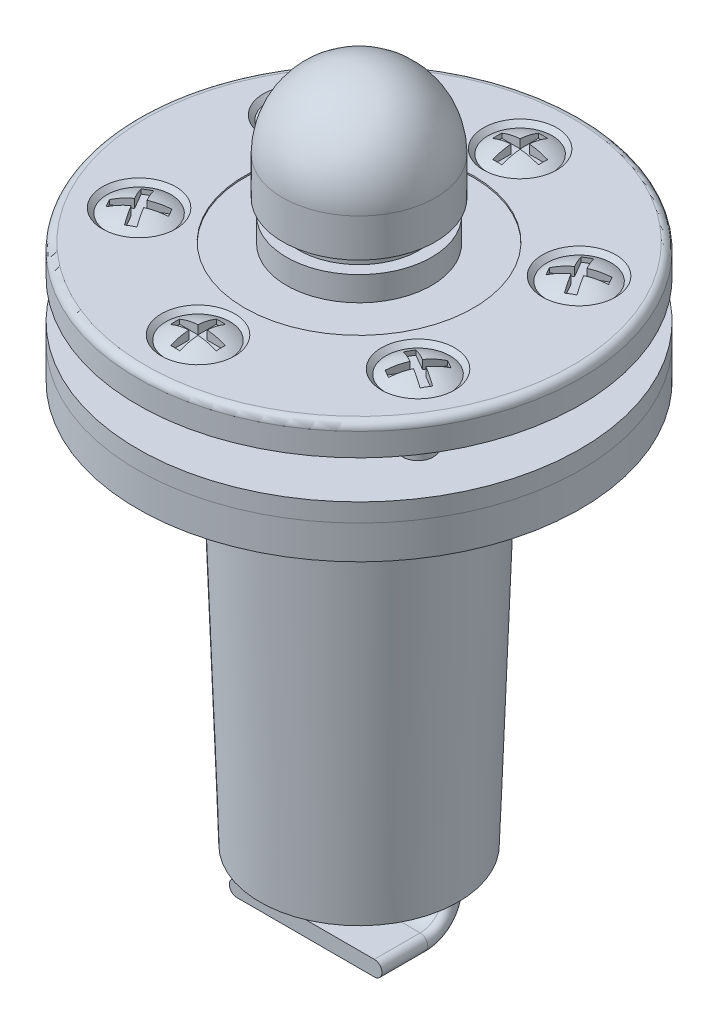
ISO-10303-21;
HEADER;
FILE_DESCRIPTION(('STEP AP214'),'2;1');
FILE_NAME('part.step','',(''),(''),'','','');
FILE_SCHEMA(('AUTOMOTIVE_DESIGN { 1 0 10303 214 1 1 1 1 }'));
ENDSEC;
DATA;
#1=APPLICATION_CONTEXT('core data for automotive mechanical design processes');
#2=APPLICATION_PROTOCOL_DEFINITION('international standard','automotive_design',2000,#1);
#3=PRODUCT_CONTEXT('',#1,'mechanical');
#4=PRODUCT('Part','Part','',(#3));
#5=PRODUCT_RELATED_PRODUCT_CATEGORY('part','',(#4));
#6=PRODUCT_DEFINITION_FORMATION('','',#4);
#7=PRODUCT_DEFINITION_CONTEXT('part definition',#1,'design');
#8=PRODUCT_DEFINITION('design','',#6,#7);
#9=PRODUCT_DEFINITION_SHAPE('','',#8);
#10=(LENGTH_UNIT() NAMED_UNIT(*) SI_UNIT(.MILLI.,.METRE.));
#11=(NAMED_UNIT(*) PLANE_ANGLE_UNIT() SI_UNIT($,.RADIAN.));
#12=(NAMED_UNIT(*) SI_UNIT($,.STERADIAN.) SOLID_ANGLE_UNIT());
#13=UNCERTAINTY_MEASURE_WITH_UNIT(LENGTH_MEASURE(1.E-05),#10,'distance_accuracy_value','');
#14=(GEOMETRIC_REPRESENTATION_CONTEXT(3) GLOBAL_UNCERTAINTY_ASSIGNED_CONTEXT((#13)) GLOBAL_UNIT_ASSIGNED_CONTEXT((#10,
#11,#12)) REPRESENTATION_CONTEXT('',''));
#15=CARTESIAN_POINT('',(0.,0.,0.));
#16=DIRECTION('',(0.,0.,1.));
#17=DIRECTION('',(1.,0.,0.));
#18=AXIS2_PLACEMENT_3D('',#15,#16,#17);
#19=CARTESIAN_POINT('',(0.,39.2,0.));
#20=DIRECTION('',(0.,-1.,0.));
#21=DIRECTION('',(-1.,0.,0.));
#22=AXIS2_PLACEMENT_3D('',#19,#20,#21);
#23=SPHERICAL_SURFACE('',#22,5.);
#24=CARTESIAN_POINT('',(0.,39.2,0.));
#25=DIRECTION('',(0.,-1.,0.));
#26=DIRECTION('',(0.,0.,-1.));
#27=AXIS2_PLACEMENT_3D('',#24,#25,#26);
#28=CIRCLE('',#27,5.);
#29=CARTESIAN_POINT('',(0.,39.2,-5.));
#30=VERTEX_POINT('',#29);
#31=EDGE_CURVE('E11',#30,#30,#28,.T.);
#32=ORIENTED_EDGE('',*,*,#31,.F.);
#33=EDGE_LOOP('',(#32));
#34=FACE_BOUND('',#33,.T.);
#35=ADVANCED_FACE('F50',(#34),#23,.T.);
#36=CARTESIAN_POINT('',(0.,25.1,0.));
#37=DIRECTION('',(0.,-1.,0.));
#38=DIRECTION('',(0.,0.,-1.));
#39=AXIS2_PLACEMENT_3D('',#36,#37,#38);
#40=CYLINDRICAL_SURFACE('',#39,5.);
#41=CARTESIAN_POINT('',(0.,36.7,0.));
#42=DIRECTION('',(0.,-1.,0.));
#43=DIRECTION('',(0.,0.,-1.));
#44=AXIS2_PLACEMENT_3D('',#41,#42,#43);
#45=CIRCLE('',#44,5.);
#46=CARTESIAN_POINT('',(0.,36.7,-5.));
#47=VERTEX_POINT('',#46);
#48=EDGE_CURVE('E56',#47,#47,#45,.T.);
#49=ORIENTED_EDGE('',*,*,#48,.F.);
#50=EDGE_LOOP('',(#49));
#51=FACE_BOUND('',#50,.T.);
#52=ORIENTED_EDGE('',*,*,#31,.T.);
#53=EDGE_LOOP('',(#52));
#54=FACE_BOUND('',#53,.T.);
#55=ADVANCED_FACE('F98',(#51,#54),#40,.T.);
#56=CARTESIAN_POINT('',(-3.95,36.7,0.));
#57=DIRECTION('',(0.,1.,0.));
#58=DIRECTION('',(0.,0.,1.));
#59=AXIS2_PLACEMENT_3D('',#56,#57,#58);
#60=PLANE('',#59);
#61=CARTESIAN_POINT('',(0.,36.7,0.));
#62=DIRECTION('',(0.,-1.,0.));
#63=DIRECTION('',(0.,0.,-1.));
#64=AXIS2_PLACEMENT_3D('',#61,#62,#63);
#65=CIRCLE('',#64,3.95);
#66=CARTESIAN_POINT('',(0.,36.7,-3.95));
#67=VERTEX_POINT('',#66);
#68=EDGE_CURVE('E60',#67,#67,#65,.T.);
#69=ORIENTED_EDGE('',*,*,#68,.F.);
#70=EDGE_LOOP('',(#69));
#71=FACE_BOUND('',#70,.T.);
#72=ORIENTED_EDGE('',*,*,#48,.T.);
#73=EDGE_LOOP('',(#72));
#74=FACE_BOUND('',#73,.T.);
#75=ADVANCED_FACE('F93',(#71,#74),#60,.F.);
#76=CARTESIAN_POINT('',(0.,25.1,0.));
#77=DIRECTION('',(0.,-1.,0.));
#78=DIRECTION('',(0.,0.,-1.));
#79=AXIS2_PLACEMENT_3D('',#76,#77,#78);
#80=CYLINDRICAL_SURFACE('',#79,3.95);
#81=CARTESIAN_POINT('',(0.,35.7,0.));
#82=DIRECTION('',(0.,-1.,0.));
#83=DIRECTION('',(0.,0.,-1.));
#84=AXIS2_PLACEMENT_3D('',#81,#82,#83);
#85=CIRCLE('',#84,3.95);
#86=CARTESIAN_POINT('',(0.,35.7,-3.95));
#87=VERTEX_POINT('',#86);
#88=EDGE_CURVE('E64',#87,#87,#85,.T.);
#89=ORIENTED_EDGE('',*,*,#88,.F.);
#90=EDGE_LOOP('',(#89));
#91=FACE_BOUND('',#90,.T.);
#92=ORIENTED_EDGE('',*,*,#68,.T.);
#93=EDGE_LOOP('',(#92));
#94=FACE_BOUND('',#93,.T.);
#95=ADVANCED_FACE('F87',(#91,#94),#80,.T.);
#96=CARTESIAN_POINT('',(-4.75,35.7,0.));
#97=DIRECTION('',(0.,-1.,0.));
#98=DIRECTION('',(0.,0.,-1.));
#99=AXIS2_PLACEMENT_3D('',#96,#97,#98);
#100=PLANE('',#99);
#101=CARTESIAN_POINT('',(0.,35.7,0.));
#102=DIRECTION('',(0.,-1.,0.));
#103=DIRECTION('',(0.,0.,-1.));
#104=AXIS2_PLACEMENT_3D('',#101,#102,#103);
#105=CIRCLE('',#104,4.75);
#106=CARTESIAN_POINT('',(0.,35.7,-4.75));
#107=VERTEX_POINT('',#106);
#108=EDGE_CURVE('E69',#107,#107,#105,.T.);
#109=ORIENTED_EDGE('',*,*,#108,.F.);
#110=EDGE_LOOP('',(#109));
#111=FACE_BOUND('',#110,.T.);
#112=ORIENTED_EDGE('',*,*,#88,.T.);
#113=EDGE_LOOP('',(#112));
#114=FACE_BOUND('',#113,.T.);
#115=ADVANCED_FACE('F81',(#111,#114),#100,.F.);
#116=CARTESIAN_POINT('',(0.,25.1,0.));
#117=DIRECTION('',(0.,-1.,0.));
#118=DIRECTION('',(0.,0.,-1.));
#119=AXIS2_PLACEMENT_3D('',#116,#117,#118);
#120=CYLINDRICAL_SURFACE('',#119,4.75);
#121=CARTESIAN_POINT('',(0.,25.1,0.));
#122=DIRECTION('',(0.,-1.,0.));
#123=DIRECTION('',(0.,0.,-1.));
#124=AXIS2_PLACEMENT_3D('',#121,#122,#123);
#125=CIRCLE('',#124,4.75);
#126=CARTESIAN_POINT('',(0.,25.1,-4.75));
#127=VERTEX_POINT('',#126);
#128=EDGE_CURVE('E72',#127,#127,#125,.T.);
#129=ORIENTED_EDGE('',*,*,#128,.F.);
#130=EDGE_LOOP('',(#129));
#131=FACE_BOUND('',#130,.T.);
#132=ORIENTED_EDGE('',*,*,#108,.T.);
#133=EDGE_LOOP('',(#132));
#134=FACE_BOUND('',#133,.T.);
#135=ADVANCED_FACE('F78',(#131,#134),#120,.T.);
#136=CARTESIAN_POINT('',(0.,25.1,0.));
#137=DIRECTION('',(0.,1.,0.));
#138=DIRECTION('',(0.,0.,1.));
#139=AXIS2_PLACEMENT_3D('',#136,#137,#138);
#140=PLANE('',#139);
#141=ORIENTED_EDGE('',*,*,#128,.T.);
#142=EDGE_LOOP('',(#141));
#143=FACE_BOUND('',#142,.T.);
#144=ADVANCED_FACE('F76',(#143),#140,.F.);
#145=CLOSED_SHELL('',(#35,#55,#75,#95,#115,#135,#144));
#146=MANIFOLD_SOLID_BREP('B2',#145);
#147=CARTESIAN_POINT('',(9.13656800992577,30.525,5.27500000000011));
#148=DIRECTION('',(0.,1.,0.));
#149=DIRECTION('',(-0.866025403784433,0.,-0.50000000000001));
#150=AXIS2_PLACEMENT_3D('',#147,#148,#149);
#151=SPHERICAL_SURFACE('',#150,3.97499999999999);
#152=CARTESIAN_POINT('',(8.87676038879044,30.525,5.1250000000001));
#153=DIRECTION('',(-0.866025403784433,0.,-0.50000000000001));
#154=DIRECTION('',(-0.50000000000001,0.,0.866025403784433));
#155=AXIS2_PLACEMENT_3D('',#152,#153,#154);
#156=CIRCLE('',#155,3.96366307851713);
#157=CARTESIAN_POINT('',(8.72676038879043,34.4772936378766,5.38480762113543));
#158=VERTEX_POINT('',#157);
#159=CARTESIAN_POINT('',(8.12676038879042,34.1938724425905,6.42403810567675));
#160=VERTEX_POINT('',#159);
#161=EDGE_CURVE('E48',#158,#160,#156,.F.);
#162=ORIENTED_EDGE('',*,*,#161,.F.);
#163=CARTESIAN_POINT('',(8.98656800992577,30.525,5.53480762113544));
#164=DIRECTION('',(-0.50000000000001,0.,0.866025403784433));
#165=DIRECTION('',(0.866025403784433,0.,0.50000000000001));
#166=AXIS2_PLACEMENT_3D('',#163,#164,#165);
#167=CIRCLE('',#166,3.96366307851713);
#168=CARTESIAN_POINT('',(7.68752990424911,34.1938724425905,4.78480762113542));
#169=VERTEX_POINT('',#168);
#170=EDGE_CURVE('E167',#169,#158,#167,.F.);
#171=ORIENTED_EDGE('',*,*,#170,.F.);
#172=CARTESIAN_POINT('',(7.83752990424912,30.525,4.52500000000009));
#173=DIRECTION('',(-0.866025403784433,0.,-0.50000000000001));
#174=DIRECTION('',(-0.50000000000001,0.,0.866025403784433));
#175=AXIS2_PLACEMENT_3D('',#172,#173,#174);
#176=CIRCLE('',#175,3.68111735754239);
#177=CARTESIAN_POINT('',(7.98752990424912,34.1938724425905,4.26519237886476));
#178=VERTEX_POINT('',#177);
#179=EDGE_CURVE('E350',#178,#169,#176,.F.);
#180=ORIENTED_EDGE('',*,*,#179,.F.);
#181=CARTESIAN_POINT('',(9.28656800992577,30.525,5.01519237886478));
#182=DIRECTION('',(0.50000000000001,0.,-0.866025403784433));
#183=DIRECTION('',(-0.866025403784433,0.,-0.50000000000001));
#184=AXIS2_PLACEMENT_3D('',#181,#182,#183);
#185=CIRCLE('',#184,3.96366307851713);
#186=CARTESIAN_POINT('',(9.02676038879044,34.4772936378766,4.86519237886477));
#187=VERTEX_POINT('',#186);
#188=EDGE_CURVE('E348',#187,#178,#185,.F.);
#189=ORIENTED_EDGE('',*,*,#188,.F.);
#190=CARTESIAN_POINT('',(8.87676038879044,30.525,5.1250000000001));
#191=DIRECTION('',(-0.866025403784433,0.,-0.50000000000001));
#192=DIRECTION('',(-0.50000000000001,0.,0.866025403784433));
#193=AXIS2_PLACEMENT_3D('',#190,#191,#192);
#194=CIRCLE('',#193,3.96366307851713);
#195=CARTESIAN_POINT('',(9.62676038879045,34.1938724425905,3.82596189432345));
#196=VERTEX_POINT('',#195);
#197=EDGE_CURVE('E346',#196,#187,#194,.F.);
#198=ORIENTED_EDGE('',*,*,#197,.F.);
#199=CARTESIAN_POINT('',(9.88656800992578,30.525,3.97596189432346));
#200=DIRECTION('',(0.500000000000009,0.,-0.866025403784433));
#201=DIRECTION('',(-0.866025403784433,0.,-0.500000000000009));
#202=AXIS2_PLACEMENT_3D('',#199,#200,#201);
#203=CIRCLE('',#202,3.68111735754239);
#204=CARTESIAN_POINT('',(10.1463756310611,34.1938724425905,4.12596189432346));
#205=VERTEX_POINT('',#204);
#206=EDGE_CURVE('E344',#205,#196,#203,.F.);
#207=ORIENTED_EDGE('',*,*,#206,.F.);
#208=CARTESIAN_POINT('',(9.39637563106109,30.525,5.42500000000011));
#209=DIRECTION('',(0.866025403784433,0.,0.50000000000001));
#210=DIRECTION('',(0.50000000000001,0.,-0.866025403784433));
#211=AXIS2_PLACEMENT_3D('',#208,#209,#210);
#212=CIRCLE('',#211,3.96366307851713);
#213=CARTESIAN_POINT('',(9.5463756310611,34.4772936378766,5.16519237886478));
#214=VERTEX_POINT('',#213);
#215=EDGE_CURVE('E342',#214,#205,#212,.F.);
#216=ORIENTED_EDGE('',*,*,#215,.F.);
#217=CARTESIAN_POINT('',(9.28656800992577,30.525,5.01519237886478));
#218=DIRECTION('',(0.50000000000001,0.,-0.866025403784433));
#219=DIRECTION('',(-0.866025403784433,0.,-0.50000000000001));
#220=AXIS2_PLACEMENT_3D('',#217,#218,#219);
#221=CIRCLE('',#220,3.96366307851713);
#222=CARTESIAN_POINT('',(10.5856061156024,34.1938724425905,5.76519237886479));
#223=VERTEX_POINT('',#222);
#224=EDGE_CURVE('E340',#223,#214,#221,.F.);
#225=ORIENTED_EDGE('',*,*,#224,.F.);
#226=CARTESIAN_POINT('',(10.4356061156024,30.525,6.02500000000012));
#227=DIRECTION('',(0.866025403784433,0.,0.50000000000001));
#228=DIRECTION('',(0.50000000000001,0.,-0.866025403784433));
#229=AXIS2_PLACEMENT_3D('',#226,#227,#228);
#230=CIRCLE('',#229,3.68111735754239);
#231=CARTESIAN_POINT('',(10.2856061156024,34.1938724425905,6.28480762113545));
#232=VERTEX_POINT('',#231);
#233=EDGE_CURVE('E338',#232,#223,#230,.F.);
#234=ORIENTED_EDGE('',*,*,#233,.F.);
#235=CARTESIAN_POINT('',(8.98656800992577,30.525,5.53480762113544));
#236=DIRECTION('',(-0.50000000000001,0.,0.866025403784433));
#237=DIRECTION('',(0.866025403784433,0.,0.50000000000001));
#238=AXIS2_PLACEMENT_3D('',#235,#236,#237);
#239=CIRCLE('',#238,3.96366307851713);
#240=CARTESIAN_POINT('',(9.24637563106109,34.4772936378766,5.68480762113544));
#241=VERTEX_POINT('',#240);
#242=EDGE_CURVE('E336',#241,#232,#239,.F.);
#243=ORIENTED_EDGE('',*,*,#242,.F.);
#244=CARTESIAN_POINT('',(9.39637563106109,30.525,5.42500000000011));
#245=DIRECTION('',(0.866025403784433,0.,0.50000000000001));
#246=DIRECTION('',(0.50000000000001,0.,-0.866025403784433));
#247=AXIS2_PLACEMENT_3D('',#244,#245,#246);
#248=CIRCLE('',#247,3.96366307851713);
#249=CARTESIAN_POINT('',(8.64637563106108,34.1938724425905,6.72403810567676));
#250=VERTEX_POINT('',#249);
#251=EDGE_CURVE('E334',#250,#241,#248,.F.);
#252=ORIENTED_EDGE('',*,*,#251,.F.);
#253=CARTESIAN_POINT('',(8.38656800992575,30.525,6.57403810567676));
#254=DIRECTION('',(-0.50000000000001,0.,0.866025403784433));
#255=DIRECTION('',(0.866025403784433,0.,0.50000000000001));
#256=AXIS2_PLACEMENT_3D('',#253,#254,#255);
#257=CIRCLE('',#256,3.68111735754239);
#258=EDGE_CURVE('E332',#160,#250,#257,.F.);
#259=ORIENTED_EDGE('',*,*,#258,.F.);
#260=EDGE_LOOP('',(#162,#171,#180,#189,#198,#207,#216,#225,#234,#243,#252,#259));
#261=FACE_BOUND('',#260,.T.);
#262=CARTESIAN_POINT('',(9.13656800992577,33.9,5.27500000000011));
#263=DIRECTION('',(0.,1.,0.));
#264=DIRECTION('',(0.866025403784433,0.,0.50000000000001));
#265=AXIS2_PLACEMENT_3D('',#262,#263,#264);
#266=CIRCLE('',#265,2.1);
#267=CARTESIAN_POINT('',(10.9552213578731,33.9,6.32500000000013));
#268=VERTEX_POINT('',#267);
#269=EDGE_CURVE('E296',#268,#268,#266,.T.);
#270=ORIENTED_EDGE('',*,*,#269,.T.);
#271=EDGE_LOOP('',(#270));
#272=FACE_BOUND('',#271,.T.);
#273=ADVANCED_FACE('F160',(#261,#272),#151,.T.);
#274=CARTESIAN_POINT('',(9.13656800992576,24.4,5.27500000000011));
#275=DIRECTION('',(0.,-1.,0.));
#276=DIRECTION('',(-0.866025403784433,0.,-0.50000000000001));
#277=AXIS2_PLACEMENT_3D('',#274,#275,#276);
#278=PLANE('',#277);
#279=CARTESIAN_POINT('',(9.13656800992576,24.4,5.27500000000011));
#280=DIRECTION('',(0.,1.,0.));
#281=DIRECTION('',(0.866025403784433,0.,0.50000000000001));
#282=AXIS2_PLACEMENT_3D('',#279,#280,#281);
#283=CIRCLE('',#282,1.);
#284=CARTESIAN_POINT('',(10.0025934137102,24.4,5.77500000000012));
#285=VERTEX_POINT('',#284);
#286=EDGE_CURVE('E329',#285,#285,#283,.T.);
#287=ORIENTED_EDGE('',*,*,#286,.F.);
#288=EDGE_LOOP('',(#287));
#289=FACE_BOUND('',#288,.T.);
#290=ADVANCED_FACE('F398',(#289),#278,.T.);
#291=CARTESIAN_POINT('',(9.13656800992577,32.95,5.27500000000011));
#292=DIRECTION('',(0.,1.,0.));
#293=DIRECTION('',(0.866025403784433,0.,0.50000000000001));
#294=AXIS2_PLACEMENT_3D('',#291,#292,#293);
#295=CYLINDRICAL_SURFACE('',#294,1.);
#296=ORIENTED_EDGE('',*,*,#286,.T.);
#297=EDGE_LOOP('',(#296));
#298=FACE_BOUND('',#297,.T.);
#299=CARTESIAN_POINT('',(9.13656800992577,32.8,5.27500000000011));
#300=DIRECTION('',(0.,1.,0.));
#301=DIRECTION('',(0.866025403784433,0.,0.50000000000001));
#302=AXIS2_PLACEMENT_3D('',#299,#300,#301);
#303=CIRCLE('',#302,0.999999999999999);
#304=CARTESIAN_POINT('',(10.0025934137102,32.8,5.77500000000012));
#305=VERTEX_POINT('',#304);
#306=EDGE_CURVE('E326',#305,#305,#303,.T.);
#307=ORIENTED_EDGE('',*,*,#306,.F.);
#308=EDGE_LOOP('',(#307));
#309=FACE_BOUND('',#308,.T.);
#310=ADVANCED_FACE('F402',(#298,#309),#295,.T.);
#311=CARTESIAN_POINT('',(9.13656800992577,33.9,5.27500000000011));
#312=DIRECTION('',(0.,1.,0.));
#313=DIRECTION('',(0.866025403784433,0.,0.50000000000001));
#314=AXIS2_PLACEMENT_3D('',#311,#312,#313);
#315=CONICAL_SURFACE('',#314,2.1,0.785398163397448);
#316=ORIENTED_EDGE('',*,*,#306,.T.);
#317=EDGE_LOOP('',(#316));
#318=FACE_BOUND('',#317,.T.);
#319=ORIENTED_EDGE('',*,*,#269,.F.);
#320=EDGE_LOOP('',(#319));
#321=FACE_BOUND('',#320,.T.);
#322=ADVANCED_FACE('F407',(#318,#321),#315,.T.);
#323=CARTESIAN_POINT('',(8.12676038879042,33.9,6.42403810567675));
#324=DIRECTION('',(-0.866025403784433,0.,-0.50000000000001));
#325=DIRECTION('',(-0.50000000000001,0.,0.866025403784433));
#326=AXIS2_PLACEMENT_3D('',#323,#324,#325);
#327=PLANE('',#326);
#328=ORIENTED_EDGE('',*,*,#161,.T.);
#329=DIRECTION('',(0.,1.,0.));
#330=VECTOR('',#329,1.);
#331=CARTESIAN_POINT('',(8.12676038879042,33.9,6.42403810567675));
#332=LINE('',#331,#330);
#333=CARTESIAN_POINT('',(8.12676038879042,33.9,6.42403810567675));
#334=VERTEX_POINT('',#333);
#335=EDGE_CURVE('E174',#334,#160,#332,.T.);
#336=ORIENTED_EDGE('',*,*,#335,.F.);
#337=DIRECTION('',(-0.50000000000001,0.,0.866025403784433));
#338=VECTOR('',#337,1.);
#339=CARTESIAN_POINT('',(8.12676038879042,33.9,6.42403810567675));
#340=LINE('',#339,#338);
#341=CARTESIAN_POINT('',(8.72676038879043,33.9,5.38480762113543));
#342=VERTEX_POINT('',#341);
#343=EDGE_CURVE('E248',#342,#334,#340,.T.);
#344=ORIENTED_EDGE('',*,*,#343,.F.);
#345=DIRECTION('',(0.,1.,0.));
#346=VECTOR('',#345,1.);
#347=CARTESIAN_POINT('',(8.72676038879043,33.9,5.38480762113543));
#348=LINE('',#347,#346);
#349=EDGE_CURVE('E294',#342,#158,#348,.T.);
#350=ORIENTED_EDGE('',*,*,#349,.T.);
#351=EDGE_LOOP('',(#328,#336,#344,#350));
#352=FACE_BOUND('',#351,.T.);
#353=ADVANCED_FACE('F246',(#352),#327,.F.);
#354=CARTESIAN_POINT('',(8.72676038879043,33.9,5.38480762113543));
#355=DIRECTION('',(-0.50000000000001,0.,0.866025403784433));
#356=DIRECTION('',(0.866025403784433,0.,0.50000000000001));
#357=AXIS2_PLACEMENT_3D('',#354,#355,#356);
#358=PLANE('',#357);
#359=ORIENTED_EDGE('',*,*,#170,.T.);
#360=ORIENTED_EDGE('',*,*,#349,.F.);
#361=DIRECTION('',(0.866025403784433,0.,0.50000000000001));
#362=VECTOR('',#361,1.);
#363=CARTESIAN_POINT('',(8.72676038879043,33.9,5.38480762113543));
#364=LINE('',#363,#362);
#365=CARTESIAN_POINT('',(7.68752990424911,33.9,4.78480762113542));
#366=VERTEX_POINT('',#365);
#367=EDGE_CURVE('E253',#366,#342,#364,.T.);
#368=ORIENTED_EDGE('',*,*,#367,.F.);
#369=DIRECTION('',(0.,1.,0.));
#370=VECTOR('',#369,1.);
#371=CARTESIAN_POINT('',(7.68752990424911,33.9,4.78480762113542));
#372=LINE('',#371,#370);
#373=EDGE_CURVE('E297',#366,#169,#372,.T.);
#374=ORIENTED_EDGE('',*,*,#373,.T.);
#375=EDGE_LOOP('',(#359,#360,#368,#374));
#376=FACE_BOUND('',#375,.T.);
#377=ADVANCED_FACE('F357',(#376),#358,.F.);
#378=CARTESIAN_POINT('',(7.68752990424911,33.9,4.78480762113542));
#379=DIRECTION('',(-0.866025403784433,0.,-0.50000000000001));
#380=DIRECTION('',(-0.50000000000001,0.,0.866025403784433));
#381=AXIS2_PLACEMENT_3D('',#378,#379,#380);
#382=PLANE('',#381);
#383=ORIENTED_EDGE('',*,*,#179,.T.);
#384=ORIENTED_EDGE('',*,*,#373,.F.);
#385=DIRECTION('',(-0.50000000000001,0.,0.866025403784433));
#386=VECTOR('',#385,1.);
#387=CARTESIAN_POINT('',(7.68752990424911,33.9,4.78480762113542));
#388=LINE('',#387,#386);
#389=CARTESIAN_POINT('',(7.98752990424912,33.9,4.26519237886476));
#390=VERTEX_POINT('',#389);
#391=EDGE_CURVE('E291',#390,#366,#388,.T.);
#392=ORIENTED_EDGE('',*,*,#391,.F.);
#393=DIRECTION('',(0.,1.,0.));
#394=VECTOR('',#393,1.);
#395=CARTESIAN_POINT('',(7.98752990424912,33.9,4.26519237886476));
#396=LINE('',#395,#394);
#397=EDGE_CURVE('E299',#390,#178,#396,.T.);
#398=ORIENTED_EDGE('',*,*,#397,.T.);
#399=EDGE_LOOP('',(#383,#384,#392,#398));
#400=FACE_BOUND('',#399,.T.);
#401=ADVANCED_FACE('F353',(#400),#382,.F.);
#402=CARTESIAN_POINT('',(7.98752990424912,33.9,4.26519237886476));
#403=DIRECTION('',(0.50000000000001,0.,-0.866025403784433));
#404=DIRECTION('',(-0.866025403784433,0.,-0.50000000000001));
#405=AXIS2_PLACEMENT_3D('',#402,#403,#404);
#406=PLANE('',#405);
#407=ORIENTED_EDGE('',*,*,#188,.T.);
#408=ORIENTED_EDGE('',*,*,#397,.F.);
#409=DIRECTION('',(-0.866025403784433,0.,-0.50000000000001));
#410=VECTOR('',#409,1.);
#411=CARTESIAN_POINT('',(7.98752990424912,33.9,4.26519237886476));
#412=LINE('',#411,#410);
#413=CARTESIAN_POINT('',(9.02676038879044,33.9,4.86519237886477));
#414=VERTEX_POINT('',#413);
#415=EDGE_CURVE('E288',#414,#390,#412,.T.);
#416=ORIENTED_EDGE('',*,*,#415,.F.);
#417=DIRECTION('',(0.,1.,0.));
#418=VECTOR('',#417,1.);
#419=CARTESIAN_POINT('',(9.02676038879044,33.9,4.86519237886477));
#420=LINE('',#419,#418);
#421=EDGE_CURVE('E302',#414,#187,#420,.T.);
#422=ORIENTED_EDGE('',*,*,#421,.T.);
#423=EDGE_LOOP('',(#407,#408,#416,#422));
#424=FACE_BOUND('',#423,.T.);
#425=ADVANCED_FACE('F388',(#424),#406,.F.);
#426=CARTESIAN_POINT('',(9.02676038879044,33.9,4.86519237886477));
#427=DIRECTION('',(-0.866025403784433,0.,-0.50000000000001));
#428=DIRECTION('',(-0.50000000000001,0.,0.866025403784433));
#429=AXIS2_PLACEMENT_3D('',#426,#427,#428);
#430=PLANE('',#429);
#431=ORIENTED_EDGE('',*,*,#197,.T.);
#432=ORIENTED_EDGE('',*,*,#421,.F.);
#433=DIRECTION('',(-0.50000000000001,0.,0.866025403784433));
#434=VECTOR('',#433,1.);
#435=CARTESIAN_POINT('',(9.02676038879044,33.9,4.86519237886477));
#436=LINE('',#435,#434);
#437=CARTESIAN_POINT('',(9.62676038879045,33.9,3.82596189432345));
#438=VERTEX_POINT('',#437);
#439=EDGE_CURVE('E285',#438,#414,#436,.T.);
#440=ORIENTED_EDGE('',*,*,#439,.F.);
#441=DIRECTION('',(0.,1.,0.));
#442=VECTOR('',#441,1.);
#443=CARTESIAN_POINT('',(9.62676038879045,33.9,3.82596189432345));
#444=LINE('',#443,#442);
#445=EDGE_CURVE('E305',#438,#196,#444,.T.);
#446=ORIENTED_EDGE('',*,*,#445,.T.);
#447=EDGE_LOOP('',(#431,#432,#440,#446));
#448=FACE_BOUND('',#447,.T.);
#449=ADVANCED_FACE('F385',(#448),#430,.F.);
#450=CARTESIAN_POINT('',(9.62676038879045,33.9,3.82596189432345));
#451=DIRECTION('',(0.500000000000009,0.,-0.866025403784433));
#452=DIRECTION('',(-0.866025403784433,0.,-0.500000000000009));
#453=AXIS2_PLACEMENT_3D('',#450,#451,#452);
#454=PLANE('',#453);
#455=ORIENTED_EDGE('',*,*,#206,.T.);
#456=ORIENTED_EDGE('',*,*,#445,.F.);
#457=DIRECTION('',(-0.866025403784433,0.,-0.500000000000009));
#458=VECTOR('',#457,1.);
#459=CARTESIAN_POINT('',(9.62676038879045,33.9,3.82596189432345));
#460=LINE('',#459,#458);
#461=CARTESIAN_POINT('',(10.1463756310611,33.9,4.12596189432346));
#462=VERTEX_POINT('',#461);
#463=EDGE_CURVE('E282',#462,#438,#460,.T.);
#464=ORIENTED_EDGE('',*,*,#463,.F.);
#465=DIRECTION('',(0.,1.,0.));
#466=VECTOR('',#465,1.);
#467=CARTESIAN_POINT('',(10.1463756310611,33.9,4.12596189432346));
#468=LINE('',#467,#466);
#469=EDGE_CURVE('E308',#462,#205,#468,.T.);
#470=ORIENTED_EDGE('',*,*,#469,.T.);
#471=EDGE_LOOP('',(#455,#456,#464,#470));
#472=FACE_BOUND('',#471,.T.);
#473=ADVANCED_FACE('F381',(#472),#454,.F.);
#474=CARTESIAN_POINT('',(10.1463756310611,33.9,4.12596189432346));
#475=DIRECTION('',(0.866025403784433,0.,0.50000000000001));
#476=DIRECTION('',(0.50000000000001,0.,-0.866025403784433));
#477=AXIS2_PLACEMENT_3D('',#474,#475,#476);
#478=PLANE('',#477);
#479=ORIENTED_EDGE('',*,*,#215,.T.);
#480=ORIENTED_EDGE('',*,*,#469,.F.);
#481=DIRECTION('',(0.50000000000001,0.,-0.866025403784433));
#482=VECTOR('',#481,1.);
#483=CARTESIAN_POINT('',(10.1463756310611,33.9,4.12596189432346));
#484=LINE('',#483,#482);
#485=CARTESIAN_POINT('',(9.5463756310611,33.9,5.16519237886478));
#486=VERTEX_POINT('',#485);
#487=EDGE_CURVE('E279',#486,#462,#484,.T.);
#488=ORIENTED_EDGE('',*,*,#487,.F.);
#489=DIRECTION('',(0.,1.,0.));
#490=VECTOR('',#489,1.);
#491=CARTESIAN_POINT('',(9.5463756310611,33.9,5.16519237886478));
#492=LINE('',#491,#490);
#493=EDGE_CURVE('E311',#486,#214,#492,.T.);
#494=ORIENTED_EDGE('',*,*,#493,.T.);
#495=EDGE_LOOP('',(#479,#480,#488,#494));
#496=FACE_BOUND('',#495,.T.);
#497=ADVANCED_FACE('F377',(#496),#478,.F.);
#498=CARTESIAN_POINT('',(9.5463756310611,33.9,5.16519237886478));
#499=DIRECTION('',(0.50000000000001,0.,-0.866025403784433));
#500=DIRECTION('',(-0.866025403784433,0.,-0.50000000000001));
#501=AXIS2_PLACEMENT_3D('',#498,#499,#500);
#502=PLANE('',#501);
#503=ORIENTED_EDGE('',*,*,#224,.T.);
#504=ORIENTED_EDGE('',*,*,#493,.F.);
#505=DIRECTION('',(-0.866025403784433,0.,-0.50000000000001));
#506=VECTOR('',#505,1.);
#507=CARTESIAN_POINT('',(9.5463756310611,33.9,5.16519237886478));
#508=LINE('',#507,#506);
#509=CARTESIAN_POINT('',(10.5856061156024,33.9,5.76519237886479));
#510=VERTEX_POINT('',#509);
#511=EDGE_CURVE('E276',#510,#486,#508,.T.);
#512=ORIENTED_EDGE('',*,*,#511,.F.);
#513=DIRECTION('',(0.,1.,0.));
#514=VECTOR('',#513,1.);
#515=CARTESIAN_POINT('',(10.5856061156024,33.9,5.76519237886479));
#516=LINE('',#515,#514);
#517=EDGE_CURVE('E314',#510,#223,#516,.T.);
#518=ORIENTED_EDGE('',*,*,#517,.T.);
#519=EDGE_LOOP('',(#503,#504,#512,#518));
#520=FACE_BOUND('',#519,.T.);
#521=ADVANCED_FACE('F373',(#520),#502,.F.);
#522=CARTESIAN_POINT('',(10.5856061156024,33.9,5.76519237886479));
#523=DIRECTION('',(0.866025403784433,0.,0.50000000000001));
#524=DIRECTION('',(0.50000000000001,0.,-0.866025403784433));
#525=AXIS2_PLACEMENT_3D('',#522,#523,#524);
#526=PLANE('',#525);
#527=ORIENTED_EDGE('',*,*,#233,.T.);
#528=ORIENTED_EDGE('',*,*,#517,.F.);
#529=DIRECTION('',(0.50000000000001,0.,-0.866025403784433));
#530=VECTOR('',#529,1.);
#531=CARTESIAN_POINT('',(10.5856061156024,33.9,5.76519237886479));
#532=LINE('',#531,#530);
#533=CARTESIAN_POINT('',(10.2856061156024,33.9,6.28480762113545));
#534=VERTEX_POINT('',#533);
#535=EDGE_CURVE('E273',#534,#510,#532,.T.);
#536=ORIENTED_EDGE('',*,*,#535,.F.);
#537=DIRECTION('',(0.,1.,0.));
#538=VECTOR('',#537,1.);
#539=CARTESIAN_POINT('',(10.2856061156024,33.9,6.28480762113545));
#540=LINE('',#539,#538);
#541=EDGE_CURVE('E317',#534,#232,#540,.T.);
#542=ORIENTED_EDGE('',*,*,#541,.T.);
#543=EDGE_LOOP('',(#527,#528,#536,#542));
#544=FACE_BOUND('',#543,.T.);
#545=ADVANCED_FACE('F369',(#544),#526,.F.);
#546=CARTESIAN_POINT('',(10.2856061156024,33.9,6.28480762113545));
#547=DIRECTION('',(-0.50000000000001,0.,0.866025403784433));
#548=DIRECTION('',(0.866025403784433,0.,0.50000000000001));
#549=AXIS2_PLACEMENT_3D('',#546,#547,#548);
#550=PLANE('',#549);
#551=ORIENTED_EDGE('',*,*,#242,.T.);
#552=ORIENTED_EDGE('',*,*,#541,.F.);
#553=DIRECTION('',(0.866025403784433,0.,0.50000000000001));
#554=VECTOR('',#553,1.);
#555=CARTESIAN_POINT('',(10.2856061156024,33.9,6.28480762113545));
#556=LINE('',#555,#554);
#557=CARTESIAN_POINT('',(9.24637563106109,33.9,5.68480762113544));
#558=VERTEX_POINT('',#557);
#559=EDGE_CURVE('E270',#558,#534,#556,.T.);
#560=ORIENTED_EDGE('',*,*,#559,.F.);
#561=DIRECTION('',(0.,1.,0.));
#562=VECTOR('',#561,1.);
#563=CARTESIAN_POINT('',(9.24637563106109,33.9,5.68480762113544));
#564=LINE('',#563,#562);
#565=EDGE_CURVE('E320',#558,#241,#564,.T.);
#566=ORIENTED_EDGE('',*,*,#565,.T.);
#567=EDGE_LOOP('',(#551,#552,#560,#566));
#568=FACE_BOUND('',#567,.T.);
#569=ADVANCED_FACE('F366',(#568),#550,.F.);
#570=CARTESIAN_POINT('',(9.24637563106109,33.9,5.68480762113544));
#571=DIRECTION('',(0.866025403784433,0.,0.50000000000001));
#572=DIRECTION('',(0.50000000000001,0.,-0.866025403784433));
#573=AXIS2_PLACEMENT_3D('',#570,#571,#572);
#574=PLANE('',#573);
#575=ORIENTED_EDGE('',*,*,#251,.T.);
#576=ORIENTED_EDGE('',*,*,#565,.F.);
#577=DIRECTION('',(0.50000000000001,0.,-0.866025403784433));
#578=VECTOR('',#577,1.);
#579=CARTESIAN_POINT('',(9.24637563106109,33.9,5.68480762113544));
#580=LINE('',#579,#578);
#581=CARTESIAN_POINT('',(8.64637563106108,33.9,6.72403810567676));
#582=VERTEX_POINT('',#581);
#583=EDGE_CURVE('E262',#582,#558,#580,.T.);
#584=ORIENTED_EDGE('',*,*,#583,.F.);
#585=DIRECTION('',(0.,1.,0.));
#586=VECTOR('',#585,1.);
#587=CARTESIAN_POINT('',(8.64637563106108,33.9,6.72403810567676));
#588=LINE('',#587,#586);
#589=EDGE_CURVE('E252',#582,#250,#588,.T.);
#590=ORIENTED_EDGE('',*,*,#589,.T.);
#591=EDGE_LOOP('',(#575,#576,#584,#590));
#592=FACE_BOUND('',#591,.T.);
#593=ADVANCED_FACE('F362',(#592),#574,.F.);
#594=CARTESIAN_POINT('',(8.64637563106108,33.9,6.72403810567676));
#595=DIRECTION('',(-0.50000000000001,0.,0.866025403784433));
#596=DIRECTION('',(0.866025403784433,0.,0.50000000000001));
#597=AXIS2_PLACEMENT_3D('',#594,#595,#596);
#598=PLANE('',#597);
#599=ORIENTED_EDGE('',*,*,#258,.T.);
#600=ORIENTED_EDGE('',*,*,#589,.F.);
#601=DIRECTION('',(0.866025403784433,0.,0.50000000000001));
#602=VECTOR('',#601,1.);
#603=CARTESIAN_POINT('',(8.64637563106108,33.9,6.72403810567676));
#604=LINE('',#603,#602);
#605=EDGE_CURVE('E256',#334,#582,#604,.T.);
#606=ORIENTED_EDGE('',*,*,#605,.F.);
#607=ORIENTED_EDGE('',*,*,#335,.T.);
#608=EDGE_LOOP('',(#599,#600,#606,#607));
#609=FACE_BOUND('',#608,.T.);
#610=ADVANCED_FACE('F257',(#609),#598,.F.);
#611=CARTESIAN_POINT('',(0.,33.9,0.));
#612=DIRECTION('',(0.,1.,0.));
#613=DIRECTION('',(0.866025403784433,0.,0.50000000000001));
#614=AXIS2_PLACEMENT_3D('',#611,#612,#613);
#615=PLANE('',#614);
#616=ORIENTED_EDGE('',*,*,#343,.T.);
#617=ORIENTED_EDGE('',*,*,#605,.T.);
#618=ORIENTED_EDGE('',*,*,#583,.T.);
#619=ORIENTED_EDGE('',*,*,#559,.T.);
#620=ORIENTED_EDGE('',*,*,#535,.T.);
#621=ORIENTED_EDGE('',*,*,#511,.T.);
#622=ORIENTED_EDGE('',*,*,#487,.T.);
#623=ORIENTED_EDGE('',*,*,#463,.T.);
#624=ORIENTED_EDGE('',*,*,#439,.T.);
#625=ORIENTED_EDGE('',*,*,#415,.T.);
#626=ORIENTED_EDGE('',*,*,#391,.T.);
#627=ORIENTED_EDGE('',*,*,#367,.T.);
#628=EDGE_LOOP('',(#616,#617,#618,#619,#620,#621,#622,#623,#624,#625,#626,#627));
#629=FACE_BOUND('',#628,.T.);
#630=ADVANCED_FACE('F264',(#629),#615,.T.);
#631=CLOSED_SHELL('',(#273,#290,#310,#322,#353,#377,#401,#425,#449,#473,#497,#521,#545,#569,
#593,#610,#630));
#632=MANIFOLD_SOLID_BREP('B6',#631);
#633=CARTESIAN_POINT('',(9.13656800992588,30.525,-5.27499999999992));
#634=DIRECTION('',(0.,1.,0.));
#635=DIRECTION('',(-0.866025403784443,0.,0.499999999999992));
#636=AXIS2_PLACEMENT_3D('',#633,#634,#635);
#637=SPHERICAL_SURFACE('',#636,3.97499999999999);
#638=CARTESIAN_POINT('',(8.87676038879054,30.525,-5.12499999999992));
#639=DIRECTION('',(-0.866025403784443,0.,0.499999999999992));
#640=DIRECTION('',(0.499999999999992,0.,0.866025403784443));
#641=AXIS2_PLACEMENT_3D('',#638,#639,#640);
#642=CIRCLE('',#641,3.96366307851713);
#643=CARTESIAN_POINT('',(9.02676038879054,34.4772936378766,-4.86519237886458));
#644=VERTEX_POINT('',#643);
#645=CARTESIAN_POINT('',(9.62676038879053,34.1938724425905,-3.82596189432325));
#646=VERTEX_POINT('',#645);
#647=EDGE_CURVE('E158',#644,#646,#642,.F.);
#648=ORIENTED_EDGE('',*,*,#647,.F.);
#649=CARTESIAN_POINT('',(9.28656800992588,30.525,-5.01519237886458));
#650=DIRECTION('',(0.499999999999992,0.,0.866025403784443));
#651=DIRECTION('',(0.866025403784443,0.,-0.499999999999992));
#652=AXIS2_PLACEMENT_3D('',#649,#650,#651);
#653=CIRCLE('',#652,3.96366307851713);
#654=CARTESIAN_POINT('',(7.98752990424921,34.1938724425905,-4.26519237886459));
#655=VERTEX_POINT('',#654);
#656=EDGE_CURVE('E587',#655,#644,#653,.F.);
#657=ORIENTED_EDGE('',*,*,#656,.F.);
#658=CARTESIAN_POINT('',(7.83752990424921,30.525,-4.52499999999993));
#659=DIRECTION('',(-0.866025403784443,0.,0.499999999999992));
#660=DIRECTION('',(0.499999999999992,0.,0.866025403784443));
#661=AXIS2_PLACEMENT_3D('',#658,#659,#660);
#662=CIRCLE('',#661,3.68111735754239);
#663=CARTESIAN_POINT('',(7.68752990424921,34.1938724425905,-4.78480762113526));
#664=VERTEX_POINT('',#663);
#665=EDGE_CURVE('E770',#664,#655,#662,.F.);
#666=ORIENTED_EDGE('',*,*,#665,.F.);
#667=CARTESIAN_POINT('',(8.98656800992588,30.525,-5.53480762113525));
#668=DIRECTION('',(-0.499999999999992,0.,-0.866025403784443));
#669=DIRECTION('',(-0.866025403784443,0.,0.499999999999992));
#670=AXIS2_PLACEMENT_3D('',#667,#668,#669);
#671=CIRCLE('',#670,3.96366307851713);
#672=CARTESIAN_POINT('',(8.72676038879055,34.4772936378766,-5.38480762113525));
#673=VERTEX_POINT('',#672);
#674=EDGE_CURVE('E768',#673,#664,#671,.F.);
#675=ORIENTED_EDGE('',*,*,#674,.F.);
#676=CARTESIAN_POINT('',(8.87676038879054,30.525,-5.12499999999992));
#677=DIRECTION('',(-0.866025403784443,0.,0.499999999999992));
#678=DIRECTION('',(0.499999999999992,0.,0.866025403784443));
#679=AXIS2_PLACEMENT_3D('',#676,#677,#678);
#680=CIRCLE('',#679,3.96366307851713);
#681=CARTESIAN_POINT('',(8.12676038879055,34.1938724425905,-6.42403810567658));
#682=VERTEX_POINT('',#681);
#683=EDGE_CURVE('E766',#682,#673,#680,.F.);
#684=ORIENTED_EDGE('',*,*,#683,.F.);
#685=CARTESIAN_POINT('',(8.38656800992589,30.525,-6.57403810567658));
#686=DIRECTION('',(-0.499999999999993,0.,-0.866025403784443));
#687=DIRECTION('',(-0.866025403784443,0.,0.499999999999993));
#688=AXIS2_PLACEMENT_3D('',#685,#686,#687);
#689=CIRCLE('',#688,3.68111735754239);
#690=CARTESIAN_POINT('',(8.64637563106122,34.1938724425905,-6.72403810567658));
#691=VERTEX_POINT('',#690);
#692=EDGE_CURVE('E764',#691,#682,#689,.F.);
#693=ORIENTED_EDGE('',*,*,#692,.F.);
#694=CARTESIAN_POINT('',(9.39637563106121,30.525,-5.42499999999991));
#695=DIRECTION('',(0.866025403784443,0.,-0.499999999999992));
#696=DIRECTION('',(-0.499999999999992,0.,-0.866025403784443));
#697=AXIS2_PLACEMENT_3D('',#694,#695,#696);
#698=CIRCLE('',#697,3.96366307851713);
#699=CARTESIAN_POINT('',(9.24637563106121,34.4772936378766,-5.68480762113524));
#700=VERTEX_POINT('',#699);
#701=EDGE_CURVE('E762',#700,#691,#698,.F.);
#702=ORIENTED_EDGE('',*,*,#701,.F.);
#703=CARTESIAN_POINT('',(8.98656800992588,30.525,-5.53480762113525));
#704=DIRECTION('',(-0.499999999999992,0.,-0.866025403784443));
#705=DIRECTION('',(-0.866025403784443,0.,0.499999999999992));
#706=AXIS2_PLACEMENT_3D('',#703,#704,#705);
#707=CIRCLE('',#706,3.96366307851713);
#708=CARTESIAN_POINT('',(10.2856061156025,34.1938724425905,-6.28480762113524));
#709=VERTEX_POINT('',#708);
#710=EDGE_CURVE('E760',#709,#700,#707,.F.);
#711=ORIENTED_EDGE('',*,*,#710,.F.);
#712=CARTESIAN_POINT('',(10.4356061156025,30.525,-6.0249999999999));
#713=DIRECTION('',(0.866025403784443,0.,-0.499999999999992));
#714=DIRECTION('',(-0.499999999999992,0.,-0.866025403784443));
#715=AXIS2_PLACEMENT_3D('',#712,#713,#714);
#716=CIRCLE('',#715,3.68111735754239);
#717=CARTESIAN_POINT('',(10.5856061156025,34.1938724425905,-5.76519237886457));
#718=VERTEX_POINT('',#717);
#719=EDGE_CURVE('E758',#718,#709,#716,.F.);
#720=ORIENTED_EDGE('',*,*,#719,.F.);
#721=CARTESIAN_POINT('',(9.28656800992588,30.525,-5.01519237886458));
#722=DIRECTION('',(0.499999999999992,0.,0.866025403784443));
#723=DIRECTION('',(0.866025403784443,0.,-0.499999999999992));
#724=AXIS2_PLACEMENT_3D('',#721,#722,#723);
#725=CIRCLE('',#724,3.96366307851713);
#726=CARTESIAN_POINT('',(9.54637563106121,34.4772936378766,-5.16519237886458));
#727=VERTEX_POINT('',#726);
#728=EDGE_CURVE('E756',#727,#718,#725,.F.);
#729=ORIENTED_EDGE('',*,*,#728,.F.);
#730=CARTESIAN_POINT('',(9.39637563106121,30.525,-5.42499999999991));
#731=DIRECTION('',(0.866025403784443,0.,-0.499999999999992));
#732=DIRECTION('',(-0.499999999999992,0.,-0.866025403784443));
#733=AXIS2_PLACEMENT_3D('',#730,#731,#732);
#734=CIRCLE('',#733,3.96366307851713);
#735=CARTESIAN_POINT('',(10.1463756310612,34.1938724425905,-4.12596189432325));
#736=VERTEX_POINT('',#735);
#737=EDGE_CURVE('E754',#736,#727,#734,.F.);
#738=ORIENTED_EDGE('',*,*,#737,.F.);
#739=CARTESIAN_POINT('',(9.88656800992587,30.525,-3.97596189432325));
#740=DIRECTION('',(0.499999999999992,0.,0.866025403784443));
#741=DIRECTION('',(0.866025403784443,0.,-0.499999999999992));
#742=AXIS2_PLACEMENT_3D('',#739,#740,#741);
#743=CIRCLE('',#742,3.68111735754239);
#744=EDGE_CURVE('E752',#646,#736,#743,.F.);
#745=ORIENTED_EDGE('',*,*,#744,.F.);
#746=EDGE_LOOP('',(#648,#657,#666,#675,#684,#693,#702,#711,#720,#729,#738,#745));
#747=FACE_BOUND('',#746,.T.);
#748=CARTESIAN_POINT('',(9.13656800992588,33.9,-5.27499999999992));
#749=DIRECTION('',(0.,1.,0.));
#750=DIRECTION('',(0.866025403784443,0.,-0.499999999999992));
#751=AXIS2_PLACEMENT_3D('',#748,#749,#750);
#752=CIRCLE('',#751,2.1);
#753=CARTESIAN_POINT('',(10.9552213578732,33.9,-6.3249999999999));
#754=VERTEX_POINT('',#753);
#755=EDGE_CURVE('E716',#754,#754,#752,.T.);
#756=ORIENTED_EDGE('',*,*,#755,.T.);
#757=EDGE_LOOP('',(#756));
#758=FACE_BOUND('',#757,.T.);
#759=ADVANCED_FACE('F580',(#747,#758),#637,.T.);
#760=CARTESIAN_POINT('',(9.13656800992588,24.4,-5.27499999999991));
#761=DIRECTION('',(0.,-1.,0.));
#762=DIRECTION('',(-0.866025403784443,0.,0.499999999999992));
#763=AXIS2_PLACEMENT_3D('',#760,#761,#762);
#764=PLANE('',#763);
#765=CARTESIAN_POINT('',(9.13656800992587,24.4,-5.27499999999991));
#766=DIRECTION('',(0.,1.,0.));
#767=DIRECTION('',(0.866025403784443,0.,-0.499999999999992));
#768=AXIS2_PLACEMENT_3D('',#765,#766,#767);
#769=CIRCLE('',#768,1.);
#770=CARTESIAN_POINT('',(10.0025934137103,24.4,-5.77499999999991));
#771=VERTEX_POINT('',#770);
#772=EDGE_CURVE('E749',#771,#771,#769,.T.);
#773=ORIENTED_EDGE('',*,*,#772,.F.);
#774=EDGE_LOOP('',(#773));
#775=FACE_BOUND('',#774,.T.);
#776=ADVANCED_FACE('F818',(#775),#764,.T.);
#777=CARTESIAN_POINT('',(9.13656800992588,32.95,-5.27499999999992));
#778=DIRECTION('',(0.,1.,0.));
#779=DIRECTION('',(0.866025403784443,0.,-0.499999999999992));
#780=AXIS2_PLACEMENT_3D('',#777,#778,#779);
#781=CYLINDRICAL_SURFACE('',#780,1.);
#782=ORIENTED_EDGE('',*,*,#772,.T.);
#783=EDGE_LOOP('',(#782));
#784=FACE_BOUND('',#783,.T.);
#785=CARTESIAN_POINT('',(9.13656800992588,32.8,-5.27499999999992));
#786=DIRECTION('',(0.,1.,0.));
#787=DIRECTION('',(0.866025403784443,0.,-0.499999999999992));
#788=AXIS2_PLACEMENT_3D('',#785,#786,#787);
#789=CIRCLE('',#788,0.999999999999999);
#790=CARTESIAN_POINT('',(10.0025934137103,32.8,-5.77499999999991));
#791=VERTEX_POINT('',#790);
#792=EDGE_CURVE('E746',#791,#791,#789,.T.);
#793=ORIENTED_EDGE('',*,*,#792,.F.);
#794=EDGE_LOOP('',(#793));
#795=FACE_BOUND('',#794,.T.);
#796=ADVANCED_FACE('F822',(#784,#795),#781,.T.);
#797=CARTESIAN_POINT('',(9.13656800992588,33.9,-5.27499999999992));
#798=DIRECTION('',(0.,1.,0.));
#799=DIRECTION('',(0.866025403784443,0.,-0.499999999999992));
#800=AXIS2_PLACEMENT_3D('',#797,#798,#799);
#801=CONICAL_SURFACE('',#800,2.1,0.785398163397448);
#802=ORIENTED_EDGE('',*,*,#792,.T.);
#803=EDGE_LOOP('',(#802));
#804=FACE_BOUND('',#803,.T.);
#805=ORIENTED_EDGE('',*,*,#755,.F.);
#806=EDGE_LOOP('',(#805));
#807=FACE_BOUND('',#806,.T.);
#808=ADVANCED_FACE('F827',(#804,#807),#801,.T.);
#809=CARTESIAN_POINT('',(9.62676038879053,33.9,-3.82596189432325));
#810=DIRECTION('',(-0.866025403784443,0.,0.499999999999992));
#811=DIRECTION('',(0.499999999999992,0.,0.866025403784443));
#812=AXIS2_PLACEMENT_3D('',#809,#810,#811);
#813=PLANE('',#812);
#814=ORIENTED_EDGE('',*,*,#647,.T.);
#815=DIRECTION('',(0.,1.,0.));
#816=VECTOR('',#815,1.);
#817=CARTESIAN_POINT('',(9.62676038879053,33.9,-3.82596189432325));
#818=LINE('',#817,#816);
#819=CARTESIAN_POINT('',(9.62676038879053,33.9,-3.82596189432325));
#820=VERTEX_POINT('',#819);
#821=EDGE_CURVE('E594',#820,#646,#818,.T.);
#822=ORIENTED_EDGE('',*,*,#821,.F.);
#823=DIRECTION('',(0.499999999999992,0.,0.866025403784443));
#824=VECTOR('',#823,1.);
#825=CARTESIAN_POINT('',(9.62676038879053,33.9,-3.82596189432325));
#826=LINE('',#825,#824);
#827=CARTESIAN_POINT('',(9.02676038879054,33.9,-4.86519237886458));
#828=VERTEX_POINT('',#827);
#829=EDGE_CURVE('E668',#828,#820,#826,.T.);
#830=ORIENTED_EDGE('',*,*,#829,.F.);
#831=DIRECTION('',(0.,1.,0.));
#832=VECTOR('',#831,1.);
#833=CARTESIAN_POINT('',(9.02676038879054,33.9,-4.86519237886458));
#834=LINE('',#833,#832);
#835=EDGE_CURVE('E714',#828,#644,#834,.T.);
#836=ORIENTED_EDGE('',*,*,#835,.T.);
#837=EDGE_LOOP('',(#814,#822,#830,#836));
#838=FACE_BOUND('',#837,.T.);
#839=ADVANCED_FACE('F666',(#838),#813,.F.);
#840=CARTESIAN_POINT('',(9.02676038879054,33.9,-4.86519237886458));
#841=DIRECTION('',(0.499999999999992,0.,0.866025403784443));
#842=DIRECTION('',(0.866025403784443,0.,-0.499999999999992));
#843=AXIS2_PLACEMENT_3D('',#840,#841,#842);
#844=PLANE('',#843);
#845=ORIENTED_EDGE('',*,*,#656,.T.);
#846=ORIENTED_EDGE('',*,*,#835,.F.);
#847=DIRECTION('',(0.866025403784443,0.,-0.499999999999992));
#848=VECTOR('',#847,1.);
#849=CARTESIAN_POINT('',(9.02676038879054,33.9,-4.86519237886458));
#850=LINE('',#849,#848);
#851=CARTESIAN_POINT('',(7.98752990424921,33.9,-4.26519237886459));
#852=VERTEX_POINT('',#851);
#853=EDGE_CURVE('E673',#852,#828,#850,.T.);
#854=ORIENTED_EDGE('',*,*,#853,.F.);
#855=DIRECTION('',(0.,1.,0.));
#856=VECTOR('',#855,1.);
#857=CARTESIAN_POINT('',(7.98752990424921,33.9,-4.26519237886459));
#858=LINE('',#857,#856);
#859=EDGE_CURVE('E717',#852,#655,#858,.T.);
#860=ORIENTED_EDGE('',*,*,#859,.T.);
#861=EDGE_LOOP('',(#845,#846,#854,#860));
#862=FACE_BOUND('',#861,.T.);
#863=ADVANCED_FACE('F777',(#862),#844,.F.);
#864=CARTESIAN_POINT('',(7.98752990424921,33.9,-4.26519237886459));
#865=DIRECTION('',(-0.866025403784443,0.,0.499999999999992));
#866=DIRECTION('',(0.499999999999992,0.,0.866025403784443));
#867=AXIS2_PLACEMENT_3D('',#864,#865,#866);
#868=PLANE('',#867);
#869=ORIENTED_EDGE('',*,*,#665,.T.);
#870=ORIENTED_EDGE('',*,*,#859,.F.);
#871=DIRECTION('',(0.499999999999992,0.,0.866025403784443));
#872=VECTOR('',#871,1.);
#873=CARTESIAN_POINT('',(7.98752990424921,33.9,-4.26519237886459));
#874=LINE('',#873,#872);
#875=CARTESIAN_POINT('',(7.68752990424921,33.9,-4.78480762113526));
#876=VERTEX_POINT('',#875);
#877=EDGE_CURVE('E711',#876,#852,#874,.T.);
#878=ORIENTED_EDGE('',*,*,#877,.F.);
#879=DIRECTION('',(0.,1.,0.));
#880=VECTOR('',#879,1.);
#881=CARTESIAN_POINT('',(7.68752990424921,33.9,-4.78480762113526));
#882=LINE('',#881,#880);
#883=EDGE_CURVE('E719',#876,#664,#882,.T.);
#884=ORIENTED_EDGE('',*,*,#883,.T.);
#885=EDGE_LOOP('',(#869,#870,#878,#884));
#886=FACE_BOUND('',#885,.T.);
#887=ADVANCED_FACE('F773',(#886),#868,.F.);
#888=CARTESIAN_POINT('',(7.68752990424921,33.9,-4.78480762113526));
#889=DIRECTION('',(-0.499999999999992,0.,-0.866025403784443));
#890=DIRECTION('',(-0.866025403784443,0.,0.499999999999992));
#891=AXIS2_PLACEMENT_3D('',#888,#889,#890);
#892=PLANE('',#891);
#893=ORIENTED_EDGE('',*,*,#674,.T.);
#894=ORIENTED_EDGE('',*,*,#883,.F.);
#895=DIRECTION('',(-0.866025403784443,0.,0.499999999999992));
#896=VECTOR('',#895,1.);
#897=CARTESIAN_POINT('',(7.68752990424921,33.9,-4.78480762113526));
#898=LINE('',#897,#896);
#899=CARTESIAN_POINT('',(8.72676038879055,33.9,-5.38480762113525));
#900=VERTEX_POINT('',#899);
#901=EDGE_CURVE('E708',#900,#876,#898,.T.);
#902=ORIENTED_EDGE('',*,*,#901,.F.);
#903=DIRECTION('',(0.,1.,0.));
#904=VECTOR('',#903,1.);
#905=CARTESIAN_POINT('',(8.72676038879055,33.9,-5.38480762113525));
#906=LINE('',#905,#904);
#907=EDGE_CURVE('E722',#900,#673,#906,.T.);
#908=ORIENTED_EDGE('',*,*,#907,.T.);
#909=EDGE_LOOP('',(#893,#894,#902,#908));
#910=FACE_BOUND('',#909,.T.);
#911=ADVANCED_FACE('F808',(#910),#892,.F.);
#912=CARTESIAN_POINT('',(8.72676038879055,33.9,-5.38480762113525));
#913=DIRECTION('',(-0.866025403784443,0.,0.499999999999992));
#914=DIRECTION('',(0.499999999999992,0.,0.866025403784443));
#915=AXIS2_PLACEMENT_3D('',#912,#913,#914);
#916=PLANE('',#915);
#917=ORIENTED_EDGE('',*,*,#683,.T.);
#918=ORIENTED_EDGE('',*,*,#907,.F.);
#919=DIRECTION('',(0.499999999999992,0.,0.866025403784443));
#920=VECTOR('',#919,1.);
#921=CARTESIAN_POINT('',(8.72676038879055,33.9,-5.38480762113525));
#922=LINE('',#921,#920);
#923=CARTESIAN_POINT('',(8.12676038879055,33.9,-6.42403810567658));
#924=VERTEX_POINT('',#923);
#925=EDGE_CURVE('E705',#924,#900,#922,.T.);
#926=ORIENTED_EDGE('',*,*,#925,.F.);
#927=DIRECTION('',(0.,1.,0.));
#928=VECTOR('',#927,1.);
#929=CARTESIAN_POINT('',(8.12676038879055,33.9,-6.42403810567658));
#930=LINE('',#929,#928);
#931=EDGE_CURVE('E725',#924,#682,#930,.T.);
#932=ORIENTED_EDGE('',*,*,#931,.T.);
#933=EDGE_LOOP('',(#917,#918,#926,#932));
#934=FACE_BOUND('',#933,.T.);
#935=ADVANCED_FACE('F805',(#934),#916,.F.);
#936=CARTESIAN_POINT('',(8.12676038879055,33.9,-6.42403810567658));
#937=DIRECTION('',(-0.499999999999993,0.,-0.866025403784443));
#938=DIRECTION('',(-0.866025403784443,0.,0.499999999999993));
#939=AXIS2_PLACEMENT_3D('',#936,#937,#938);
#940=PLANE('',#939);
#941=ORIENTED_EDGE('',*,*,#692,.T.);
#942=ORIENTED_EDGE('',*,*,#931,.F.);
#943=DIRECTION('',(-0.866025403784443,0.,0.499999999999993));
#944=VECTOR('',#943,1.);
#945=CARTESIAN_POINT('',(8.12676038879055,33.9,-6.42403810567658));
#946=LINE('',#945,#944);
#947=CARTESIAN_POINT('',(8.64637563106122,33.9,-6.72403810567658));
#948=VERTEX_POINT('',#947);
#949=EDGE_CURVE('E702',#948,#924,#946,.T.);
#950=ORIENTED_EDGE('',*,*,#949,.F.);
#951=DIRECTION('',(0.,1.,0.));
#952=VECTOR('',#951,1.);
#953=CARTESIAN_POINT('',(8.64637563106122,33.9,-6.72403810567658));
#954=LINE('',#953,#952);
#955=EDGE_CURVE('E728',#948,#691,#954,.T.);
#956=ORIENTED_EDGE('',*,*,#955,.T.);
#957=EDGE_LOOP('',(#941,#942,#950,#956));
#958=FACE_BOUND('',#957,.T.);
#959=ADVANCED_FACE('F801',(#958),#940,.F.);
#960=CARTESIAN_POINT('',(8.64637563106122,33.9,-6.72403810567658));
#961=DIRECTION('',(0.866025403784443,0.,-0.499999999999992));
#962=DIRECTION('',(-0.499999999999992,0.,-0.866025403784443));
#963=AXIS2_PLACEMENT_3D('',#960,#961,#962);
#964=PLANE('',#963);
#965=ORIENTED_EDGE('',*,*,#701,.T.);
#966=ORIENTED_EDGE('',*,*,#955,.F.);
#967=DIRECTION('',(-0.499999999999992,0.,-0.866025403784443));
#968=VECTOR('',#967,1.);
#969=CARTESIAN_POINT('',(8.64637563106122,33.9,-6.72403810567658));
#970=LINE('',#969,#968);
#971=CARTESIAN_POINT('',(9.24637563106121,33.9,-5.68480762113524));
#972=VERTEX_POINT('',#971);
#973=EDGE_CURVE('E699',#972,#948,#970,.T.);
#974=ORIENTED_EDGE('',*,*,#973,.F.);
#975=DIRECTION('',(0.,1.,0.));
#976=VECTOR('',#975,1.);
#977=CARTESIAN_POINT('',(9.24637563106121,33.9,-5.68480762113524));
#978=LINE('',#977,#976);
#979=EDGE_CURVE('E731',#972,#700,#978,.T.);
#980=ORIENTED_EDGE('',*,*,#979,.T.);
#981=EDGE_LOOP('',(#965,#966,#974,#980));
#982=FACE_BOUND('',#981,.T.);
#983=ADVANCED_FACE('F797',(#982),#964,.F.);
#984=CARTESIAN_POINT('',(9.24637563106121,33.9,-5.68480762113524));
#985=DIRECTION('',(-0.499999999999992,0.,-0.866025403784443));
#986=DIRECTION('',(-0.866025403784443,0.,0.499999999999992));
#987=AXIS2_PLACEMENT_3D('',#984,#985,#986);
#988=PLANE('',#987);
#989=ORIENTED_EDGE('',*,*,#710,.T.);
#990=ORIENTED_EDGE('',*,*,#979,.F.);
#991=DIRECTION('',(-0.866025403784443,0.,0.499999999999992));
#992=VECTOR('',#991,1.);
#993=CARTESIAN_POINT('',(9.24637563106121,33.9,-5.68480762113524));
#994=LINE('',#993,#992);
#995=CARTESIAN_POINT('',(10.2856061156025,33.9,-6.28480762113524));
#996=VERTEX_POINT('',#995);
#997=EDGE_CURVE('E696',#996,#972,#994,.T.);
#998=ORIENTED_EDGE('',*,*,#997,.F.);
#999=DIRECTION('',(0.,1.,0.));
#1000=VECTOR('',#999,1.);
#1001=CARTESIAN_POINT('',(10.2856061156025,33.9,-6.28480762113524));
#1002=LINE('',#1001,#1000);
#1003=EDGE_CURVE('E734',#996,#709,#1002,.T.);
#1004=ORIENTED_EDGE('',*,*,#1003,.T.);
#1005=EDGE_LOOP('',(#989,#990,#998,#1004));
#1006=FACE_BOUND('',#1005,.T.);
#1007=ADVANCED_FACE('F793',(#1006),#988,.F.);
#1008=CARTESIAN_POINT('',(10.2856061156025,33.9,-6.28480762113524));
#1009=DIRECTION('',(0.866025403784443,0.,-0.499999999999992));
#1010=DIRECTION('',(-0.499999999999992,0.,-0.866025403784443));
#1011=AXIS2_PLACEMENT_3D('',#1008,#1009,#1010);
#1012=PLANE('',#1011);
#1013=ORIENTED_EDGE('',*,*,#719,.T.);
#1014=ORIENTED_EDGE('',*,*,#1003,.F.);
#1015=DIRECTION('',(-0.499999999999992,0.,-0.866025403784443));
#1016=VECTOR('',#1015,1.);
#1017=CARTESIAN_POINT('',(10.2856061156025,33.9,-6.28480762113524));
#1018=LINE('',#1017,#1016);
#1019=CARTESIAN_POINT('',(10.5856061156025,33.9,-5.76519237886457));
#1020=VERTEX_POINT('',#1019);
#1021=EDGE_CURVE('E693',#1020,#996,#1018,.T.);
#1022=ORIENTED_EDGE('',*,*,#1021,.F.);
#1023=DIRECTION('',(0.,1.,0.));
#1024=VECTOR('',#1023,1.);
#1025=CARTESIAN_POINT('',(10.5856061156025,33.9,-5.76519237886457));
#1026=LINE('',#1025,#1024);
#1027=EDGE_CURVE('E737',#1020,#718,#1026,.T.);
#1028=ORIENTED_EDGE('',*,*,#1027,.T.);
#1029=EDGE_LOOP('',(#1013,#1014,#1022,#1028));
#1030=FACE_BOUND('',#1029,.T.);
#1031=ADVANCED_FACE('F789',(#1030),#1012,.F.);
#1032=CARTESIAN_POINT('',(10.5856061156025,33.9,-5.76519237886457));
#1033=DIRECTION('',(0.499999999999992,0.,0.866025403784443));
#1034=DIRECTION('',(0.866025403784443,0.,-0.499999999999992));
#1035=AXIS2_PLACEMENT_3D('',#1032,#1033,#1034);
#1036=PLANE('',#1035);
#1037=ORIENTED_EDGE('',*,*,#728,.T.);
#1038=ORIENTED_EDGE('',*,*,#1027,.F.);
#1039=DIRECTION('',(0.866025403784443,0.,-0.499999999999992));
#1040=VECTOR('',#1039,1.);
#1041=CARTESIAN_POINT('',(10.5856061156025,33.9,-5.76519237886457));
#1042=LINE('',#1041,#1040);
#1043=CARTESIAN_POINT('',(9.54637563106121,33.9,-5.16519237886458));
#1044=VERTEX_POINT('',#1043);
#1045=EDGE_CURVE('E690',#1044,#1020,#1042,.T.);
#1046=ORIENTED_EDGE('',*,*,#1045,.F.);
#1047=DIRECTION('',(0.,1.,0.));
#1048=VECTOR('',#1047,1.);
#1049=CARTESIAN_POINT('',(9.54637563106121,33.9,-5.16519237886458));
#1050=LINE('',#1049,#1048);
#1051=EDGE_CURVE('E740',#1044,#727,#1050,.T.);
#1052=ORIENTED_EDGE('',*,*,#1051,.T.);
#1053=EDGE_LOOP('',(#1037,#1038,#1046,#1052));
#1054=FACE_BOUND('',#1053,.T.);
#1055=ADVANCED_FACE('F786',(#1054),#1036,.F.);
#1056=CARTESIAN_POINT('',(9.54637563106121,33.9,-5.16519237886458));
#1057=DIRECTION('',(0.866025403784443,0.,-0.499999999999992));
#1058=DIRECTION('',(-0.499999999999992,0.,-0.866025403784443));
#1059=AXIS2_PLACEMENT_3D('',#1056,#1057,#1058);
#1060=PLANE('',#1059);
#1061=ORIENTED_EDGE('',*,*,#737,.T.);
#1062=ORIENTED_EDGE('',*,*,#1051,.F.);
#1063=DIRECTION('',(-0.499999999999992,0.,-0.866025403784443));
#1064=VECTOR('',#1063,1.);
#1065=CARTESIAN_POINT('',(9.54637563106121,33.9,-5.16519237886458));
#1066=LINE('',#1065,#1064);
#1067=CARTESIAN_POINT('',(10.1463756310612,33.9,-4.12596189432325));
#1068=VERTEX_POINT('',#1067);
#1069=EDGE_CURVE('E682',#1068,#1044,#1066,.T.);
#1070=ORIENTED_EDGE('',*,*,#1069,.F.);
#1071=DIRECTION('',(0.,1.,0.));
#1072=VECTOR('',#1071,1.);
#1073=CARTESIAN_POINT('',(10.1463756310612,33.9,-4.12596189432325));
#1074=LINE('',#1073,#1072);
#1075=EDGE_CURVE('E672',#1068,#736,#1074,.T.);
#1076=ORIENTED_EDGE('',*,*,#1075,.T.);
#1077=EDGE_LOOP('',(#1061,#1062,#1070,#1076));
#1078=FACE_BOUND('',#1077,.T.);
#1079=ADVANCED_FACE('F782',(#1078),#1060,.F.);
#1080=CARTESIAN_POINT('',(10.1463756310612,33.9,-4.12596189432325));
#1081=DIRECTION('',(0.499999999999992,0.,0.866025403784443));
#1082=DIRECTION('',(0.866025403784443,0.,-0.499999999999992));
#1083=AXIS2_PLACEMENT_3D('',#1080,#1081,#1082);
#1084=PLANE('',#1083);
#1085=ORIENTED_EDGE('',*,*,#744,.T.);
#1086=ORIENTED_EDGE('',*,*,#1075,.F.);
#1087=DIRECTION('',(0.866025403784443,0.,-0.499999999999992));
#1088=VECTOR('',#1087,1.);
#1089=CARTESIAN_POINT('',(10.1463756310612,33.9,-4.12596189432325));
#1090=LINE('',#1089,#1088);
#1091=EDGE_CURVE('E676',#820,#1068,#1090,.T.);
#1092=ORIENTED_EDGE('',*,*,#1091,.F.);
#1093=ORIENTED_EDGE('',*,*,#821,.T.);
#1094=EDGE_LOOP('',(#1085,#1086,#1092,#1093));
#1095=FACE_BOUND('',#1094,.T.);
#1096=ADVANCED_FACE('F677',(#1095),#1084,.F.);
#1097=CARTESIAN_POINT('',(0.,33.9,0.));
#1098=DIRECTION('',(0.,1.,0.));
#1099=DIRECTION('',(0.866025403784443,0.,-0.499999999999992));
#1100=AXIS2_PLACEMENT_3D('',#1097,#1098,#1099);
#1101=PLANE('',#1100);
#1102=ORIENTED_EDGE('',*,*,#829,.T.);
#1103=ORIENTED_EDGE('',*,*,#1091,.T.);
#1104=ORIENTED_EDGE('',*,*,#1069,.T.);
#1105=ORIENTED_EDGE('',*,*,#1045,.T.);
#1106=ORIENTED_EDGE('',*,*,#1021,.T.);
#1107=ORIENTED_EDGE('',*,*,#997,.T.);
#1108=ORIENTED_EDGE('',*,*,#973,.T.);
#1109=ORIENTED_EDGE('',*,*,#949,.T.);
#1110=ORIENTED_EDGE('',*,*,#925,.T.);
#1111=ORIENTED_EDGE('',*,*,#901,.T.);
#1112=ORIENTED_EDGE('',*,*,#877,.T.);
#1113=ORIENTED_EDGE('',*,*,#853,.T.);
#1114=EDGE_LOOP('',(#1102,#1103,#1104,#1105,#1106,#1107,#1108,#1109,#1110,#1111,#1112,#1113));
#1115=FACE_BOUND('',#1114,.T.);
#1116=ADVANCED_FACE('F684',(#1115),#1101,.T.);
#1117=CLOSED_SHELL('',(#759,#776,#796,#808,#839,#863,#887,#911,#935,#959,#983,#1007,#1031,#1055,
#1079,#1096,#1116));
#1118=MANIFOLD_SOLID_BREP('B42',#1117);
#1119=CARTESIAN_POINT('',(0.,30.525,-10.55));
#1120=DIRECTION('',(0.,1.,0.));
#1121=DIRECTION('',(0.,0.,1.));
#1122=AXIS2_PLACEMENT_3D('',#1119,#1120,#1121);
#1123=SPHERICAL_SURFACE('',#1122,3.97499999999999);
#1124=CARTESIAN_POINT('',(0.,30.525,-10.25));
#1125=DIRECTION('',(0.,0.,1.));
#1126=DIRECTION('',(1.,0.,0.));
#1127=AXIS2_PLACEMENT_3D('',#1124,#1125,#1126);
#1128=CIRCLE('',#1127,3.96366307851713);
#1129=CARTESIAN_POINT('',(0.3,34.4772936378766,-10.25));
#1130=VERTEX_POINT('',#1129);
#1131=CARTESIAN_POINT('',(1.5,34.1938724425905,-10.25));
#1132=VERTEX_POINT('',#1131);
#1133=EDGE_CURVE('E578',#1130,#1132,#1128,.F.);
#1134=ORIENTED_EDGE('',*,*,#1133,.F.);
#1135=CARTESIAN_POINT('',(0.3,30.525,-10.55));
#1136=DIRECTION('',(1.,0.,0.));
#1137=DIRECTION('',(0.,0.,-1.));
#1138=AXIS2_PLACEMENT_3D('',#1135,#1136,#1137);
#1139=CIRCLE('',#1138,3.96366307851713);
#1140=CARTESIAN_POINT('',(0.3,34.1938724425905,-9.05));
#1141=VERTEX_POINT('',#1140);
#1142=EDGE_CURVE('E1007',#1141,#1130,#1139,.F.);
#1143=ORIENTED_EDGE('',*,*,#1142,.F.);
#1144=CARTESIAN_POINT('',(0.,30.525,-9.05));
#1145=DIRECTION('',(0.,0.,1.));
#1146=DIRECTION('',(1.,0.,0.));
#1147=AXIS2_PLACEMENT_3D('',#1144,#1145,#1146);
#1148=CIRCLE('',#1147,3.68111735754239);
#1149=CARTESIAN_POINT('',(-0.3,34.1938724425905,-9.05));
#1150=VERTEX_POINT('',#1149);
#1151=EDGE_CURVE('E1190',#1150,#1141,#1148,.F.);
#1152=ORIENTED_EDGE('',*,*,#1151,.F.);
#1153=CARTESIAN_POINT('',(-0.3,30.525,-10.55));
#1154=DIRECTION('',(-1.,0.,0.));
#1155=DIRECTION('',(0.,0.,1.));
#1156=AXIS2_PLACEMENT_3D('',#1153,#1154,#1155);
#1157=CIRCLE('',#1156,3.96366307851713);
#1158=CARTESIAN_POINT('',(-0.3,34.4772936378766,-10.25));
#1159=VERTEX_POINT('',#1158);
#1160=EDGE_CURVE('E1188',#1159,#1150,#1157,.F.);
#1161=ORIENTED_EDGE('',*,*,#1160,.F.);
#1162=CARTESIAN_POINT('',(0.,30.525,-10.25));
#1163=DIRECTION('',(0.,0.,1.));
#1164=DIRECTION('',(1.,0.,0.));
#1165=AXIS2_PLACEMENT_3D('',#1162,#1163,#1164);
#1166=CIRCLE('',#1165,3.96366307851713);
#1167=CARTESIAN_POINT('',(-1.5,34.1938724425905,-10.25));
#1168=VERTEX_POINT('',#1167);
#1169=EDGE_CURVE('E1186',#1168,#1159,#1166,.F.);
#1170=ORIENTED_EDGE('',*,*,#1169,.F.);
#1171=CARTESIAN_POINT('',(-1.5,30.525,-10.55));
#1172=DIRECTION('',(-1.,0.,0.));
#1173=DIRECTION('',(0.,0.,1.));
#1174=AXIS2_PLACEMENT_3D('',#1171,#1172,#1173);
#1175=CIRCLE('',#1174,3.68111735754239);
#1176=CARTESIAN_POINT('',(-1.5,34.1938724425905,-10.85));
#1177=VERTEX_POINT('',#1176);
#1178=EDGE_CURVE('E1184',#1177,#1168,#1175,.F.);
#1179=ORIENTED_EDGE('',*,*,#1178,.F.);
#1180=CARTESIAN_POINT('',(0.,30.525,-10.85));
#1181=DIRECTION('',(0.,0.,-1.));
#1182=DIRECTION('',(-1.,0.,0.));
#1183=AXIS2_PLACEMENT_3D('',#1180,#1181,#1182);
#1184=CIRCLE('',#1183,3.96366307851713);
#1185=CARTESIAN_POINT('',(-0.3,34.4772936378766,-10.85));
#1186=VERTEX_POINT('',#1185);
#1187=EDGE_CURVE('E1182',#1186,#1177,#1184,.F.);
#1188=ORIENTED_EDGE('',*,*,#1187,.F.);
#1189=CARTESIAN_POINT('',(-0.3,30.525,-10.55));
#1190=DIRECTION('',(-1.,0.,0.));
#1191=DIRECTION('',(0.,0.,1.));
#1192=AXIS2_PLACEMENT_3D('',#1189,#1190,#1191);
#1193=CIRCLE('',#1192,3.96366307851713);
#1194=CARTESIAN_POINT('',(-0.300000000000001,34.1938724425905,-12.05));
#1195=VERTEX_POINT('',#1194);
#1196=EDGE_CURVE('E1180',#1195,#1186,#1193,.F.);
#1197=ORIENTED_EDGE('',*,*,#1196,.F.);
#1198=CARTESIAN_POINT('',(0.,30.525,-12.05));
#1199=DIRECTION('',(0.,0.,-1.));
#1200=DIRECTION('',(-1.,0.,0.));
#1201=AXIS2_PLACEMENT_3D('',#1198,#1199,#1200);
#1202=CIRCLE('',#1201,3.68111735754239);
#1203=CARTESIAN_POINT('',(0.3,34.1938724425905,-12.05));
#1204=VERTEX_POINT('',#1203);
#1205=EDGE_CURVE('E1178',#1204,#1195,#1202,.F.);
#1206=ORIENTED_EDGE('',*,*,#1205,.F.);
#1207=CARTESIAN_POINT('',(0.3,30.525,-10.55));
#1208=DIRECTION('',(1.,0.,0.));
#1209=DIRECTION('',(0.,0.,-1.));
#1210=AXIS2_PLACEMENT_3D('',#1207,#1208,#1209);
#1211=CIRCLE('',#1210,3.96366307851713);
#1212=CARTESIAN_POINT('',(0.3,34.4772936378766,-10.85));
#1213=VERTEX_POINT('',#1212);
#1214=EDGE_CURVE('E1176',#1213,#1204,#1211,.F.);
#1215=ORIENTED_EDGE('',*,*,#1214,.F.);
#1216=CARTESIAN_POINT('',(0.,30.525,-10.85));
#1217=DIRECTION('',(0.,0.,-1.));
#1218=DIRECTION('',(-1.,0.,0.));
#1219=AXIS2_PLACEMENT_3D('',#1216,#1217,#1218);
#1220=CIRCLE('',#1219,3.96366307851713);
#1221=CARTESIAN_POINT('',(1.5,34.1938724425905,-10.85));
#1222=VERTEX_POINT('',#1221);
#1223=EDGE_CURVE('E1174',#1222,#1213,#1220,.F.);
#1224=ORIENTED_EDGE('',*,*,#1223,.F.);
#1225=CARTESIAN_POINT('',(1.5,30.525,-10.55));
#1226=DIRECTION('',(1.,0.,0.));
#1227=DIRECTION('',(0.,0.,-1.));
#1228=AXIS2_PLACEMENT_3D('',#1225,#1226,#1227);
#1229=CIRCLE('',#1228,3.68111735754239);
#1230=EDGE_CURVE('E1172',#1132,#1222,#1229,.F.);
#1231=ORIENTED_EDGE('',*,*,#1230,.F.);
#1232=EDGE_LOOP('',(#1134,#1143,#1152,#1161,#1170,#1179,#1188,#1197,#1206,#1215,#1224,#1231));
#1233=FACE_BOUND('',#1232,.T.);
#1234=CARTESIAN_POINT('',(0.,33.9,-10.55));
#1235=DIRECTION('',(0.,1.,0.));
#1236=DIRECTION('',(0.,0.,-1.));
#1237=AXIS2_PLACEMENT_3D('',#1234,#1235,#1236);
#1238=CIRCLE('',#1237,2.1);
#1239=CARTESIAN_POINT('',(0.,33.9,-12.65));
#1240=VERTEX_POINT('',#1239);
#1241=EDGE_CURVE('E1136',#1240,#1240,#1238,.T.);
#1242=ORIENTED_EDGE('',*,*,#1241,.T.);
#1243=EDGE_LOOP('',(#1242));
#1244=FACE_BOUND('',#1243,.T.);
#1245=ADVANCED_FACE('F1000',(#1233,#1244),#1123,.T.);
#1246=CARTESIAN_POINT('',(0.,24.4,-10.55));
#1247=DIRECTION('',(0.,-1.,0.));
#1248=DIRECTION('',(0.,0.,1.));
#1249=AXIS2_PLACEMENT_3D('',#1246,#1247,#1248);
#1250=PLANE('',#1249);
#1251=CARTESIAN_POINT('',(0.,24.4,-10.55));
#1252=DIRECTION('',(0.,1.,0.));
#1253=DIRECTION('',(0.,0.,-1.));
#1254=AXIS2_PLACEMENT_3D('',#1251,#1252,#1253);
#1255=CIRCLE('',#1254,1.);
#1256=CARTESIAN_POINT('',(0.,24.4,-11.55));
#1257=VERTEX_POINT('',#1256);
#1258=EDGE_CURVE('E1169',#1257,#1257,#1255,.T.);
#1259=ORIENTED_EDGE('',*,*,#1258,.F.);
#1260=EDGE_LOOP('',(#1259));
#1261=FACE_BOUND('',#1260,.T.);
#1262=ADVANCED_FACE('F1238',(#1261),#1250,.T.);
#1263=CARTESIAN_POINT('',(0.,32.95,-10.55));
#1264=DIRECTION('',(0.,1.,0.));
#1265=DIRECTION('',(0.,0.,-1.));
#1266=AXIS2_PLACEMENT_3D('',#1263,#1264,#1265);
#1267=CYLINDRICAL_SURFACE('',#1266,1.);
#1268=ORIENTED_EDGE('',*,*,#1258,.T.);
#1269=EDGE_LOOP('',(#1268));
#1270=FACE_BOUND('',#1269,.T.);
#1271=CARTESIAN_POINT('',(0.,32.8,-10.55));
#1272=DIRECTION('',(0.,1.,0.));
#1273=DIRECTION('',(0.,0.,-1.));
#1274=AXIS2_PLACEMENT_3D('',#1271,#1272,#1273);
#1275=CIRCLE('',#1274,0.999999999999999);
#1276=CARTESIAN_POINT('',(0.,32.8,-11.55));
#1277=VERTEX_POINT('',#1276);
#1278=EDGE_CURVE('E1166',#1277,#1277,#1275,.T.);
#1279=ORIENTED_EDGE('',*,*,#1278,.F.);
#1280=EDGE_LOOP('',(#1279));
#1281=FACE_BOUND('',#1280,.T.);
#1282=ADVANCED_FACE('F1242',(#1270,#1281),#1267,.T.);
#1283=CARTESIAN_POINT('',(0.,33.9,-10.55));
#1284=DIRECTION('',(0.,1.,0.));
#1285=DIRECTION('',(0.,0.,-1.));
#1286=AXIS2_PLACEMENT_3D('',#1283,#1284,#1285);
#1287=CONICAL_SURFACE('',#1286,2.1,0.785398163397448);
#1288=ORIENTED_EDGE('',*,*,#1278,.T.);
#1289=EDGE_LOOP('',(#1288));
#1290=FACE_BOUND('',#1289,.T.);
#1291=ORIENTED_EDGE('',*,*,#1241,.F.);
#1292=EDGE_LOOP('',(#1291));
#1293=FACE_BOUND('',#1292,.T.);
#1294=ADVANCED_FACE('F1247',(#1290,#1293),#1287,.T.);
#1295=CARTESIAN_POINT('',(1.5,33.9,-10.25));
#1296=DIRECTION('',(0.,0.,1.));
#1297=DIRECTION('',(1.,0.,0.));
#1298=AXIS2_PLACEMENT_3D('',#1295,#1296,#1297);
#1299=PLANE('',#1298);
#1300=ORIENTED_EDGE('',*,*,#1133,.T.);
#1301=DIRECTION('',(0.,1.,0.));
#1302=VECTOR('',#1301,1.);
#1303=CARTESIAN_POINT('',(1.5,33.9,-10.25));
#1304=LINE('',#1303,#1302);
#1305=CARTESIAN_POINT('',(1.5,33.9,-10.25));
#1306=VERTEX_POINT('',#1305);
#1307=EDGE_CURVE('E1014',#1306,#1132,#1304,.T.);
#1308=ORIENTED_EDGE('',*,*,#1307,.F.);
#1309=DIRECTION('',(1.,0.,0.));
#1310=VECTOR('',#1309,1.);
#1311=CARTESIAN_POINT('',(1.5,33.9,-10.25));
#1312=LINE('',#1311,#1310);
#1313=CARTESIAN_POINT('',(0.3,33.9,-10.25));
#1314=VERTEX_POINT('',#1313);
#1315=EDGE_CURVE('E1088',#1314,#1306,#1312,.T.);
#1316=ORIENTED_EDGE('',*,*,#1315,.F.);
#1317=DIRECTION('',(0.,1.,0.));
#1318=VECTOR('',#1317,1.);
#1319=CARTESIAN_POINT('',(0.3,33.9,-10.25));
#1320=LINE('',#1319,#1318);
#1321=EDGE_CURVE('E1134',#1314,#1130,#1320,.T.);
#1322=ORIENTED_EDGE('',*,*,#1321,.T.);
#1323=EDGE_LOOP('',(#1300,#1308,#1316,#1322));
#1324=FACE_BOUND('',#1323,.T.);
#1325=ADVANCED_FACE('F1086',(#1324),#1299,.F.);
#1326=CARTESIAN_POINT('',(0.3,33.9,-10.25));
#1327=DIRECTION('',(1.,0.,0.));
#1328=DIRECTION('',(0.,0.,-1.));
#1329=AXIS2_PLACEMENT_3D('',#1326,#1327,#1328);
#1330=PLANE('',#1329);
#1331=ORIENTED_EDGE('',*,*,#1142,.T.);
#1332=ORIENTED_EDGE('',*,*,#1321,.F.);
#1333=DIRECTION('',(0.,0.,-1.));
#1334=VECTOR('',#1333,1.);
#1335=CARTESIAN_POINT('',(0.3,33.9,-10.25));
#1336=LINE('',#1335,#1334);
#1337=CARTESIAN_POINT('',(0.3,33.9,-9.05));
#1338=VERTEX_POINT('',#1337);
#1339=EDGE_CURVE('E1093',#1338,#1314,#1336,.T.);
#1340=ORIENTED_EDGE('',*,*,#1339,.F.);
#1341=DIRECTION('',(0.,1.,0.));
#1342=VECTOR('',#1341,1.);
#1343=CARTESIAN_POINT('',(0.3,33.9,-9.05));
#1344=LINE('',#1343,#1342);
#1345=EDGE_CURVE('E1137',#1338,#1141,#1344,.T.);
#1346=ORIENTED_EDGE('',*,*,#1345,.T.);
#1347=EDGE_LOOP('',(#1331,#1332,#1340,#1346));
#1348=FACE_BOUND('',#1347,.T.);
#1349=ADVANCED_FACE('F1197',(#1348),#1330,.F.);
#1350=CARTESIAN_POINT('',(0.3,33.9,-9.05));
#1351=DIRECTION('',(0.,0.,1.));
#1352=DIRECTION('',(1.,0.,0.));
#1353=AXIS2_PLACEMENT_3D('',#1350,#1351,#1352);
#1354=PLANE('',#1353);
#1355=ORIENTED_EDGE('',*,*,#1151,.T.);
#1356=ORIENTED_EDGE('',*,*,#1345,.F.);
#1357=DIRECTION('',(1.,0.,0.));
#1358=VECTOR('',#1357,1.);
#1359=CARTESIAN_POINT('',(0.3,33.9,-9.05));
#1360=LINE('',#1359,#1358);
#1361=CARTESIAN_POINT('',(-0.3,33.9,-9.05));
#1362=VERTEX_POINT('',#1361);
#1363=EDGE_CURVE('E1131',#1362,#1338,#1360,.T.);
#1364=ORIENTED_EDGE('',*,*,#1363,.F.);
#1365=DIRECTION('',(0.,1.,0.));
#1366=VECTOR('',#1365,1.);
#1367=CARTESIAN_POINT('',(-0.3,33.9,-9.05));
#1368=LINE('',#1367,#1366);
#1369=EDGE_CURVE('E1139',#1362,#1150,#1368,.T.);
#1370=ORIENTED_EDGE('',*,*,#1369,.T.);
#1371=EDGE_LOOP('',(#1355,#1356,#1364,#1370));
#1372=FACE_BOUND('',#1371,.T.);
#1373=ADVANCED_FACE('F1193',(#1372),#1354,.F.);
#1374=CARTESIAN_POINT('',(-0.3,33.9,-9.05));
#1375=DIRECTION('',(-1.,0.,0.));
#1376=DIRECTION('',(0.,0.,1.));
#1377=AXIS2_PLACEMENT_3D('',#1374,#1375,#1376);
#1378=PLANE('',#1377);
#1379=ORIENTED_EDGE('',*,*,#1160,.T.);
#1380=ORIENTED_EDGE('',*,*,#1369,.F.);
#1381=DIRECTION('',(0.,0.,1.));
#1382=VECTOR('',#1381,1.);
#1383=CARTESIAN_POINT('',(-0.3,33.9,-9.05));
#1384=LINE('',#1383,#1382);
#1385=CARTESIAN_POINT('',(-0.3,33.9,-10.25));
#1386=VERTEX_POINT('',#1385);
#1387=EDGE_CURVE('E1128',#1386,#1362,#1384,.T.);
#1388=ORIENTED_EDGE('',*,*,#1387,.F.);
#1389=DIRECTION('',(0.,1.,0.));
#1390=VECTOR('',#1389,1.);
#1391=CARTESIAN_POINT('',(-0.3,33.9,-10.25));
#1392=LINE('',#1391,#1390);
#1393=EDGE_CURVE('E1142',#1386,#1159,#1392,.T.);
#1394=ORIENTED_EDGE('',*,*,#1393,.T.);
#1395=EDGE_LOOP('',(#1379,#1380,#1388,#1394));
#1396=FACE_BOUND('',#1395,.T.);
#1397=ADVANCED_FACE('F1228',(#1396),#1378,.F.);
#1398=CARTESIAN_POINT('',(-0.3,33.9,-10.25));
#1399=DIRECTION('',(0.,0.,1.));
#1400=DIRECTION('',(1.,0.,0.));
#1401=AXIS2_PLACEMENT_3D('',#1398,#1399,#1400);
#1402=PLANE('',#1401);
#1403=ORIENTED_EDGE('',*,*,#1169,.T.);
#1404=ORIENTED_EDGE('',*,*,#1393,.F.);
#1405=DIRECTION('',(1.,0.,0.));
#1406=VECTOR('',#1405,1.);
#1407=CARTESIAN_POINT('',(-0.3,33.9,-10.25));
#1408=LINE('',#1407,#1406);
#1409=CARTESIAN_POINT('',(-1.5,33.9,-10.25));
#1410=VERTEX_POINT('',#1409);
#1411=EDGE_CURVE('E1125',#1410,#1386,#1408,.T.);
#1412=ORIENTED_EDGE('',*,*,#1411,.F.);
#1413=DIRECTION('',(0.,1.,0.));
#1414=VECTOR('',#1413,1.);
#1415=CARTESIAN_POINT('',(-1.5,33.9,-10.25));
#1416=LINE('',#1415,#1414);
#1417=EDGE_CURVE('E1145',#1410,#1168,#1416,.T.);
#1418=ORIENTED_EDGE('',*,*,#1417,.T.);
#1419=EDGE_LOOP('',(#1403,#1404,#1412,#1418));
#1420=FACE_BOUND('',#1419,.T.);
#1421=ADVANCED_FACE('F1225',(#1420),#1402,.F.);
#1422=CARTESIAN_POINT('',(-1.5,33.9,-10.25));
#1423=DIRECTION('',(-1.,0.,0.));
#1424=DIRECTION('',(0.,0.,1.));
#1425=AXIS2_PLACEMENT_3D('',#1422,#1423,#1424);
#1426=PLANE('',#1425);
#1427=ORIENTED_EDGE('',*,*,#1178,.T.);
#1428=ORIENTED_EDGE('',*,*,#1417,.F.);
#1429=DIRECTION('',(0.,0.,1.));
#1430=VECTOR('',#1429,1.);
#1431=CARTESIAN_POINT('',(-1.5,33.9,-10.25));
#1432=LINE('',#1431,#1430);
#1433=CARTESIAN_POINT('',(-1.5,33.9,-10.85));
#1434=VERTEX_POINT('',#1433);
#1435=EDGE_CURVE('E1122',#1434,#1410,#1432,.T.);
#1436=ORIENTED_EDGE('',*,*,#1435,.F.);
#1437=DIRECTION('',(0.,1.,0.));
#1438=VECTOR('',#1437,1.);
#1439=CARTESIAN_POINT('',(-1.5,33.9,-10.85));
#1440=LINE('',#1439,#1438);
#1441=EDGE_CURVE('E1148',#1434,#1177,#1440,.T.);
#1442=ORIENTED_EDGE('',*,*,#1441,.T.);
#1443=EDGE_LOOP('',(#1427,#1428,#1436,#1442));
#1444=FACE_BOUND('',#1443,.T.);
#1445=ADVANCED_FACE('F1221',(#1444),#1426,.F.);
#1446=CARTESIAN_POINT('',(-1.5,33.9,-10.85));
#1447=DIRECTION('',(0.,0.,-1.));
#1448=DIRECTION('',(-1.,0.,0.));
#1449=AXIS2_PLACEMENT_3D('',#1446,#1447,#1448);
#1450=PLANE('',#1449);
#1451=ORIENTED_EDGE('',*,*,#1187,.T.);
#1452=ORIENTED_EDGE('',*,*,#1441,.F.);
#1453=DIRECTION('',(-1.,0.,0.));
#1454=VECTOR('',#1453,1.);
#1455=CARTESIAN_POINT('',(-1.5,33.9,-10.85));
#1456=LINE('',#1455,#1454);
#1457=CARTESIAN_POINT('',(-0.3,33.9,-10.85));
#1458=VERTEX_POINT('',#1457);
#1459=EDGE_CURVE('E1119',#1458,#1434,#1456,.T.);
#1460=ORIENTED_EDGE('',*,*,#1459,.F.);
#1461=DIRECTION('',(0.,1.,0.));
#1462=VECTOR('',#1461,1.);
#1463=CARTESIAN_POINT('',(-0.3,33.9,-10.85));
#1464=LINE('',#1463,#1462);
#1465=EDGE_CURVE('E1151',#1458,#1186,#1464,.T.);
#1466=ORIENTED_EDGE('',*,*,#1465,.T.);
#1467=EDGE_LOOP('',(#1451,#1452,#1460,#1466));
#1468=FACE_BOUND('',#1467,.T.);
#1469=ADVANCED_FACE('F1217',(#1468),#1450,.F.);
#1470=CARTESIAN_POINT('',(-0.3,33.9,-10.85));
#1471=DIRECTION('',(-1.,0.,0.));
#1472=DIRECTION('',(0.,0.,1.));
#1473=AXIS2_PLACEMENT_3D('',#1470,#1471,#1472);
#1474=PLANE('',#1473);
#1475=ORIENTED_EDGE('',*,*,#1196,.T.);
#1476=ORIENTED_EDGE('',*,*,#1465,.F.);
#1477=DIRECTION('',(0.,0.,1.));
#1478=VECTOR('',#1477,1.);
#1479=CARTESIAN_POINT('',(-0.3,33.9,-10.85));
#1480=LINE('',#1479,#1478);
#1481=CARTESIAN_POINT('',(-0.300000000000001,33.9,-12.05));
#1482=VERTEX_POINT('',#1481);
#1483=EDGE_CURVE('E1116',#1482,#1458,#1480,.T.);
#1484=ORIENTED_EDGE('',*,*,#1483,.F.);
#1485=DIRECTION('',(0.,1.,0.));
#1486=VECTOR('',#1485,1.);
#1487=CARTESIAN_POINT('',(-0.300000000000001,33.9,-12.05));
#1488=LINE('',#1487,#1486);
#1489=EDGE_CURVE('E1154',#1482,#1195,#1488,.T.);
#1490=ORIENTED_EDGE('',*,*,#1489,.T.);
#1491=EDGE_LOOP('',(#1475,#1476,#1484,#1490));
#1492=FACE_BOUND('',#1491,.T.);
#1493=ADVANCED_FACE('F1213',(#1492),#1474,.F.);
#1494=CARTESIAN_POINT('',(-0.300000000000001,33.9,-12.05));
#1495=DIRECTION('',(0.,0.,-1.));
#1496=DIRECTION('',(-1.,0.,0.));
#1497=AXIS2_PLACEMENT_3D('',#1494,#1495,#1496);
#1498=PLANE('',#1497);
#1499=ORIENTED_EDGE('',*,*,#1205,.T.);
#1500=ORIENTED_EDGE('',*,*,#1489,.F.);
#1501=DIRECTION('',(-1.,0.,0.));
#1502=VECTOR('',#1501,1.);
#1503=CARTESIAN_POINT('',(-0.300000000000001,33.9,-12.05));
#1504=LINE('',#1503,#1502);
#1505=CARTESIAN_POINT('',(0.3,33.9,-12.05));
#1506=VERTEX_POINT('',#1505);
#1507=EDGE_CURVE('E1113',#1506,#1482,#1504,.T.);
#1508=ORIENTED_EDGE('',*,*,#1507,.F.);
#1509=DIRECTION('',(0.,1.,0.));
#1510=VECTOR('',#1509,1.);
#1511=CARTESIAN_POINT('',(0.3,33.9,-12.05));
#1512=LINE('',#1511,#1510);
#1513=EDGE_CURVE('E1157',#1506,#1204,#1512,.T.);
#1514=ORIENTED_EDGE('',*,*,#1513,.T.);
#1515=EDGE_LOOP('',(#1499,#1500,#1508,#1514));
#1516=FACE_BOUND('',#1515,.T.);
#1517=ADVANCED_FACE('F1209',(#1516),#1498,.F.);
#1518=CARTESIAN_POINT('',(0.3,33.9,-12.05));
#1519=DIRECTION('',(1.,0.,0.));
#1520=DIRECTION('',(0.,0.,-1.));
#1521=AXIS2_PLACEMENT_3D('',#1518,#1519,#1520);
#1522=PLANE('',#1521);
#1523=ORIENTED_EDGE('',*,*,#1214,.T.);
#1524=ORIENTED_EDGE('',*,*,#1513,.F.);
#1525=DIRECTION('',(0.,0.,-1.));
#1526=VECTOR('',#1525,1.);
#1527=CARTESIAN_POINT('',(0.3,33.9,-12.05));
#1528=LINE('',#1527,#1526);
#1529=CARTESIAN_POINT('',(0.3,33.9,-10.85));
#1530=VERTEX_POINT('',#1529);
#1531=EDGE_CURVE('E1110',#1530,#1506,#1528,.T.);
#1532=ORIENTED_EDGE('',*,*,#1531,.F.);
#1533=DIRECTION('',(0.,1.,0.));
#1534=VECTOR('',#1533,1.);
#1535=CARTESIAN_POINT('',(0.3,33.9,-10.85));
#1536=LINE('',#1535,#1534);
#1537=EDGE_CURVE('E1160',#1530,#1213,#1536,.T.);
#1538=ORIENTED_EDGE('',*,*,#1537,.T.);
#1539=EDGE_LOOP('',(#1523,#1524,#1532,#1538));
#1540=FACE_BOUND('',#1539,.T.);
#1541=ADVANCED_FACE('F1206',(#1540),#1522,.F.);
#1542=CARTESIAN_POINT('',(0.3,33.9,-10.85));
#1543=DIRECTION('',(0.,0.,-1.));
#1544=DIRECTION('',(-1.,0.,0.));
#1545=AXIS2_PLACEMENT_3D('',#1542,#1543,#1544);
#1546=PLANE('',#1545);
#1547=ORIENTED_EDGE('',*,*,#1223,.T.);
#1548=ORIENTED_EDGE('',*,*,#1537,.F.);
#1549=DIRECTION('',(-1.,0.,0.));
#1550=VECTOR('',#1549,1.);
#1551=CARTESIAN_POINT('',(0.3,33.9,-10.85));
#1552=LINE('',#1551,#1550);
#1553=CARTESIAN_POINT('',(1.5,33.9,-10.85));
#1554=VERTEX_POINT('',#1553);
#1555=EDGE_CURVE('E1102',#1554,#1530,#1552,.T.);
#1556=ORIENTED_EDGE('',*,*,#1555,.F.);
#1557=DIRECTION('',(0.,1.,0.));
#1558=VECTOR('',#1557,1.);
#1559=CARTESIAN_POINT('',(1.5,33.9,-10.85));
#1560=LINE('',#1559,#1558);
#1561=EDGE_CURVE('E1092',#1554,#1222,#1560,.T.);
#1562=ORIENTED_EDGE('',*,*,#1561,.T.);
#1563=EDGE_LOOP('',(#1547,#1548,#1556,#1562));
#1564=FACE_BOUND('',#1563,.T.);
#1565=ADVANCED_FACE('F1202',(#1564),#1546,.F.);
#1566=CARTESIAN_POINT('',(1.5,33.9,-10.85));
#1567=DIRECTION('',(1.,0.,0.));
#1568=DIRECTION('',(0.,0.,-1.));
#1569=AXIS2_PLACEMENT_3D('',#1566,#1567,#1568);
#1570=PLANE('',#1569);
#1571=ORIENTED_EDGE('',*,*,#1230,.T.);
#1572=ORIENTED_EDGE('',*,*,#1561,.F.);
#1573=DIRECTION('',(0.,0.,-1.));
#1574=VECTOR('',#1573,1.);
#1575=CARTESIAN_POINT('',(1.5,33.9,-10.85));
#1576=LINE('',#1575,#1574);
#1577=EDGE_CURVE('E1096',#1306,#1554,#1576,.T.);
#1578=ORIENTED_EDGE('',*,*,#1577,.F.);
#1579=ORIENTED_EDGE('',*,*,#1307,.T.);
#1580=EDGE_LOOP('',(#1571,#1572,#1578,#1579));
#1581=FACE_BOUND('',#1580,.T.);
#1582=ADVANCED_FACE('F1097',(#1581),#1570,.F.);
#1583=CARTESIAN_POINT('',(0.,33.9,0.));
#1584=DIRECTION('',(0.,1.,0.));
#1585=DIRECTION('',(0.,0.,-1.));
#1586=AXIS2_PLACEMENT_3D('',#1583,#1584,#1585);
#1587=PLANE('',#1586);
#1588=ORIENTED_EDGE('',*,*,#1315,.T.);
#1589=ORIENTED_EDGE('',*,*,#1577,.T.);
#1590=ORIENTED_EDGE('',*,*,#1555,.T.);
#1591=ORIENTED_EDGE('',*,*,#1531,.T.);
#1592=ORIENTED_EDGE('',*,*,#1507,.T.);
#1593=ORIENTED_EDGE('',*,*,#1483,.T.);
#1594=ORIENTED_EDGE('',*,*,#1459,.T.);
#1595=ORIENTED_EDGE('',*,*,#1435,.T.);
#1596=ORIENTED_EDGE('',*,*,#1411,.T.);
#1597=ORIENTED_EDGE('',*,*,#1387,.T.);
#1598=ORIENTED_EDGE('',*,*,#1363,.T.);
#1599=ORIENTED_EDGE('',*,*,#1339,.T.);
#1600=EDGE_LOOP('',(#1588,#1589,#1590,#1591,#1592,#1593,#1594,#1595,#1596,#1597,#1598,#1599));
#1601=FACE_BOUND('',#1600,.T.);
#1602=ADVANCED_FACE('F1104',(#1601),#1587,.T.);
#1603=CLOSED_SHELL('',(#1245,#1262,#1282,#1294,#1325,#1349,#1373,#1397,#1421,#1445,#1469,#1493,
#1517,#1541,#1565,#1582,#1602));
#1604=MANIFOLD_SOLID_BREP('B152',#1603);
#1605=CARTESIAN_POINT('',(-9.13656800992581,30.525,-5.27500000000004));
#1606=DIRECTION('',(0.,1.,0.));
#1607=DIRECTION('',(0.866025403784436,0.,0.500000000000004));
#1608=AXIS2_PLACEMENT_3D('',#1605,#1606,#1607);
#1609=SPHERICAL_SURFACE('',#1608,3.97499999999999);
#1610=CARTESIAN_POINT('',(-8.87676038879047,30.525,-5.12500000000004));
#1611=DIRECTION('',(0.866025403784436,0.,0.500000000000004));
#1612=DIRECTION('',(0.500000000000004,0.,-0.866025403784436));
#1613=AXIS2_PLACEMENT_3D('',#1610,#1611,#1612);
#1614=CIRCLE('',#1613,3.96366307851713);
#1615=CARTESIAN_POINT('',(-8.72676038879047,34.4772936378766,-5.38480762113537));
#1616=VERTEX_POINT('',#1615);
#1617=CARTESIAN_POINT('',(-8.12676038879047,34.1938724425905,-6.4240381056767));
#1618=VERTEX_POINT('',#1617);
#1619=EDGE_CURVE('E998',#1616,#1618,#1614,.F.);
#1620=ORIENTED_EDGE('',*,*,#1619,.F.);
#1621=CARTESIAN_POINT('',(-8.98656800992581,30.525,-5.53480762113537));
#1622=DIRECTION('',(0.500000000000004,0.,-0.866025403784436));
#1623=DIRECTION('',(-0.866025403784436,0.,-0.500000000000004));
#1624=AXIS2_PLACEMENT_3D('',#1621,#1622,#1623);
#1625=CIRCLE('',#1624,3.96366307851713);
#1626=CARTESIAN_POINT('',(-7.68752990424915,34.1938724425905,-4.78480762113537));
#1627=VERTEX_POINT('',#1626);
#1628=EDGE_CURVE('E1427',#1627,#1616,#1625,.F.);
#1629=ORIENTED_EDGE('',*,*,#1628,.F.);
#1630=CARTESIAN_POINT('',(-7.83752990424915,30.525,-4.52500000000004));
#1631=DIRECTION('',(0.866025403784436,0.,0.500000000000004));
#1632=DIRECTION('',(0.500000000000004,0.,-0.866025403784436));
#1633=AXIS2_PLACEMENT_3D('',#1630,#1631,#1632);
#1634=CIRCLE('',#1633,3.68111735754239);
#1635=CARTESIAN_POINT('',(-7.98752990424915,34.1938724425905,-4.26519237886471));
#1636=VERTEX_POINT('',#1635);
#1637=EDGE_CURVE('E1610',#1636,#1627,#1634,.F.);
#1638=ORIENTED_EDGE('',*,*,#1637,.F.);
#1639=CARTESIAN_POINT('',(-9.28656800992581,30.525,-5.01519237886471));
#1640=DIRECTION('',(-0.500000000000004,0.,0.866025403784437));
#1641=DIRECTION('',(0.866025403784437,0.,0.500000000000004));
#1642=AXIS2_PLACEMENT_3D('',#1639,#1640,#1641);
#1643=CIRCLE('',#1642,3.96366307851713);
#1644=CARTESIAN_POINT('',(-9.02676038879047,34.4772936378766,-4.86519237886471));
#1645=VERTEX_POINT('',#1644);
#1646=EDGE_CURVE('E1608',#1645,#1636,#1643,.F.);
#1647=ORIENTED_EDGE('',*,*,#1646,.F.);
#1648=CARTESIAN_POINT('',(-8.87676038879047,30.525,-5.12500000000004));
#1649=DIRECTION('',(0.866025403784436,0.,0.500000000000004));
#1650=DIRECTION('',(0.500000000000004,0.,-0.866025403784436));
#1651=AXIS2_PLACEMENT_3D('',#1648,#1649,#1650);
#1652=CIRCLE('',#1651,3.96366307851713);
#1653=CARTESIAN_POINT('',(-9.62676038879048,34.1938724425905,-3.82596189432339));
#1654=VERTEX_POINT('',#1653);
#1655=EDGE_CURVE('E1606',#1654,#1645,#1652,.F.);
#1656=ORIENTED_EDGE('',*,*,#1655,.F.);
#1657=CARTESIAN_POINT('',(-9.88656800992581,30.525,-3.97596189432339));
#1658=DIRECTION('',(-0.500000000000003,0.,0.866025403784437));
#1659=DIRECTION('',(0.866025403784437,0.,0.500000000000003));
#1660=AXIS2_PLACEMENT_3D('',#1657,#1658,#1659);
#1661=CIRCLE('',#1660,3.68111735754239);
#1662=CARTESIAN_POINT('',(-10.1463756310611,34.1938724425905,-4.12596189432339));
#1663=VERTEX_POINT('',#1662);
#1664=EDGE_CURVE('E1604',#1663,#1654,#1661,.F.);
#1665=ORIENTED_EDGE('',*,*,#1664,.F.);
#1666=CARTESIAN_POINT('',(-9.39637563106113,30.525,-5.42500000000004));
#1667=DIRECTION('',(-0.866025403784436,0.,-0.500000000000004));
#1668=DIRECTION('',(-0.500000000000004,0.,0.866025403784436));
#1669=AXIS2_PLACEMENT_3D('',#1666,#1667,#1668);
#1670=CIRCLE('',#1669,3.96366307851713);
#1671=CARTESIAN_POINT('',(-9.54637563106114,34.4772936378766,-5.16519237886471));
#1672=VERTEX_POINT('',#1671);
#1673=EDGE_CURVE('E1602',#1672,#1663,#1670,.F.);
#1674=ORIENTED_EDGE('',*,*,#1673,.F.);
#1675=CARTESIAN_POINT('',(-9.28656800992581,30.525,-5.01519237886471));
#1676=DIRECTION('',(-0.500000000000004,0.,0.866025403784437));
#1677=DIRECTION('',(0.866025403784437,0.,0.500000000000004));
#1678=AXIS2_PLACEMENT_3D('',#1675,#1676,#1677);
#1679=CIRCLE('',#1678,3.96366307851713);
#1680=CARTESIAN_POINT('',(-10.5856061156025,34.1938724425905,-5.76519237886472));
#1681=VERTEX_POINT('',#1680);
#1682=EDGE_CURVE('E1600',#1681,#1672,#1679,.F.);
#1683=ORIENTED_EDGE('',*,*,#1682,.F.);
#1684=CARTESIAN_POINT('',(-10.4356061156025,30.525,-6.02500000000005));
#1685=DIRECTION('',(-0.866025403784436,0.,-0.500000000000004));
#1686=DIRECTION('',(-0.500000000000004,0.,0.866025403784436));
#1687=AXIS2_PLACEMENT_3D('',#1684,#1685,#1686);
#1688=CIRCLE('',#1687,3.68111735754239);
#1689=CARTESIAN_POINT('',(-10.2856061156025,34.1938724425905,-6.28480762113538));
#1690=VERTEX_POINT('',#1689);
#1691=EDGE_CURVE('E1598',#1690,#1681,#1688,.F.);
#1692=ORIENTED_EDGE('',*,*,#1691,.F.);
#1693=CARTESIAN_POINT('',(-8.98656800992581,30.525,-5.53480762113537));
#1694=DIRECTION('',(0.500000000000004,0.,-0.866025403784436));
#1695=DIRECTION('',(-0.866025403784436,0.,-0.500000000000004));
#1696=AXIS2_PLACEMENT_3D('',#1693,#1694,#1695);
#1697=CIRCLE('',#1696,3.96366307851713);
#1698=CARTESIAN_POINT('',(-9.24637563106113,34.4772936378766,-5.68480762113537));
#1699=VERTEX_POINT('',#1698);
#1700=EDGE_CURVE('E1596',#1699,#1690,#1697,.F.);
#1701=ORIENTED_EDGE('',*,*,#1700,.F.);
#1702=CARTESIAN_POINT('',(-9.39637563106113,30.525,-5.42500000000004));
#1703=DIRECTION('',(-0.866025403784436,0.,-0.500000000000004));
#1704=DIRECTION('',(-0.500000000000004,0.,0.866025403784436));
#1705=AXIS2_PLACEMENT_3D('',#1702,#1703,#1704);
#1706=CIRCLE('',#1705,3.96366307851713);
#1707=CARTESIAN_POINT('',(-8.64637563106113,34.1938724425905,-6.7240381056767));
#1708=VERTEX_POINT('',#1707);
#1709=EDGE_CURVE('E1594',#1708,#1699,#1706,.F.);
#1710=ORIENTED_EDGE('',*,*,#1709,.F.);
#1711=CARTESIAN_POINT('',(-8.3865680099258,30.525,-6.5740381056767));
#1712=DIRECTION('',(0.500000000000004,0.,-0.866025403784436));
#1713=DIRECTION('',(-0.866025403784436,0.,-0.500000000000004));
#1714=AXIS2_PLACEMENT_3D('',#1711,#1712,#1713);
#1715=CIRCLE('',#1714,3.68111735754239);
#1716=EDGE_CURVE('E1592',#1618,#1708,#1715,.F.);
#1717=ORIENTED_EDGE('',*,*,#1716,.F.);
#1718=EDGE_LOOP('',(#1620,#1629,#1638,#1647,#1656,#1665,#1674,#1683,#1692,#1701,#1710,#1717));
#1719=FACE_BOUND('',#1718,.T.);
#1720=CARTESIAN_POINT('',(-9.1365680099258,33.9,-5.27500000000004));
#1721=DIRECTION('',(0.,1.,0.));
#1722=DIRECTION('',(-0.866025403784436,0.,-0.500000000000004));
#1723=AXIS2_PLACEMENT_3D('',#1720,#1721,#1722);
#1724=CIRCLE('',#1723,2.1);
#1725=CARTESIAN_POINT('',(-10.9552213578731,33.9,-6.32500000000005));
#1726=VERTEX_POINT('',#1725);
#1727=EDGE_CURVE('E1556',#1726,#1726,#1724,.T.);
#1728=ORIENTED_EDGE('',*,*,#1727,.T.);
#1729=EDGE_LOOP('',(#1728));
#1730=FACE_BOUND('',#1729,.T.);
#1731=ADVANCED_FACE('F1420',(#1719,#1730),#1609,.T.);
#1732=CARTESIAN_POINT('',(-9.1365680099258,24.4,-5.27500000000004));
#1733=DIRECTION('',(0.,-1.,0.));
#1734=DIRECTION('',(0.866025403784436,0.,0.500000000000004));
#1735=AXIS2_PLACEMENT_3D('',#1732,#1733,#1734);
#1736=PLANE('',#1735);
#1737=CARTESIAN_POINT('',(-9.1365680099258,24.4,-5.27500000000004));
#1738=DIRECTION('',(0.,1.,0.));
#1739=DIRECTION('',(-0.866025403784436,0.,-0.500000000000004));
#1740=AXIS2_PLACEMENT_3D('',#1737,#1738,#1739);
#1741=CIRCLE('',#1740,1.);
#1742=CARTESIAN_POINT('',(-10.0025934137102,24.4,-5.77500000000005));
#1743=VERTEX_POINT('',#1742);
#1744=EDGE_CURVE('E1589',#1743,#1743,#1741,.T.);
#1745=ORIENTED_EDGE('',*,*,#1744,.F.);
#1746=EDGE_LOOP('',(#1745));
#1747=FACE_BOUND('',#1746,.T.);
#1748=ADVANCED_FACE('F1658',(#1747),#1736,.T.);
#1749=CARTESIAN_POINT('',(-9.1365680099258,32.95,-5.27500000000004));
#1750=DIRECTION('',(0.,1.,0.));
#1751=DIRECTION('',(-0.866025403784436,0.,-0.500000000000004));
#1752=AXIS2_PLACEMENT_3D('',#1749,#1750,#1751);
#1753=CYLINDRICAL_SURFACE('',#1752,1.);
#1754=ORIENTED_EDGE('',*,*,#1744,.T.);
#1755=EDGE_LOOP('',(#1754));
#1756=FACE_BOUND('',#1755,.T.);
#1757=CARTESIAN_POINT('',(-9.1365680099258,32.8,-5.27500000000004));
#1758=DIRECTION('',(0.,1.,0.));
#1759=DIRECTION('',(-0.866025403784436,0.,-0.500000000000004));
#1760=AXIS2_PLACEMENT_3D('',#1757,#1758,#1759);
#1761=CIRCLE('',#1760,0.999999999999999);
#1762=CARTESIAN_POINT('',(-10.0025934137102,32.8,-5.77500000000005));
#1763=VERTEX_POINT('',#1762);
#1764=EDGE_CURVE('E1586',#1763,#1763,#1761,.T.);
#1765=ORIENTED_EDGE('',*,*,#1764,.F.);
#1766=EDGE_LOOP('',(#1765));
#1767=FACE_BOUND('',#1766,.T.);
#1768=ADVANCED_FACE('F1662',(#1756,#1767),#1753,.T.);
#1769=CARTESIAN_POINT('',(-9.1365680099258,33.9,-5.27500000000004));
#1770=DIRECTION('',(0.,1.,0.));
#1771=DIRECTION('',(-0.866025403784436,0.,-0.500000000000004));
#1772=AXIS2_PLACEMENT_3D('',#1769,#1770,#1771);
#1773=CONICAL_SURFACE('',#1772,2.1,0.785398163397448);
#1774=ORIENTED_EDGE('',*,*,#1764,.T.);
#1775=EDGE_LOOP('',(#1774));
#1776=FACE_BOUND('',#1775,.T.);
#1777=ORIENTED_EDGE('',*,*,#1727,.F.);
#1778=EDGE_LOOP('',(#1777));
#1779=FACE_BOUND('',#1778,.T.);
#1780=ADVANCED_FACE('F1667',(#1776,#1779),#1773,.T.);
#1781=CARTESIAN_POINT('',(-8.12676038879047,33.9,-6.4240381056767));
#1782=DIRECTION('',(0.866025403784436,0.,0.500000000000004));
#1783=DIRECTION('',(0.500000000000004,0.,-0.866025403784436));
#1784=AXIS2_PLACEMENT_3D('',#1781,#1782,#1783);
#1785=PLANE('',#1784);
#1786=ORIENTED_EDGE('',*,*,#1619,.T.);
#1787=DIRECTION('',(0.,1.,0.));
#1788=VECTOR('',#1787,1.);
#1789=CARTESIAN_POINT('',(-8.12676038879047,33.9,-6.4240381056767));
#1790=LINE('',#1789,#1788);
#1791=CARTESIAN_POINT('',(-8.12676038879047,33.9,-6.4240381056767));
#1792=VERTEX_POINT('',#1791);
#1793=EDGE_CURVE('E1434',#1792,#1618,#1790,.T.);
#1794=ORIENTED_EDGE('',*,*,#1793,.F.);
#1795=DIRECTION('',(0.500000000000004,0.,-0.866025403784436));
#1796=VECTOR('',#1795,1.);
#1797=CARTESIAN_POINT('',(-8.12676038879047,33.9,-6.4240381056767));
#1798=LINE('',#1797,#1796);
#1799=CARTESIAN_POINT('',(-8.72676038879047,33.9,-5.38480762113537));
#1800=VERTEX_POINT('',#1799);
#1801=EDGE_CURVE('E1508',#1800,#1792,#1798,.T.);
#1802=ORIENTED_EDGE('',*,*,#1801,.F.);
#1803=DIRECTION('',(0.,1.,0.));
#1804=VECTOR('',#1803,1.);
#1805=CARTESIAN_POINT('',(-8.72676038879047,33.9,-5.38480762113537));
#1806=LINE('',#1805,#1804);
#1807=EDGE_CURVE('E1554',#1800,#1616,#1806,.T.);
#1808=ORIENTED_EDGE('',*,*,#1807,.T.);
#1809=EDGE_LOOP('',(#1786,#1794,#1802,#1808));
#1810=FACE_BOUND('',#1809,.T.);
#1811=ADVANCED_FACE('F1506',(#1810),#1785,.F.);
#1812=CARTESIAN_POINT('',(-8.72676038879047,33.9,-5.38480762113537));
#1813=DIRECTION('',(0.500000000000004,0.,-0.866025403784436));
#1814=DIRECTION('',(-0.866025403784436,0.,-0.500000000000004));
#1815=AXIS2_PLACEMENT_3D('',#1812,#1813,#1814);
#1816=PLANE('',#1815);
#1817=ORIENTED_EDGE('',*,*,#1628,.T.);
#1818=ORIENTED_EDGE('',*,*,#1807,.F.);
#1819=DIRECTION('',(-0.866025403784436,0.,-0.500000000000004));
#1820=VECTOR('',#1819,1.);
#1821=CARTESIAN_POINT('',(-8.72676038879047,33.9,-5.38480762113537));
#1822=LINE('',#1821,#1820);
#1823=CARTESIAN_POINT('',(-7.68752990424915,33.9,-4.78480762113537));
#1824=VERTEX_POINT('',#1823);
#1825=EDGE_CURVE('E1513',#1824,#1800,#1822,.T.);
#1826=ORIENTED_EDGE('',*,*,#1825,.F.);
#1827=DIRECTION('',(0.,1.,0.));
#1828=VECTOR('',#1827,1.);
#1829=CARTESIAN_POINT('',(-7.68752990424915,33.9,-4.78480762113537));
#1830=LINE('',#1829,#1828);
#1831=EDGE_CURVE('E1557',#1824,#1627,#1830,.T.);
#1832=ORIENTED_EDGE('',*,*,#1831,.T.);
#1833=EDGE_LOOP('',(#1817,#1818,#1826,#1832));
#1834=FACE_BOUND('',#1833,.T.);
#1835=ADVANCED_FACE('F1617',(#1834),#1816,.F.);
#1836=CARTESIAN_POINT('',(-7.68752990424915,33.9,-4.78480762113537));
#1837=DIRECTION('',(0.866025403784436,0.,0.500000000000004));
#1838=DIRECTION('',(0.500000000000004,0.,-0.866025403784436));
#1839=AXIS2_PLACEMENT_3D('',#1836,#1837,#1838);
#1840=PLANE('',#1839);
#1841=ORIENTED_EDGE('',*,*,#1637,.T.);
#1842=ORIENTED_EDGE('',*,*,#1831,.F.);
#1843=DIRECTION('',(0.500000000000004,0.,-0.866025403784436));
#1844=VECTOR('',#1843,1.);
#1845=CARTESIAN_POINT('',(-7.68752990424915,33.9,-4.78480762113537));
#1846=LINE('',#1845,#1844);
#1847=CARTESIAN_POINT('',(-7.98752990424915,33.9,-4.26519237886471));
#1848=VERTEX_POINT('',#1847);
#1849=EDGE_CURVE('E1551',#1848,#1824,#1846,.T.);
#1850=ORIENTED_EDGE('',*,*,#1849,.F.);
#1851=DIRECTION('',(0.,1.,0.));
#1852=VECTOR('',#1851,1.);
#1853=CARTESIAN_POINT('',(-7.98752990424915,33.9,-4.26519237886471));
#1854=LINE('',#1853,#1852);
#1855=EDGE_CURVE('E1559',#1848,#1636,#1854,.T.);
#1856=ORIENTED_EDGE('',*,*,#1855,.T.);
#1857=EDGE_LOOP('',(#1841,#1842,#1850,#1856));
#1858=FACE_BOUND('',#1857,.T.);
#1859=ADVANCED_FACE('F1613',(#1858),#1840,.F.);
#1860=CARTESIAN_POINT('',(-7.98752990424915,33.9,-4.26519237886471));
#1861=DIRECTION('',(-0.500000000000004,0.,0.866025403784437));
#1862=DIRECTION('',(0.866025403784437,0.,0.500000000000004));
#1863=AXIS2_PLACEMENT_3D('',#1860,#1861,#1862);
#1864=PLANE('',#1863);
#1865=ORIENTED_EDGE('',*,*,#1646,.T.);
#1866=ORIENTED_EDGE('',*,*,#1855,.F.);
#1867=DIRECTION('',(0.866025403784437,0.,0.500000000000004));
#1868=VECTOR('',#1867,1.);
#1869=CARTESIAN_POINT('',(-7.98752990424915,33.9,-4.26519237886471));
#1870=LINE('',#1869,#1868);
#1871=CARTESIAN_POINT('',(-9.02676038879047,33.9,-4.86519237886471));
#1872=VERTEX_POINT('',#1871);
#1873=EDGE_CURVE('E1548',#1872,#1848,#1870,.T.);
#1874=ORIENTED_EDGE('',*,*,#1873,.F.);
#1875=DIRECTION('',(0.,1.,0.));
#1876=VECTOR('',#1875,1.);
#1877=CARTESIAN_POINT('',(-9.02676038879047,33.9,-4.86519237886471));
#1878=LINE('',#1877,#1876);
#1879=EDGE_CURVE('E1562',#1872,#1645,#1878,.T.);
#1880=ORIENTED_EDGE('',*,*,#1879,.T.);
#1881=EDGE_LOOP('',(#1865,#1866,#1874,#1880));
#1882=FACE_BOUND('',#1881,.T.);
#1883=ADVANCED_FACE('F1648',(#1882),#1864,.F.);
#1884=CARTESIAN_POINT('',(-9.02676038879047,33.9,-4.86519237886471));
#1885=DIRECTION('',(0.866025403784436,0.,0.500000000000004));
#1886=DIRECTION('',(0.500000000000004,0.,-0.866025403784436));
#1887=AXIS2_PLACEMENT_3D('',#1884,#1885,#1886);
#1888=PLANE('',#1887);
#1889=ORIENTED_EDGE('',*,*,#1655,.T.);
#1890=ORIENTED_EDGE('',*,*,#1879,.F.);
#1891=DIRECTION('',(0.500000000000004,0.,-0.866025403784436));
#1892=VECTOR('',#1891,1.);
#1893=CARTESIAN_POINT('',(-9.02676038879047,33.9,-4.86519237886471));
#1894=LINE('',#1893,#1892);
#1895=CARTESIAN_POINT('',(-9.62676038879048,33.9,-3.82596189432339));
#1896=VERTEX_POINT('',#1895);
#1897=EDGE_CURVE('E1545',#1896,#1872,#1894,.T.);
#1898=ORIENTED_EDGE('',*,*,#1897,.F.);
#1899=DIRECTION('',(0.,1.,0.));
#1900=VECTOR('',#1899,1.);
#1901=CARTESIAN_POINT('',(-9.62676038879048,33.9,-3.82596189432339));
#1902=LINE('',#1901,#1900);
#1903=EDGE_CURVE('E1565',#1896,#1654,#1902,.T.);
#1904=ORIENTED_EDGE('',*,*,#1903,.T.);
#1905=EDGE_LOOP('',(#1889,#1890,#1898,#1904));
#1906=FACE_BOUND('',#1905,.T.);
#1907=ADVANCED_FACE('F1645',(#1906),#1888,.F.);
#1908=CARTESIAN_POINT('',(-9.62676038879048,33.9,-3.82596189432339));
#1909=DIRECTION('',(-0.500000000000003,0.,0.866025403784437));
#1910=DIRECTION('',(0.866025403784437,0.,0.500000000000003));
#1911=AXIS2_PLACEMENT_3D('',#1908,#1909,#1910);
#1912=PLANE('',#1911);
#1913=ORIENTED_EDGE('',*,*,#1664,.T.);
#1914=ORIENTED_EDGE('',*,*,#1903,.F.);
#1915=DIRECTION('',(0.866025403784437,0.,0.500000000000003));
#1916=VECTOR('',#1915,1.);
#1917=CARTESIAN_POINT('',(-9.62676038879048,33.9,-3.82596189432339));
#1918=LINE('',#1917,#1916);
#1919=CARTESIAN_POINT('',(-10.1463756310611,33.9,-4.12596189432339));
#1920=VERTEX_POINT('',#1919);
#1921=EDGE_CURVE('E1542',#1920,#1896,#1918,.T.);
#1922=ORIENTED_EDGE('',*,*,#1921,.F.);
#1923=DIRECTION('',(0.,1.,0.));
#1924=VECTOR('',#1923,1.);
#1925=CARTESIAN_POINT('',(-10.1463756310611,33.9,-4.12596189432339));
#1926=LINE('',#1925,#1924);
#1927=EDGE_CURVE('E1568',#1920,#1663,#1926,.T.);
#1928=ORIENTED_EDGE('',*,*,#1927,.T.);
#1929=EDGE_LOOP('',(#1913,#1914,#1922,#1928));
#1930=FACE_BOUND('',#1929,.T.);
#1931=ADVANCED_FACE('F1641',(#1930),#1912,.F.);
#1932=CARTESIAN_POINT('',(-10.1463756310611,33.9,-4.12596189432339));
#1933=DIRECTION('',(-0.866025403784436,0.,-0.500000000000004));
#1934=DIRECTION('',(-0.500000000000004,0.,0.866025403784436));
#1935=AXIS2_PLACEMENT_3D('',#1932,#1933,#1934);
#1936=PLANE('',#1935);
#1937=ORIENTED_EDGE('',*,*,#1673,.T.);
#1938=ORIENTED_EDGE('',*,*,#1927,.F.);
#1939=DIRECTION('',(-0.500000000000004,0.,0.866025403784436));
#1940=VECTOR('',#1939,1.);
#1941=CARTESIAN_POINT('',(-10.1463756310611,33.9,-4.12596189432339));
#1942=LINE('',#1941,#1940);
#1943=CARTESIAN_POINT('',(-9.54637563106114,33.9,-5.16519237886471));
#1944=VERTEX_POINT('',#1943);
#1945=EDGE_CURVE('E1539',#1944,#1920,#1942,.T.);
#1946=ORIENTED_EDGE('',*,*,#1945,.F.);
#1947=DIRECTION('',(0.,1.,0.));
#1948=VECTOR('',#1947,1.);
#1949=CARTESIAN_POINT('',(-9.54637563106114,33.9,-5.16519237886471));
#1950=LINE('',#1949,#1948);
#1951=EDGE_CURVE('E1571',#1944,#1672,#1950,.T.);
#1952=ORIENTED_EDGE('',*,*,#1951,.T.);
#1953=EDGE_LOOP('',(#1937,#1938,#1946,#1952));
#1954=FACE_BOUND('',#1953,.T.);
#1955=ADVANCED_FACE('F1637',(#1954),#1936,.F.);
#1956=CARTESIAN_POINT('',(-9.54637563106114,33.9,-5.16519237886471));
#1957=DIRECTION('',(-0.500000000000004,0.,0.866025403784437));
#1958=DIRECTION('',(0.866025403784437,0.,0.500000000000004));
#1959=AXIS2_PLACEMENT_3D('',#1956,#1957,#1958);
#1960=PLANE('',#1959);
#1961=ORIENTED_EDGE('',*,*,#1682,.T.);
#1962=ORIENTED_EDGE('',*,*,#1951,.F.);
#1963=DIRECTION('',(0.866025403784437,0.,0.500000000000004));
#1964=VECTOR('',#1963,1.);
#1965=CARTESIAN_POINT('',(-9.54637563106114,33.9,-5.16519237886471));
#1966=LINE('',#1965,#1964);
#1967=CARTESIAN_POINT('',(-10.5856061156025,33.9,-5.76519237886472));
#1968=VERTEX_POINT('',#1967);
#1969=EDGE_CURVE('E1536',#1968,#1944,#1966,.T.);
#1970=ORIENTED_EDGE('',*,*,#1969,.F.);
#1971=DIRECTION('',(0.,1.,0.));
#1972=VECTOR('',#1971,1.);
#1973=CARTESIAN_POINT('',(-10.5856061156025,33.9,-5.76519237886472));
#1974=LINE('',#1973,#1972);
#1975=EDGE_CURVE('E1574',#1968,#1681,#1974,.T.);
#1976=ORIENTED_EDGE('',*,*,#1975,.T.);
#1977=EDGE_LOOP('',(#1961,#1962,#1970,#1976));
#1978=FACE_BOUND('',#1977,.T.);
#1979=ADVANCED_FACE('F1633',(#1978),#1960,.F.);
#1980=CARTESIAN_POINT('',(-10.5856061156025,33.9,-5.76519237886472));
#1981=DIRECTION('',(-0.866025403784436,0.,-0.500000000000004));
#1982=DIRECTION('',(-0.500000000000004,0.,0.866025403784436));
#1983=AXIS2_PLACEMENT_3D('',#1980,#1981,#1982);
#1984=PLANE('',#1983);
#1985=ORIENTED_EDGE('',*,*,#1691,.T.);
#1986=ORIENTED_EDGE('',*,*,#1975,.F.);
#1987=DIRECTION('',(-0.500000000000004,0.,0.866025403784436));
#1988=VECTOR('',#1987,1.);
#1989=CARTESIAN_POINT('',(-10.5856061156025,33.9,-5.76519237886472));
#1990=LINE('',#1989,#1988);
#1991=CARTESIAN_POINT('',(-10.2856061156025,33.9,-6.28480762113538));
#1992=VERTEX_POINT('',#1991);
#1993=EDGE_CURVE('E1533',#1992,#1968,#1990,.T.);
#1994=ORIENTED_EDGE('',*,*,#1993,.F.);
#1995=DIRECTION('',(0.,1.,0.));
#1996=VECTOR('',#1995,1.);
#1997=CARTESIAN_POINT('',(-10.2856061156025,33.9,-6.28480762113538));
#1998=LINE('',#1997,#1996);
#1999=EDGE_CURVE('E1577',#1992,#1690,#1998,.T.);
#2000=ORIENTED_EDGE('',*,*,#1999,.T.);
#2001=EDGE_LOOP('',(#1985,#1986,#1994,#2000));
#2002=FACE_BOUND('',#2001,.T.);
#2003=ADVANCED_FACE('F1629',(#2002),#1984,.F.);
#2004=CARTESIAN_POINT('',(-10.2856061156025,33.9,-6.28480762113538));
#2005=DIRECTION('',(0.500000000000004,0.,-0.866025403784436));
#2006=DIRECTION('',(-0.866025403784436,0.,-0.500000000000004));
#2007=AXIS2_PLACEMENT_3D('',#2004,#2005,#2006);
#2008=PLANE('',#2007);
#2009=ORIENTED_EDGE('',*,*,#1700,.T.);
#2010=ORIENTED_EDGE('',*,*,#1999,.F.);
#2011=DIRECTION('',(-0.866025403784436,0.,-0.500000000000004));
#2012=VECTOR('',#2011,1.);
#2013=CARTESIAN_POINT('',(-10.2856061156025,33.9,-6.28480762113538));
#2014=LINE('',#2013,#2012);
#2015=CARTESIAN_POINT('',(-9.24637563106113,33.9,-5.68480762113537));
#2016=VERTEX_POINT('',#2015);
#2017=EDGE_CURVE('E1530',#2016,#1992,#2014,.T.);
#2018=ORIENTED_EDGE('',*,*,#2017,.F.);
#2019=DIRECTION('',(0.,1.,0.));
#2020=VECTOR('',#2019,1.);
#2021=CARTESIAN_POINT('',(-9.24637563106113,33.9,-5.68480762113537));
#2022=LINE('',#2021,#2020);
#2023=EDGE_CURVE('E1580',#2016,#1699,#2022,.T.);
#2024=ORIENTED_EDGE('',*,*,#2023,.T.);
#2025=EDGE_LOOP('',(#2009,#2010,#2018,#2024));
#2026=FACE_BOUND('',#2025,.T.);
#2027=ADVANCED_FACE('F1626',(#2026),#2008,.F.);
#2028=CARTESIAN_POINT('',(-9.24637563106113,33.9,-5.68480762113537));
#2029=DIRECTION('',(-0.866025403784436,0.,-0.500000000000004));
#2030=DIRECTION('',(-0.500000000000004,0.,0.866025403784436));
#2031=AXIS2_PLACEMENT_3D('',#2028,#2029,#2030);
#2032=PLANE('',#2031);
#2033=ORIENTED_EDGE('',*,*,#1709,.T.);
#2034=ORIENTED_EDGE('',*,*,#2023,.F.);
#2035=DIRECTION('',(-0.500000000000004,0.,0.866025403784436));
#2036=VECTOR('',#2035,1.);
#2037=CARTESIAN_POINT('',(-9.24637563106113,33.9,-5.68480762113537));
#2038=LINE('',#2037,#2036);
#2039=CARTESIAN_POINT('',(-8.64637563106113,33.9,-6.7240381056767));
#2040=VERTEX_POINT('',#2039);
#2041=EDGE_CURVE('E1522',#2040,#2016,#2038,.T.);
#2042=ORIENTED_EDGE('',*,*,#2041,.F.);
#2043=DIRECTION('',(0.,1.,0.));
#2044=VECTOR('',#2043,1.);
#2045=CARTESIAN_POINT('',(-8.64637563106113,33.9,-6.7240381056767));
#2046=LINE('',#2045,#2044);
#2047=EDGE_CURVE('E1512',#2040,#1708,#2046,.T.);
#2048=ORIENTED_EDGE('',*,*,#2047,.T.);
#2049=EDGE_LOOP('',(#2033,#2034,#2042,#2048));
#2050=FACE_BOUND('',#2049,.T.);
#2051=ADVANCED_FACE('F1622',(#2050),#2032,.F.);
#2052=CARTESIAN_POINT('',(-8.64637563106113,33.9,-6.7240381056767));
#2053=DIRECTION('',(0.500000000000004,0.,-0.866025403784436));
#2054=DIRECTION('',(-0.866025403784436,0.,-0.500000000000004));
#2055=AXIS2_PLACEMENT_3D('',#2052,#2053,#2054);
#2056=PLANE('',#2055);
#2057=ORIENTED_EDGE('',*,*,#1716,.T.);
#2058=ORIENTED_EDGE('',*,*,#2047,.F.);
#2059=DIRECTION('',(-0.866025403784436,0.,-0.500000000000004));
#2060=VECTOR('',#2059,1.);
#2061=CARTESIAN_POINT('',(-8.64637563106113,33.9,-6.7240381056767));
#2062=LINE('',#2061,#2060);
#2063=EDGE_CURVE('E1516',#1792,#2040,#2062,.T.);
#2064=ORIENTED_EDGE('',*,*,#2063,.F.);
#2065=ORIENTED_EDGE('',*,*,#1793,.T.);
#2066=EDGE_LOOP('',(#2057,#2058,#2064,#2065));
#2067=FACE_BOUND('',#2066,.T.);
#2068=ADVANCED_FACE('F1517',(#2067),#2056,.F.);
#2069=CARTESIAN_POINT('',(0.,33.9,0.));
#2070=DIRECTION('',(0.,1.,0.));
#2071=DIRECTION('',(-0.866025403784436,0.,-0.500000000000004));
#2072=AXIS2_PLACEMENT_3D('',#2069,#2070,#2071);
#2073=PLANE('',#2072);
#2074=ORIENTED_EDGE('',*,*,#1801,.T.);
#2075=ORIENTED_EDGE('',*,*,#2063,.T.);
#2076=ORIENTED_EDGE('',*,*,#2041,.T.);
#2077=ORIENTED_EDGE('',*,*,#2017,.T.);
#2078=ORIENTED_EDGE('',*,*,#1993,.T.);
#2079=ORIENTED_EDGE('',*,*,#1969,.T.);
#2080=ORIENTED_EDGE('',*,*,#1945,.T.);
#2081=ORIENTED_EDGE('',*,*,#1921,.T.);
#2082=ORIENTED_EDGE('',*,*,#1897,.T.);
#2083=ORIENTED_EDGE('',*,*,#1873,.T.);
#2084=ORIENTED_EDGE('',*,*,#1849,.T.);
#2085=ORIENTED_EDGE('',*,*,#1825,.T.);
#2086=EDGE_LOOP('',(#2074,#2075,#2076,#2077,#2078,#2079,#2080,#2081,#2082,#2083,#2084,#2085));
#2087=FACE_BOUND('',#2086,.T.);
#2088=ADVANCED_FACE('F1524',(#2087),#2073,.T.);
#2089=CLOSED_SHELL('',(#1731,#1748,#1768,#1780,#1811,#1835,#1859,#1883,#1907,#1931,#1955,#1979,
#2003,#2027,#2051,#2068,#2088));
#2090=MANIFOLD_SOLID_BREP('B572',#2089);
#2091=CARTESIAN_POINT('',(-9.13656800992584,30.525,5.27499999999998));
#2092=DIRECTION('',(0.,1.,0.));
#2093=DIRECTION('',(0.86602540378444,0.,-0.499999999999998));
#2094=AXIS2_PLACEMENT_3D('',#2091,#2092,#2093);
#2095=SPHERICAL_SURFACE('',#2094,3.97499999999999);
#2096=CARTESIAN_POINT('',(-8.87676038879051,30.525,5.12499999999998));
#2097=DIRECTION('',(0.86602540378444,0.,-0.499999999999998));
#2098=DIRECTION('',(-0.499999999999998,0.,-0.86602540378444));
#2099=AXIS2_PLACEMENT_3D('',#2096,#2097,#2098);
#2100=CIRCLE('',#2099,3.96366307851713);
#2101=CARTESIAN_POINT('',(-9.02676038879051,34.4772936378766,4.86519237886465));
#2102=VERTEX_POINT('',#2101);
#2103=CARTESIAN_POINT('',(-9.6267603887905,34.1938724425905,3.82596189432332));
#2104=VERTEX_POINT('',#2103);
#2105=EDGE_CURVE('E1418',#2102,#2104,#2100,.F.);
#2106=ORIENTED_EDGE('',*,*,#2105,.F.);
#2107=CARTESIAN_POINT('',(-9.28656800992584,30.525,5.01519237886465));
#2108=DIRECTION('',(-0.499999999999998,0.,-0.86602540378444));
#2109=DIRECTION('',(-0.86602540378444,0.,0.499999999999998));
#2110=AXIS2_PLACEMENT_3D('',#2107,#2108,#2109);
#2111=CIRCLE('',#2110,3.96366307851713);
#2112=CARTESIAN_POINT('',(-7.98752990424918,34.1938724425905,4.26519237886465));
#2113=VERTEX_POINT('',#2112);
#2114=EDGE_CURVE('E1847',#2113,#2102,#2111,.F.);
#2115=ORIENTED_EDGE('',*,*,#2114,.F.);
#2116=CARTESIAN_POINT('',(-7.83752990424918,30.525,4.52499999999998));
#2117=DIRECTION('',(0.86602540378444,0.,-0.499999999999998));
#2118=DIRECTION('',(-0.499999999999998,0.,-0.86602540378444));
#2119=AXIS2_PLACEMENT_3D('',#2116,#2117,#2118);
#2120=CIRCLE('',#2119,3.68111735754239);
#2121=CARTESIAN_POINT('',(-7.68752990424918,34.1938724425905,4.78480762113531));
#2122=VERTEX_POINT('',#2121);
#2123=EDGE_CURVE('E2030',#2122,#2113,#2120,.F.);
#2124=ORIENTED_EDGE('',*,*,#2123,.F.);
#2125=CARTESIAN_POINT('',(-8.98656800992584,30.525,5.53480762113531));
#2126=DIRECTION('',(0.499999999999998,0.,0.86602540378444));
#2127=DIRECTION('',(0.86602540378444,0.,-0.499999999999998));
#2128=AXIS2_PLACEMENT_3D('',#2125,#2126,#2127);
#2129=CIRCLE('',#2128,3.96366307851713);
#2130=CARTESIAN_POINT('',(-8.72676038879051,34.4772936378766,5.38480762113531));
#2131=VERTEX_POINT('',#2130);
#2132=EDGE_CURVE('E2028',#2131,#2122,#2129,.F.);
#2133=ORIENTED_EDGE('',*,*,#2132,.F.);
#2134=CARTESIAN_POINT('',(-8.87676038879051,30.525,5.12499999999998));
#2135=DIRECTION('',(0.86602540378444,0.,-0.499999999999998));
#2136=DIRECTION('',(-0.499999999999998,0.,-0.86602540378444));
#2137=AXIS2_PLACEMENT_3D('',#2134,#2135,#2136);
#2138=CIRCLE('',#2137,3.96366307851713);
#2139=CARTESIAN_POINT('',(-8.12676038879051,34.1938724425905,6.42403810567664));
#2140=VERTEX_POINT('',#2139);
#2141=EDGE_CURVE('E2026',#2140,#2131,#2138,.F.);
#2142=ORIENTED_EDGE('',*,*,#2141,.F.);
#2143=CARTESIAN_POINT('',(-8.38656800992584,30.525,6.57403810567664));
#2144=DIRECTION('',(0.499999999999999,0.,0.866025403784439));
#2145=DIRECTION('',(0.866025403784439,0.,-0.499999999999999));
#2146=AXIS2_PLACEMENT_3D('',#2143,#2144,#2145);
#2147=CIRCLE('',#2146,3.68111735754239);
#2148=CARTESIAN_POINT('',(-8.64637563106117,34.1938724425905,6.72403810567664));
#2149=VERTEX_POINT('',#2148);
#2150=EDGE_CURVE('E2024',#2149,#2140,#2147,.F.);
#2151=ORIENTED_EDGE('',*,*,#2150,.F.);
#2152=CARTESIAN_POINT('',(-9.39637563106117,30.525,5.42499999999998));
#2153=DIRECTION('',(-0.86602540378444,0.,0.499999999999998));
#2154=DIRECTION('',(0.499999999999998,0.,0.86602540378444));
#2155=AXIS2_PLACEMENT_3D('',#2152,#2153,#2154);
#2156=CIRCLE('',#2155,3.96366307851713);
#2157=CARTESIAN_POINT('',(-9.24637563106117,34.4772936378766,5.68480762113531));
#2158=VERTEX_POINT('',#2157);
#2159=EDGE_CURVE('E2022',#2158,#2149,#2156,.F.);
#2160=ORIENTED_EDGE('',*,*,#2159,.F.);
#2161=CARTESIAN_POINT('',(-8.98656800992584,30.525,5.53480762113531));
#2162=DIRECTION('',(0.499999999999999,0.,0.866025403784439));
#2163=DIRECTION('',(0.866025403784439,0.,-0.499999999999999));
#2164=AXIS2_PLACEMENT_3D('',#2161,#2162,#2163);
#2165=CIRCLE('',#2164,3.96366307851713);
#2166=CARTESIAN_POINT('',(-10.2856061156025,34.1938724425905,6.28480762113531));
#2167=VERTEX_POINT('',#2166);
#2168=EDGE_CURVE('E2020',#2167,#2158,#2165,.F.);
#2169=ORIENTED_EDGE('',*,*,#2168,.F.);
#2170=CARTESIAN_POINT('',(-10.4356061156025,30.525,6.02499999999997));
#2171=DIRECTION('',(-0.86602540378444,0.,0.499999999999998));
#2172=DIRECTION('',(0.499999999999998,0.,0.86602540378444));
#2173=AXIS2_PLACEMENT_3D('',#2170,#2171,#2172);
#2174=CIRCLE('',#2173,3.68111735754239);
#2175=CARTESIAN_POINT('',(-10.5856061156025,34.1938724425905,5.76519237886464));
#2176=VERTEX_POINT('',#2175);
#2177=EDGE_CURVE('E2018',#2176,#2167,#2174,.F.);
#2178=ORIENTED_EDGE('',*,*,#2177,.F.);
#2179=CARTESIAN_POINT('',(-9.28656800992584,30.525,5.01519237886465));
#2180=DIRECTION('',(-0.499999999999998,0.,-0.86602540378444));
#2181=DIRECTION('',(-0.86602540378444,0.,0.499999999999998));
#2182=AXIS2_PLACEMENT_3D('',#2179,#2180,#2181);
#2183=CIRCLE('',#2182,3.96366307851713);
#2184=CARTESIAN_POINT('',(-9.54637563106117,34.4772936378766,5.16519237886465));
#2185=VERTEX_POINT('',#2184);
#2186=EDGE_CURVE('E2016',#2185,#2176,#2183,.F.);
#2187=ORIENTED_EDGE('',*,*,#2186,.F.);
#2188=CARTESIAN_POINT('',(-9.39637563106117,30.525,5.42499999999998));
#2189=DIRECTION('',(-0.86602540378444,0.,0.499999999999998));
#2190=DIRECTION('',(0.499999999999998,0.,0.86602540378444));
#2191=AXIS2_PLACEMENT_3D('',#2188,#2189,#2190);
#2192=CIRCLE('',#2191,3.96366307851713);
#2193=CARTESIAN_POINT('',(-10.1463756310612,34.1938724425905,4.12596189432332));
#2194=VERTEX_POINT('',#2193);
#2195=EDGE_CURVE('E2014',#2194,#2185,#2192,.F.);
#2196=ORIENTED_EDGE('',*,*,#2195,.F.);
#2197=CARTESIAN_POINT('',(-9.88656800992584,30.525,3.97596189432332));
#2198=DIRECTION('',(-0.499999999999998,0.,-0.86602540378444));
#2199=DIRECTION('',(-0.86602540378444,0.,0.499999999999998));
#2200=AXIS2_PLACEMENT_3D('',#2197,#2198,#2199);
#2201=CIRCLE('',#2200,3.68111735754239);
#2202=EDGE_CURVE('E2012',#2104,#2194,#2201,.F.);
#2203=ORIENTED_EDGE('',*,*,#2202,.F.);
#2204=EDGE_LOOP('',(#2106,#2115,#2124,#2133,#2142,#2151,#2160,#2169,#2178,#2187,#2196,#2203));
#2205=FACE_BOUND('',#2204,.T.);
#2206=CARTESIAN_POINT('',(-9.13656800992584,33.9,5.27499999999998));
#2207=DIRECTION('',(0.,1.,0.));
#2208=DIRECTION('',(-0.86602540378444,0.,0.499999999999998));
#2209=AXIS2_PLACEMENT_3D('',#2206,#2207,#2208);
#2210=CIRCLE('',#2209,2.1);
#2211=CARTESIAN_POINT('',(-10.9552213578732,33.9,6.32499999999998));
#2212=VERTEX_POINT('',#2211);
#2213=EDGE_CURVE('E1976',#2212,#2212,#2210,.T.);
#2214=ORIENTED_EDGE('',*,*,#2213,.T.);
#2215=EDGE_LOOP('',(#2214));
#2216=FACE_BOUND('',#2215,.T.);
#2217=ADVANCED_FACE('F1840',(#2205,#2216),#2095,.T.);
#2218=CARTESIAN_POINT('',(-9.13656800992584,24.4,5.27499999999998));
#2219=DIRECTION('',(0.,-1.,0.));
#2220=DIRECTION('',(0.86602540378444,0.,-0.499999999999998));
#2221=AXIS2_PLACEMENT_3D('',#2218,#2219,#2220);
#2222=PLANE('',#2221);
#2223=CARTESIAN_POINT('',(-9.13656800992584,24.4,5.27499999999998));
#2224=DIRECTION('',(0.,1.,0.));
#2225=DIRECTION('',(-0.86602540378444,0.,0.499999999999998));
#2226=AXIS2_PLACEMENT_3D('',#2223,#2224,#2225);
#2227=CIRCLE('',#2226,1.);
#2228=CARTESIAN_POINT('',(-10.0025934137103,24.4,5.77499999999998));
#2229=VERTEX_POINT('',#2228);
#2230=EDGE_CURVE('E2009',#2229,#2229,#2227,.T.);
#2231=ORIENTED_EDGE('',*,*,#2230,.F.);
#2232=EDGE_LOOP('',(#2231));
#2233=FACE_BOUND('',#2232,.T.);
#2234=ADVANCED_FACE('F2078',(#2233),#2222,.T.);
#2235=CARTESIAN_POINT('',(-9.13656800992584,32.95,5.27499999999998));
#2236=DIRECTION('',(0.,1.,0.));
#2237=DIRECTION('',(-0.86602540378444,0.,0.499999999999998));
#2238=AXIS2_PLACEMENT_3D('',#2235,#2236,#2237);
#2239=CYLINDRICAL_SURFACE('',#2238,1.);
#2240=ORIENTED_EDGE('',*,*,#2230,.T.);
#2241=EDGE_LOOP('',(#2240));
#2242=FACE_BOUND('',#2241,.T.);
#2243=CARTESIAN_POINT('',(-9.13656800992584,32.8,5.27499999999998));
#2244=DIRECTION('',(0.,1.,0.));
#2245=DIRECTION('',(-0.86602540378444,0.,0.499999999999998));
#2246=AXIS2_PLACEMENT_3D('',#2243,#2244,#2245);
#2247=CIRCLE('',#2246,0.999999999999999);
#2248=CARTESIAN_POINT('',(-10.0025934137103,32.8,5.77499999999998));
#2249=VERTEX_POINT('',#2248);
#2250=EDGE_CURVE('E2006',#2249,#2249,#2247,.T.);
#2251=ORIENTED_EDGE('',*,*,#2250,.F.);
#2252=EDGE_LOOP('',(#2251));
#2253=FACE_BOUND('',#2252,.T.);
#2254=ADVANCED_FACE('F2082',(#2242,#2253),#2239,.T.);
#2255=CARTESIAN_POINT('',(-9.13656800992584,33.9,5.27499999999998));
#2256=DIRECTION('',(0.,1.,0.));
#2257=DIRECTION('',(-0.86602540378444,0.,0.499999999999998));
#2258=AXIS2_PLACEMENT_3D('',#2255,#2256,#2257);
#2259=CONICAL_SURFACE('',#2258,2.1,0.785398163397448);
#2260=ORIENTED_EDGE('',*,*,#2250,.T.);
#2261=EDGE_LOOP('',(#2260));
#2262=FACE_BOUND('',#2261,.T.);
#2263=ORIENTED_EDGE('',*,*,#2213,.F.);
#2264=EDGE_LOOP('',(#2263));
#2265=FACE_BOUND('',#2264,.T.);
#2266=ADVANCED_FACE('F2087',(#2262,#2265),#2259,.T.);
#2267=CARTESIAN_POINT('',(-9.6267603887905,33.9,3.82596189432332));
#2268=DIRECTION('',(0.86602540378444,0.,-0.499999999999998));
#2269=DIRECTION('',(-0.499999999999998,0.,-0.86602540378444));
#2270=AXIS2_PLACEMENT_3D('',#2267,#2268,#2269);
#2271=PLANE('',#2270);
#2272=ORIENTED_EDGE('',*,*,#2105,.T.);
#2273=DIRECTION('',(0.,1.,0.));
#2274=VECTOR('',#2273,1.);
#2275=CARTESIAN_POINT('',(-9.6267603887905,33.9,3.82596189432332));
#2276=LINE('',#2275,#2274);
#2277=CARTESIAN_POINT('',(-9.6267603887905,33.9,3.82596189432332));
#2278=VERTEX_POINT('',#2277);
#2279=EDGE_CURVE('E1854',#2278,#2104,#2276,.T.);
#2280=ORIENTED_EDGE('',*,*,#2279,.F.);
#2281=DIRECTION('',(-0.499999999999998,0.,-0.86602540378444));
#2282=VECTOR('',#2281,1.);
#2283=CARTESIAN_POINT('',(-9.6267603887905,33.9,3.82596189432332));
#2284=LINE('',#2283,#2282);
#2285=CARTESIAN_POINT('',(-9.02676038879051,33.9,4.86519237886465));
#2286=VERTEX_POINT('',#2285);
#2287=EDGE_CURVE('E1928',#2286,#2278,#2284,.T.);
#2288=ORIENTED_EDGE('',*,*,#2287,.F.);
#2289=DIRECTION('',(0.,1.,0.));
#2290=VECTOR('',#2289,1.);
#2291=CARTESIAN_POINT('',(-9.02676038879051,33.9,4.86519237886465));
#2292=LINE('',#2291,#2290);
#2293=EDGE_CURVE('E1974',#2286,#2102,#2292,.T.);
#2294=ORIENTED_EDGE('',*,*,#2293,.T.);
#2295=EDGE_LOOP('',(#2272,#2280,#2288,#2294));
#2296=FACE_BOUND('',#2295,.T.);
#2297=ADVANCED_FACE('F1926',(#2296),#2271,.F.);
#2298=CARTESIAN_POINT('',(-9.02676038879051,33.9,4.86519237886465));
#2299=DIRECTION('',(-0.499999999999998,0.,-0.86602540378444));
#2300=DIRECTION('',(-0.86602540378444,0.,0.499999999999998));
#2301=AXIS2_PLACEMENT_3D('',#2298,#2299,#2300);
#2302=PLANE('',#2301);
#2303=ORIENTED_EDGE('',*,*,#2114,.T.);
#2304=ORIENTED_EDGE('',*,*,#2293,.F.);
#2305=DIRECTION('',(-0.86602540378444,0.,0.499999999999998));
#2306=VECTOR('',#2305,1.);
#2307=CARTESIAN_POINT('',(-9.02676038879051,33.9,4.86519237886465));
#2308=LINE('',#2307,#2306);
#2309=CARTESIAN_POINT('',(-7.98752990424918,33.9,4.26519237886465));
#2310=VERTEX_POINT('',#2309);
#2311=EDGE_CURVE('E1933',#2310,#2286,#2308,.T.);
#2312=ORIENTED_EDGE('',*,*,#2311,.F.);
#2313=DIRECTION('',(0.,1.,0.));
#2314=VECTOR('',#2313,1.);
#2315=CARTESIAN_POINT('',(-7.98752990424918,33.9,4.26519237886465));
#2316=LINE('',#2315,#2314);
#2317=EDGE_CURVE('E1977',#2310,#2113,#2316,.T.);
#2318=ORIENTED_EDGE('',*,*,#2317,.T.);
#2319=EDGE_LOOP('',(#2303,#2304,#2312,#2318));
#2320=FACE_BOUND('',#2319,.T.);
#2321=ADVANCED_FACE('F2037',(#2320),#2302,.F.);
#2322=CARTESIAN_POINT('',(-7.98752990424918,33.9,4.26519237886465));
#2323=DIRECTION('',(0.86602540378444,0.,-0.499999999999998));
#2324=DIRECTION('',(-0.499999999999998,0.,-0.86602540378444));
#2325=AXIS2_PLACEMENT_3D('',#2322,#2323,#2324);
#2326=PLANE('',#2325);
#2327=ORIENTED_EDGE('',*,*,#2123,.T.);
#2328=ORIENTED_EDGE('',*,*,#2317,.F.);
#2329=DIRECTION('',(-0.499999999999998,0.,-0.86602540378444));
#2330=VECTOR('',#2329,1.);
#2331=CARTESIAN_POINT('',(-7.98752990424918,33.9,4.26519237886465));
#2332=LINE('',#2331,#2330);
#2333=CARTESIAN_POINT('',(-7.68752990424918,33.9,4.78480762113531));
#2334=VERTEX_POINT('',#2333);
#2335=EDGE_CURVE('E1971',#2334,#2310,#2332,.T.);
#2336=ORIENTED_EDGE('',*,*,#2335,.F.);
#2337=DIRECTION('',(0.,1.,0.));
#2338=VECTOR('',#2337,1.);
#2339=CARTESIAN_POINT('',(-7.68752990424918,33.9,4.78480762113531));
#2340=LINE('',#2339,#2338);
#2341=EDGE_CURVE('E1979',#2334,#2122,#2340,.T.);
#2342=ORIENTED_EDGE('',*,*,#2341,.T.);
#2343=EDGE_LOOP('',(#2327,#2328,#2336,#2342));
#2344=FACE_BOUND('',#2343,.T.);
#2345=ADVANCED_FACE('F2033',(#2344),#2326,.F.);
#2346=CARTESIAN_POINT('',(-7.68752990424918,33.9,4.78480762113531));
#2347=DIRECTION('',(0.499999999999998,0.,0.86602540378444));
#2348=DIRECTION('',(0.86602540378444,0.,-0.499999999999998));
#2349=AXIS2_PLACEMENT_3D('',#2346,#2347,#2348);
#2350=PLANE('',#2349);
#2351=ORIENTED_EDGE('',*,*,#2132,.T.);
#2352=ORIENTED_EDGE('',*,*,#2341,.F.);
#2353=DIRECTION('',(0.86602540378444,0.,-0.499999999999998));
#2354=VECTOR('',#2353,1.);
#2355=CARTESIAN_POINT('',(-7.68752990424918,33.9,4.78480762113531));
#2356=LINE('',#2355,#2354);
#2357=CARTESIAN_POINT('',(-8.72676038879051,33.9,5.38480762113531));
#2358=VERTEX_POINT('',#2357);
#2359=EDGE_CURVE('E1968',#2358,#2334,#2356,.T.);
#2360=ORIENTED_EDGE('',*,*,#2359,.F.);
#2361=DIRECTION('',(0.,1.,0.));
#2362=VECTOR('',#2361,1.);
#2363=CARTESIAN_POINT('',(-8.72676038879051,33.9,5.38480762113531));
#2364=LINE('',#2363,#2362);
#2365=EDGE_CURVE('E1982',#2358,#2131,#2364,.T.);
#2366=ORIENTED_EDGE('',*,*,#2365,.T.);
#2367=EDGE_LOOP('',(#2351,#2352,#2360,#2366));
#2368=FACE_BOUND('',#2367,.T.);
#2369=ADVANCED_FACE('F2068',(#2368),#2350,.F.);
#2370=CARTESIAN_POINT('',(-8.72676038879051,33.9,5.38480762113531));
#2371=DIRECTION('',(0.86602540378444,0.,-0.499999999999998));
#2372=DIRECTION('',(-0.499999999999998,0.,-0.86602540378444));
#2373=AXIS2_PLACEMENT_3D('',#2370,#2371,#2372);
#2374=PLANE('',#2373);
#2375=ORIENTED_EDGE('',*,*,#2141,.T.);
#2376=ORIENTED_EDGE('',*,*,#2365,.F.);
#2377=DIRECTION('',(-0.499999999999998,0.,-0.86602540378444));
#2378=VECTOR('',#2377,1.);
#2379=CARTESIAN_POINT('',(-8.72676038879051,33.9,5.38480762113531));
#2380=LINE('',#2379,#2378);
#2381=CARTESIAN_POINT('',(-8.12676038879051,33.9,6.42403810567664));
#2382=VERTEX_POINT('',#2381);
#2383=EDGE_CURVE('E1965',#2382,#2358,#2380,.T.);
#2384=ORIENTED_EDGE('',*,*,#2383,.F.);
#2385=DIRECTION('',(0.,1.,0.));
#2386=VECTOR('',#2385,1.);
#2387=CARTESIAN_POINT('',(-8.12676038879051,33.9,6.42403810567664));
#2388=LINE('',#2387,#2386);
#2389=EDGE_CURVE('E1985',#2382,#2140,#2388,.T.);
#2390=ORIENTED_EDGE('',*,*,#2389,.T.);
#2391=EDGE_LOOP('',(#2375,#2376,#2384,#2390));
#2392=FACE_BOUND('',#2391,.T.);
#2393=ADVANCED_FACE('F2065',(#2392),#2374,.F.);
#2394=CARTESIAN_POINT('',(-8.12676038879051,33.9,6.42403810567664));
#2395=DIRECTION('',(0.499999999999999,0.,0.866025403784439));
#2396=DIRECTION('',(0.866025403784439,0.,-0.499999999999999));
#2397=AXIS2_PLACEMENT_3D('',#2394,#2395,#2396);
#2398=PLANE('',#2397);
#2399=ORIENTED_EDGE('',*,*,#2150,.T.);
#2400=ORIENTED_EDGE('',*,*,#2389,.F.);
#2401=DIRECTION('',(0.866025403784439,0.,-0.499999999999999));
#2402=VECTOR('',#2401,1.);
#2403=CARTESIAN_POINT('',(-8.12676038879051,33.9,6.42403810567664));
#2404=LINE('',#2403,#2402);
#2405=CARTESIAN_POINT('',(-8.64637563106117,33.9,6.72403810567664));
#2406=VERTEX_POINT('',#2405);
#2407=EDGE_CURVE('E1962',#2406,#2382,#2404,.T.);
#2408=ORIENTED_EDGE('',*,*,#2407,.F.);
#2409=DIRECTION('',(0.,1.,0.));
#2410=VECTOR('',#2409,1.);
#2411=CARTESIAN_POINT('',(-8.64637563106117,33.9,6.72403810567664));
#2412=LINE('',#2411,#2410);
#2413=EDGE_CURVE('E1988',#2406,#2149,#2412,.T.);
#2414=ORIENTED_EDGE('',*,*,#2413,.T.);
#2415=EDGE_LOOP('',(#2399,#2400,#2408,#2414));
#2416=FACE_BOUND('',#2415,.T.);
#2417=ADVANCED_FACE('F2061',(#2416),#2398,.F.);
#2418=CARTESIAN_POINT('',(-8.64637563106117,33.9,6.72403810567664));
#2419=DIRECTION('',(-0.86602540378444,0.,0.499999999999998));
#2420=DIRECTION('',(0.499999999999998,0.,0.86602540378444));
#2421=AXIS2_PLACEMENT_3D('',#2418,#2419,#2420);
#2422=PLANE('',#2421);
#2423=ORIENTED_EDGE('',*,*,#2159,.T.);
#2424=ORIENTED_EDGE('',*,*,#2413,.F.);
#2425=DIRECTION('',(0.499999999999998,0.,0.86602540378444));
#2426=VECTOR('',#2425,1.);
#2427=CARTESIAN_POINT('',(-8.64637563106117,33.9,6.72403810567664));
#2428=LINE('',#2427,#2426);
#2429=CARTESIAN_POINT('',(-9.24637563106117,33.9,5.68480762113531));
#2430=VERTEX_POINT('',#2429);
#2431=EDGE_CURVE('E1959',#2430,#2406,#2428,.T.);
#2432=ORIENTED_EDGE('',*,*,#2431,.F.);
#2433=DIRECTION('',(0.,1.,0.));
#2434=VECTOR('',#2433,1.);
#2435=CARTESIAN_POINT('',(-9.24637563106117,33.9,5.68480762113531));
#2436=LINE('',#2435,#2434);
#2437=EDGE_CURVE('E1991',#2430,#2158,#2436,.T.);
#2438=ORIENTED_EDGE('',*,*,#2437,.T.);
#2439=EDGE_LOOP('',(#2423,#2424,#2432,#2438));
#2440=FACE_BOUND('',#2439,.T.);
#2441=ADVANCED_FACE('F2057',(#2440),#2422,.F.);
#2442=CARTESIAN_POINT('',(-9.24637563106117,33.9,5.68480762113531));
#2443=DIRECTION('',(0.499999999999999,0.,0.866025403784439));
#2444=DIRECTION('',(0.866025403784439,0.,-0.499999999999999));
#2445=AXIS2_PLACEMENT_3D('',#2442,#2443,#2444);
#2446=PLANE('',#2445);
#2447=ORIENTED_EDGE('',*,*,#2168,.T.);
#2448=ORIENTED_EDGE('',*,*,#2437,.F.);
#2449=DIRECTION('',(0.866025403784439,0.,-0.499999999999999));
#2450=VECTOR('',#2449,1.);
#2451=CARTESIAN_POINT('',(-9.24637563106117,33.9,5.68480762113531));
#2452=LINE('',#2451,#2450);
#2453=CARTESIAN_POINT('',(-10.2856061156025,33.9,6.28480762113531));
#2454=VERTEX_POINT('',#2453);
#2455=EDGE_CURVE('E1956',#2454,#2430,#2452,.T.);
#2456=ORIENTED_EDGE('',*,*,#2455,.F.);
#2457=DIRECTION('',(0.,1.,0.));
#2458=VECTOR('',#2457,1.);
#2459=CARTESIAN_POINT('',(-10.2856061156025,33.9,6.28480762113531));
#2460=LINE('',#2459,#2458);
#2461=EDGE_CURVE('E1994',#2454,#2167,#2460,.T.);
#2462=ORIENTED_EDGE('',*,*,#2461,.T.);
#2463=EDGE_LOOP('',(#2447,#2448,#2456,#2462));
#2464=FACE_BOUND('',#2463,.T.);
#2465=ADVANCED_FACE('F2053',(#2464),#2446,.F.);
#2466=CARTESIAN_POINT('',(-10.2856061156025,33.9,6.28480762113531));
#2467=DIRECTION('',(-0.86602540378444,0.,0.499999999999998));
#2468=DIRECTION('',(0.499999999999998,0.,0.86602540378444));
#2469=AXIS2_PLACEMENT_3D('',#2466,#2467,#2468);
#2470=PLANE('',#2469);
#2471=ORIENTED_EDGE('',*,*,#2177,.T.);
#2472=ORIENTED_EDGE('',*,*,#2461,.F.);
#2473=DIRECTION('',(0.499999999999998,0.,0.86602540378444));
#2474=VECTOR('',#2473,1.);
#2475=CARTESIAN_POINT('',(-10.2856061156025,33.9,6.28480762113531));
#2476=LINE('',#2475,#2474);
#2477=CARTESIAN_POINT('',(-10.5856061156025,33.9,5.76519237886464));
#2478=VERTEX_POINT('',#2477);
#2479=EDGE_CURVE('E1953',#2478,#2454,#2476,.T.);
#2480=ORIENTED_EDGE('',*,*,#2479,.F.);
#2481=DIRECTION('',(0.,1.,0.));
#2482=VECTOR('',#2481,1.);
#2483=CARTESIAN_POINT('',(-10.5856061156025,33.9,5.76519237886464));
#2484=LINE('',#2483,#2482);
#2485=EDGE_CURVE('E1997',#2478,#2176,#2484,.T.);
#2486=ORIENTED_EDGE('',*,*,#2485,.T.);
#2487=EDGE_LOOP('',(#2471,#2472,#2480,#2486));
#2488=FACE_BOUND('',#2487,.T.);
#2489=ADVANCED_FACE('F2049',(#2488),#2470,.F.);
#2490=CARTESIAN_POINT('',(-10.5856061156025,33.9,5.76519237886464));
#2491=DIRECTION('',(-0.499999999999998,0.,-0.86602540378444));
#2492=DIRECTION('',(-0.86602540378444,0.,0.499999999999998));
#2493=AXIS2_PLACEMENT_3D('',#2490,#2491,#2492);
#2494=PLANE('',#2493);
#2495=ORIENTED_EDGE('',*,*,#2186,.T.);
#2496=ORIENTED_EDGE('',*,*,#2485,.F.);
#2497=DIRECTION('',(-0.86602540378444,0.,0.499999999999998));
#2498=VECTOR('',#2497,1.);
#2499=CARTESIAN_POINT('',(-10.5856061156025,33.9,5.76519237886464));
#2500=LINE('',#2499,#2498);
#2501=CARTESIAN_POINT('',(-9.54637563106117,33.9,5.16519237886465));
#2502=VERTEX_POINT('',#2501);
#2503=EDGE_CURVE('E1950',#2502,#2478,#2500,.T.);
#2504=ORIENTED_EDGE('',*,*,#2503,.F.);
#2505=DIRECTION('',(0.,1.,0.));
#2506=VECTOR('',#2505,1.);
#2507=CARTESIAN_POINT('',(-9.54637563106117,33.9,5.16519237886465));
#2508=LINE('',#2507,#2506);
#2509=EDGE_CURVE('E2000',#2502,#2185,#2508,.T.);
#2510=ORIENTED_EDGE('',*,*,#2509,.T.);
#2511=EDGE_LOOP('',(#2495,#2496,#2504,#2510));
#2512=FACE_BOUND('',#2511,.T.);
#2513=ADVANCED_FACE('F2046',(#2512),#2494,.F.);
#2514=CARTESIAN_POINT('',(-9.54637563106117,33.9,5.16519237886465));
#2515=DIRECTION('',(-0.86602540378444,0.,0.499999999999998));
#2516=DIRECTION('',(0.499999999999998,0.,0.86602540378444));
#2517=AXIS2_PLACEMENT_3D('',#2514,#2515,#2516);
#2518=PLANE('',#2517);
#2519=ORIENTED_EDGE('',*,*,#2195,.T.);
#2520=ORIENTED_EDGE('',*,*,#2509,.F.);
#2521=DIRECTION('',(0.499999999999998,0.,0.86602540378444));
#2522=VECTOR('',#2521,1.);
#2523=CARTESIAN_POINT('',(-9.54637563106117,33.9,5.16519237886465));
#2524=LINE('',#2523,#2522);
#2525=CARTESIAN_POINT('',(-10.1463756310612,33.9,4.12596189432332));
#2526=VERTEX_POINT('',#2525);
#2527=EDGE_CURVE('E1942',#2526,#2502,#2524,.T.);
#2528=ORIENTED_EDGE('',*,*,#2527,.F.);
#2529=DIRECTION('',(0.,1.,0.));
#2530=VECTOR('',#2529,1.);
#2531=CARTESIAN_POINT('',(-10.1463756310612,33.9,4.12596189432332));
#2532=LINE('',#2531,#2530);
#2533=EDGE_CURVE('E1932',#2526,#2194,#2532,.T.);
#2534=ORIENTED_EDGE('',*,*,#2533,.T.);
#2535=EDGE_LOOP('',(#2519,#2520,#2528,#2534));
#2536=FACE_BOUND('',#2535,.T.);
#2537=ADVANCED_FACE('F2042',(#2536),#2518,.F.);
#2538=CARTESIAN_POINT('',(-10.1463756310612,33.9,4.12596189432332));
#2539=DIRECTION('',(-0.499999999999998,0.,-0.86602540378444));
#2540=DIRECTION('',(-0.86602540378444,0.,0.499999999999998));
#2541=AXIS2_PLACEMENT_3D('',#2538,#2539,#2540);
#2542=PLANE('',#2541);
#2543=ORIENTED_EDGE('',*,*,#2202,.T.);
#2544=ORIENTED_EDGE('',*,*,#2533,.F.);
#2545=DIRECTION('',(-0.86602540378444,0.,0.499999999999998));
#2546=VECTOR('',#2545,1.);
#2547=CARTESIAN_POINT('',(-10.1463756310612,33.9,4.12596189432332));
#2548=LINE('',#2547,#2546);
#2549=EDGE_CURVE('E1936',#2278,#2526,#2548,.T.);
#2550=ORIENTED_EDGE('',*,*,#2549,.F.);
#2551=ORIENTED_EDGE('',*,*,#2279,.T.);
#2552=EDGE_LOOP('',(#2543,#2544,#2550,#2551));
#2553=FACE_BOUND('',#2552,.T.);
#2554=ADVANCED_FACE('F1937',(#2553),#2542,.F.);
#2555=CARTESIAN_POINT('',(0.,33.9,0.));
#2556=DIRECTION('',(0.,1.,0.));
#2557=DIRECTION('',(-0.86602540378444,0.,0.499999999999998));
#2558=AXIS2_PLACEMENT_3D('',#2555,#2556,#2557);
#2559=PLANE('',#2558);
#2560=ORIENTED_EDGE('',*,*,#2287,.T.);
#2561=ORIENTED_EDGE('',*,*,#2549,.T.);
#2562=ORIENTED_EDGE('',*,*,#2527,.T.);
#2563=ORIENTED_EDGE('',*,*,#2503,.T.);
#2564=ORIENTED_EDGE('',*,*,#2479,.T.);
#2565=ORIENTED_EDGE('',*,*,#2455,.T.);
#2566=ORIENTED_EDGE('',*,*,#2431,.T.);
#2567=ORIENTED_EDGE('',*,*,#2407,.T.);
#2568=ORIENTED_EDGE('',*,*,#2383,.T.);
#2569=ORIENTED_EDGE('',*,*,#2359,.T.);
#2570=ORIENTED_EDGE('',*,*,#2335,.T.);
#2571=ORIENTED_EDGE('',*,*,#2311,.T.);
#2572=EDGE_LOOP('',(#2560,#2561,#2562,#2563,#2564,#2565,#2566,#2567,#2568,#2569,#2570,#2571));
#2573=FACE_BOUND('',#2572,.T.);
#2574=ADVANCED_FACE('F1944',(#2573),#2559,.T.);
#2575=CLOSED_SHELL('',(#2217,#2234,#2254,#2266,#2297,#2321,#2345,#2369,#2393,#2417,#2441,#2465,
#2489,#2513,#2537,#2554,#2574));
#2576=MANIFOLD_SOLID_BREP('B992',#2575);
#2577=CARTESIAN_POINT('',(0.,30.525,10.55));
#2578=DIRECTION('',(0.,1.,0.));
#2579=DIRECTION('',(0.,0.,-1.));
#2580=AXIS2_PLACEMENT_3D('',#2577,#2578,#2579);
#2581=SPHERICAL_SURFACE('',#2580,3.97499999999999);
#2582=CARTESIAN_POINT('',(0.,30.525,10.25));
#2583=DIRECTION('',(0.,0.,-1.));
#2584=DIRECTION('',(-1.,0.,0.));
#2585=AXIS2_PLACEMENT_3D('',#2582,#2583,#2584);
#2586=CIRCLE('',#2585,3.96366307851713);
#2587=CARTESIAN_POINT('',(-0.3,34.4772936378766,10.25));
#2588=VERTEX_POINT('',#2587);
#2589=CARTESIAN_POINT('',(-1.5,34.1938724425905,10.25));
#2590=VERTEX_POINT('',#2589);
#2591=EDGE_CURVE('E1838',#2588,#2590,#2586,.F.);
#2592=ORIENTED_EDGE('',*,*,#2591,.F.);
#2593=CARTESIAN_POINT('',(-0.3,30.525,10.55));
#2594=DIRECTION('',(-1.,0.,0.));
#2595=DIRECTION('',(0.,0.,1.));
#2596=AXIS2_PLACEMENT_3D('',#2593,#2594,#2595);
#2597=CIRCLE('',#2596,3.96366307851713);
#2598=CARTESIAN_POINT('',(-0.3,34.1938724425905,9.05));
#2599=VERTEX_POINT('',#2598);
#2600=EDGE_CURVE('E2265',#2599,#2588,#2597,.F.);
#2601=ORIENTED_EDGE('',*,*,#2600,.F.);
#2602=CARTESIAN_POINT('',(0.,30.525,9.05));
#2603=DIRECTION('',(0.,0.,-1.));
#2604=DIRECTION('',(-1.,0.,0.));
#2605=AXIS2_PLACEMENT_3D('',#2602,#2603,#2604);
#2606=CIRCLE('',#2605,3.68111735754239);
#2607=CARTESIAN_POINT('',(0.3,34.1938724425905,9.05));
#2608=VERTEX_POINT('',#2607);
#2609=EDGE_CURVE('E2448',#2608,#2599,#2606,.F.);
#2610=ORIENTED_EDGE('',*,*,#2609,.F.);
#2611=CARTESIAN_POINT('',(0.3,30.525,10.55));
#2612=DIRECTION('',(1.,0.,0.));
#2613=DIRECTION('',(0.,0.,-1.));
#2614=AXIS2_PLACEMENT_3D('',#2611,#2612,#2613);
#2615=CIRCLE('',#2614,3.96366307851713);
#2616=CARTESIAN_POINT('',(0.3,34.4772936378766,10.25));
#2617=VERTEX_POINT('',#2616);
#2618=EDGE_CURVE('E2446',#2617,#2608,#2615,.F.);
#2619=ORIENTED_EDGE('',*,*,#2618,.F.);
#2620=CARTESIAN_POINT('',(0.,30.525,10.25));
#2621=DIRECTION('',(0.,0.,-1.));
#2622=DIRECTION('',(-1.,0.,0.));
#2623=AXIS2_PLACEMENT_3D('',#2620,#2621,#2622);
#2624=CIRCLE('',#2623,3.96366307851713);
#2625=CARTESIAN_POINT('',(1.5,34.1938724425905,10.25));
#2626=VERTEX_POINT('',#2625);
#2627=EDGE_CURVE('E2444',#2626,#2617,#2624,.F.);
#2628=ORIENTED_EDGE('',*,*,#2627,.F.);
#2629=CARTESIAN_POINT('',(1.5,30.525,10.55));
#2630=DIRECTION('',(1.,0.,0.));
#2631=DIRECTION('',(0.,0.,-1.));
#2632=AXIS2_PLACEMENT_3D('',#2629,#2630,#2631);
#2633=CIRCLE('',#2632,3.68111735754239);
#2634=CARTESIAN_POINT('',(1.5,34.1938724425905,10.85));
#2635=VERTEX_POINT('',#2634);
#2636=EDGE_CURVE('E2442',#2635,#2626,#2633,.F.);
#2637=ORIENTED_EDGE('',*,*,#2636,.F.);
#2638=CARTESIAN_POINT('',(0.,30.525,10.85));
#2639=DIRECTION('',(0.,0.,1.));
#2640=DIRECTION('',(1.,0.,0.));
#2641=AXIS2_PLACEMENT_3D('',#2638,#2639,#2640);
#2642=CIRCLE('',#2641,3.96366307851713);
#2643=CARTESIAN_POINT('',(0.3,34.4772936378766,10.85));
#2644=VERTEX_POINT('',#2643);
#2645=EDGE_CURVE('E2440',#2644,#2635,#2642,.F.);
#2646=ORIENTED_EDGE('',*,*,#2645,.F.);
#2647=CARTESIAN_POINT('',(0.3,30.525,10.55));
#2648=DIRECTION('',(1.,0.,0.));
#2649=DIRECTION('',(0.,0.,-1.));
#2650=AXIS2_PLACEMENT_3D('',#2647,#2648,#2649);
#2651=CIRCLE('',#2650,3.96366307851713);
#2652=CARTESIAN_POINT('',(0.300000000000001,34.1938724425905,12.05));
#2653=VERTEX_POINT('',#2652);
#2654=EDGE_CURVE('E2438',#2653,#2644,#2651,.F.);
#2655=ORIENTED_EDGE('',*,*,#2654,.F.);
#2656=CARTESIAN_POINT('',(0.,30.525,12.05));
#2657=DIRECTION('',(0.,0.,1.));
#2658=DIRECTION('',(1.,0.,0.));
#2659=AXIS2_PLACEMENT_3D('',#2656,#2657,#2658);
#2660=CIRCLE('',#2659,3.68111735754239);
#2661=CARTESIAN_POINT('',(-0.3,34.1938724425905,12.05));
#2662=VERTEX_POINT('',#2661);
#2663=EDGE_CURVE('E2436',#2662,#2653,#2660,.F.);
#2664=ORIENTED_EDGE('',*,*,#2663,.F.);
#2665=CARTESIAN_POINT('',(-0.3,30.525,10.55));
#2666=DIRECTION('',(-1.,0.,0.));
#2667=DIRECTION('',(0.,0.,1.));
#2668=AXIS2_PLACEMENT_3D('',#2665,#2666,#2667);
#2669=CIRCLE('',#2668,3.96366307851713);
#2670=CARTESIAN_POINT('',(-0.3,34.4772936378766,10.85));
#2671=VERTEX_POINT('',#2670);
#2672=EDGE_CURVE('E2434',#2671,#2662,#2669,.F.);
#2673=ORIENTED_EDGE('',*,*,#2672,.F.);
#2674=CARTESIAN_POINT('',(0.,30.525,10.85));
#2675=DIRECTION('',(0.,0.,1.));
#2676=DIRECTION('',(1.,0.,0.));
#2677=AXIS2_PLACEMENT_3D('',#2674,#2675,#2676);
#2678=CIRCLE('',#2677,3.96366307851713);
#2679=CARTESIAN_POINT('',(-1.5,34.1938724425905,10.85));
#2680=VERTEX_POINT('',#2679);
#2681=EDGE_CURVE('E2432',#2680,#2671,#2678,.F.);
#2682=ORIENTED_EDGE('',*,*,#2681,.F.);
#2683=CARTESIAN_POINT('',(-1.5,30.525,10.55));
#2684=DIRECTION('',(-1.,0.,0.));
#2685=DIRECTION('',(0.,0.,1.));
#2686=AXIS2_PLACEMENT_3D('',#2683,#2684,#2685);
#2687=CIRCLE('',#2686,3.68111735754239);
#2688=EDGE_CURVE('E2430',#2590,#2680,#2687,.F.);
#2689=ORIENTED_EDGE('',*,*,#2688,.F.);
#2690=EDGE_LOOP('',(#2592,#2601,#2610,#2619,#2628,#2637,#2646,#2655,#2664,#2673,#2682,#2689));
#2691=FACE_BOUND('',#2690,.T.);
#2692=CARTESIAN_POINT('',(0.,33.9,10.55));
#2693=DIRECTION('',(0.,1.,0.));
#2694=DIRECTION('',(0.,0.,1.));
#2695=AXIS2_PLACEMENT_3D('',#2692,#2693,#2694);
#2696=CIRCLE('',#2695,2.1);
#2697=CARTESIAN_POINT('',(0.,33.9,12.65));
#2698=VERTEX_POINT('',#2697);
#2699=EDGE_CURVE('E2394',#2698,#2698,#2696,.T.);
#2700=ORIENTED_EDGE('',*,*,#2699,.T.);
#2701=EDGE_LOOP('',(#2700));
#2702=FACE_BOUND('',#2701,.T.);
#2703=ADVANCED_FACE('F2258',(#2691,#2702),#2581,.T.);
#2704=CARTESIAN_POINT('',(0.,24.4,10.55));
#2705=DIRECTION('',(0.,-1.,0.));
#2706=DIRECTION('',(0.,0.,-1.));
#2707=AXIS2_PLACEMENT_3D('',#2704,#2705,#2706);
#2708=PLANE('',#2707);
#2709=CARTESIAN_POINT('',(0.,24.4,10.55));
#2710=DIRECTION('',(0.,1.,0.));
#2711=DIRECTION('',(0.,0.,1.));
#2712=AXIS2_PLACEMENT_3D('',#2709,#2710,#2711);
#2713=CIRCLE('',#2712,1.);
#2714=CARTESIAN_POINT('',(0.,24.4,11.55));
#2715=VERTEX_POINT('',#2714);
#2716=EDGE_CURVE('E2427',#2715,#2715,#2713,.T.);
#2717=ORIENTED_EDGE('',*,*,#2716,.F.);
#2718=EDGE_LOOP('',(#2717));
#2719=FACE_BOUND('',#2718,.T.);
#2720=ADVANCED_FACE('F2496',(#2719),#2708,.T.);
#2721=CARTESIAN_POINT('',(0.,32.95,10.55));
#2722=DIRECTION('',(0.,1.,0.));
#2723=DIRECTION('',(0.,0.,1.));
#2724=AXIS2_PLACEMENT_3D('',#2721,#2722,#2723);
#2725=CYLINDRICAL_SURFACE('',#2724,1.);
#2726=ORIENTED_EDGE('',*,*,#2716,.T.);
#2727=EDGE_LOOP('',(#2726));
#2728=FACE_BOUND('',#2727,.T.);
#2729=CARTESIAN_POINT('',(0.,32.8,10.55));
#2730=DIRECTION('',(0.,1.,0.));
#2731=DIRECTION('',(0.,0.,1.));
#2732=AXIS2_PLACEMENT_3D('',#2729,#2730,#2731);
#2733=CIRCLE('',#2732,0.999999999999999);
#2734=CARTESIAN_POINT('',(0.,32.8,11.55));
#2735=VERTEX_POINT('',#2734);
#2736=EDGE_CURVE('E2424',#2735,#2735,#2733,.T.);
#2737=ORIENTED_EDGE('',*,*,#2736,.F.);
#2738=EDGE_LOOP('',(#2737));
#2739=FACE_BOUND('',#2738,.T.);
#2740=ADVANCED_FACE('F2500',(#2728,#2739),#2725,.T.);
#2741=CARTESIAN_POINT('',(0.,33.9,10.55));
#2742=DIRECTION('',(0.,1.,0.));
#2743=DIRECTION('',(0.,0.,1.));
#2744=AXIS2_PLACEMENT_3D('',#2741,#2742,#2743);
#2745=CONICAL_SURFACE('',#2744,2.1,0.785398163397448);
#2746=ORIENTED_EDGE('',*,*,#2736,.T.);
#2747=EDGE_LOOP('',(#2746));
#2748=FACE_BOUND('',#2747,.T.);
#2749=ORIENTED_EDGE('',*,*,#2699,.F.);
#2750=EDGE_LOOP('',(#2749));
#2751=FACE_BOUND('',#2750,.T.);
#2752=ADVANCED_FACE('F2505',(#2748,#2751),#2745,.T.);
#2753=CARTESIAN_POINT('',(-1.5,33.9,10.25));
#2754=DIRECTION('',(0.,0.,-1.));
#2755=DIRECTION('',(-1.,0.,0.));
#2756=AXIS2_PLACEMENT_3D('',#2753,#2754,#2755);
#2757=PLANE('',#2756);
#2758=ORIENTED_EDGE('',*,*,#2591,.T.);
#2759=DIRECTION('',(0.,1.,0.));
#2760=VECTOR('',#2759,1.);
#2761=CARTESIAN_POINT('',(-1.5,33.9,10.25));
#2762=LINE('',#2761,#2760);
#2763=CARTESIAN_POINT('',(-1.5,33.9,10.25));
#2764=VERTEX_POINT('',#2763);
#2765=EDGE_CURVE('E2272',#2764,#2590,#2762,.T.);
#2766=ORIENTED_EDGE('',*,*,#2765,.F.);
#2767=DIRECTION('',(-1.,0.,0.));
#2768=VECTOR('',#2767,1.);
#2769=CARTESIAN_POINT('',(-1.5,33.9,10.25));
#2770=LINE('',#2769,#2768);
#2771=CARTESIAN_POINT('',(-0.3,33.9,10.25));
#2772=VERTEX_POINT('',#2771);
#2773=EDGE_CURVE('E2346',#2772,#2764,#2770,.T.);
#2774=ORIENTED_EDGE('',*,*,#2773,.F.);
#2775=DIRECTION('',(0.,1.,0.));
#2776=VECTOR('',#2775,1.);
#2777=CARTESIAN_POINT('',(-0.3,33.9,10.25));
#2778=LINE('',#2777,#2776);
#2779=EDGE_CURVE('E2392',#2772,#2588,#2778,.T.);
#2780=ORIENTED_EDGE('',*,*,#2779,.T.);
#2781=EDGE_LOOP('',(#2758,#2766,#2774,#2780));
#2782=FACE_BOUND('',#2781,.T.);
#2783=ADVANCED_FACE('F2344',(#2782),#2757,.F.);
#2784=CARTESIAN_POINT('',(-0.3,33.9,10.25));
#2785=DIRECTION('',(-1.,0.,0.));
#2786=DIRECTION('',(0.,0.,1.));
#2787=AXIS2_PLACEMENT_3D('',#2784,#2785,#2786);
#2788=PLANE('',#2787);
#2789=ORIENTED_EDGE('',*,*,#2600,.T.);
#2790=ORIENTED_EDGE('',*,*,#2779,.F.);
#2791=DIRECTION('',(0.,0.,1.));
#2792=VECTOR('',#2791,1.);
#2793=CARTESIAN_POINT('',(-0.3,33.9,10.25));
#2794=LINE('',#2793,#2792);
#2795=CARTESIAN_POINT('',(-0.3,33.9,9.05));
#2796=VERTEX_POINT('',#2795);
#2797=EDGE_CURVE('E2351',#2796,#2772,#2794,.T.);
#2798=ORIENTED_EDGE('',*,*,#2797,.F.);
#2799=DIRECTION('',(0.,1.,0.));
#2800=VECTOR('',#2799,1.);
#2801=CARTESIAN_POINT('',(-0.3,33.9,9.05));
#2802=LINE('',#2801,#2800);
#2803=EDGE_CURVE('E2395',#2796,#2599,#2802,.T.);
#2804=ORIENTED_EDGE('',*,*,#2803,.T.);
#2805=EDGE_LOOP('',(#2789,#2790,#2798,#2804));
#2806=FACE_BOUND('',#2805,.T.);
#2807=ADVANCED_FACE('F2455',(#2806),#2788,.F.);
#2808=CARTESIAN_POINT('',(-0.3,33.9,9.05));
#2809=DIRECTION('',(0.,0.,-1.));
#2810=DIRECTION('',(-1.,0.,0.));
#2811=AXIS2_PLACEMENT_3D('',#2808,#2809,#2810);
#2812=PLANE('',#2811);
#2813=ORIENTED_EDGE('',*,*,#2609,.T.);
#2814=ORIENTED_EDGE('',*,*,#2803,.F.);
#2815=DIRECTION('',(-1.,0.,0.));
#2816=VECTOR('',#2815,1.);
#2817=CARTESIAN_POINT('',(-0.3,33.9,9.05));
#2818=LINE('',#2817,#2816);
#2819=CARTESIAN_POINT('',(0.3,33.9,9.05));
#2820=VERTEX_POINT('',#2819);
#2821=EDGE_CURVE('E2389',#2820,#2796,#2818,.T.);
#2822=ORIENTED_EDGE('',*,*,#2821,.F.);
#2823=DIRECTION('',(0.,1.,0.));
#2824=VECTOR('',#2823,1.);
#2825=CARTESIAN_POINT('',(0.3,33.9,9.05));
#2826=LINE('',#2825,#2824);
#2827=EDGE_CURVE('E2397',#2820,#2608,#2826,.T.);
#2828=ORIENTED_EDGE('',*,*,#2827,.T.);
#2829=EDGE_LOOP('',(#2813,#2814,#2822,#2828));
#2830=FACE_BOUND('',#2829,.T.);
#2831=ADVANCED_FACE('F2451',(#2830),#2812,.F.);
#2832=CARTESIAN_POINT('',(0.3,33.9,9.05));
#2833=DIRECTION('',(1.,0.,0.));
#2834=DIRECTION('',(0.,0.,-1.));
#2835=AXIS2_PLACEMENT_3D('',#2832,#2833,#2834);
#2836=PLANE('',#2835);
#2837=ORIENTED_EDGE('',*,*,#2618,.T.);
#2838=ORIENTED_EDGE('',*,*,#2827,.F.);
#2839=DIRECTION('',(0.,0.,-1.));
#2840=VECTOR('',#2839,1.);
#2841=CARTESIAN_POINT('',(0.3,33.9,9.05));
#2842=LINE('',#2841,#2840);
#2843=CARTESIAN_POINT('',(0.3,33.9,10.25));
#2844=VERTEX_POINT('',#2843);
#2845=EDGE_CURVE('E2386',#2844,#2820,#2842,.T.);
#2846=ORIENTED_EDGE('',*,*,#2845,.F.);
#2847=DIRECTION('',(0.,1.,0.));
#2848=VECTOR('',#2847,1.);
#2849=CARTESIAN_POINT('',(0.3,33.9,10.25));
#2850=LINE('',#2849,#2848);
#2851=EDGE_CURVE('E2400',#2844,#2617,#2850,.T.);
#2852=ORIENTED_EDGE('',*,*,#2851,.T.);
#2853=EDGE_LOOP('',(#2837,#2838,#2846,#2852));
#2854=FACE_BOUND('',#2853,.T.);
#2855=ADVANCED_FACE('F2486',(#2854),#2836,.F.);
#2856=CARTESIAN_POINT('',(0.3,33.9,10.25));
#2857=DIRECTION('',(0.,0.,-1.));
#2858=DIRECTION('',(-1.,0.,0.));
#2859=AXIS2_PLACEMENT_3D('',#2856,#2857,#2858);
#2860=PLANE('',#2859);
#2861=ORIENTED_EDGE('',*,*,#2627,.T.);
#2862=ORIENTED_EDGE('',*,*,#2851,.F.);
#2863=DIRECTION('',(-1.,0.,0.));
#2864=VECTOR('',#2863,1.);
#2865=CARTESIAN_POINT('',(0.3,33.9,10.25));
#2866=LINE('',#2865,#2864);
#2867=CARTESIAN_POINT('',(1.5,33.9,10.25));
#2868=VERTEX_POINT('',#2867);
#2869=EDGE_CURVE('E2383',#2868,#2844,#2866,.T.);
#2870=ORIENTED_EDGE('',*,*,#2869,.F.);
#2871=DIRECTION('',(0.,1.,0.));
#2872=VECTOR('',#2871,1.);
#2873=CARTESIAN_POINT('',(1.5,33.9,10.25));
#2874=LINE('',#2873,#2872);
#2875=EDGE_CURVE('E2403',#2868,#2626,#2874,.T.);
#2876=ORIENTED_EDGE('',*,*,#2875,.T.);
#2877=EDGE_LOOP('',(#2861,#2862,#2870,#2876));
#2878=FACE_BOUND('',#2877,.T.);
#2879=ADVANCED_FACE('F2483',(#2878),#2860,.F.);
#2880=CARTESIAN_POINT('',(1.5,33.9,10.25));
#2881=DIRECTION('',(1.,0.,0.));
#2882=DIRECTION('',(0.,0.,-1.));
#2883=AXIS2_PLACEMENT_3D('',#2880,#2881,#2882);
#2884=PLANE('',#2883);
#2885=ORIENTED_EDGE('',*,*,#2636,.T.);
#2886=ORIENTED_EDGE('',*,*,#2875,.F.);
#2887=DIRECTION('',(0.,0.,-1.));
#2888=VECTOR('',#2887,1.);
#2889=CARTESIAN_POINT('',(1.5,33.9,10.25));
#2890=LINE('',#2889,#2888);
#2891=CARTESIAN_POINT('',(1.5,33.9,10.85));
#2892=VERTEX_POINT('',#2891);
#2893=EDGE_CURVE('E2380',#2892,#2868,#2890,.T.);
#2894=ORIENTED_EDGE('',*,*,#2893,.F.);
#2895=DIRECTION('',(0.,1.,0.));
#2896=VECTOR('',#2895,1.);
#2897=CARTESIAN_POINT('',(1.5,33.9,10.85));
#2898=LINE('',#2897,#2896);
#2899=EDGE_CURVE('E2406',#2892,#2635,#2898,.T.);
#2900=ORIENTED_EDGE('',*,*,#2899,.T.);
#2901=EDGE_LOOP('',(#2885,#2886,#2894,#2900));
#2902=FACE_BOUND('',#2901,.T.);
#2903=ADVANCED_FACE('F2479',(#2902),#2884,.F.);
#2904=CARTESIAN_POINT('',(1.5,33.9,10.85));
#2905=DIRECTION('',(0.,0.,1.));
#2906=DIRECTION('',(1.,0.,0.));
#2907=AXIS2_PLACEMENT_3D('',#2904,#2905,#2906);
#2908=PLANE('',#2907);
#2909=ORIENTED_EDGE('',*,*,#2645,.T.);
#2910=ORIENTED_EDGE('',*,*,#2899,.F.);
#2911=DIRECTION('',(1.,0.,0.));
#2912=VECTOR('',#2911,1.);
#2913=CARTESIAN_POINT('',(1.5,33.9,10.85));
#2914=LINE('',#2913,#2912);
#2915=CARTESIAN_POINT('',(0.3,33.9,10.85));
#2916=VERTEX_POINT('',#2915);
#2917=EDGE_CURVE('E2377',#2916,#2892,#2914,.T.);
#2918=ORIENTED_EDGE('',*,*,#2917,.F.);
#2919=DIRECTION('',(0.,1.,0.));
#2920=VECTOR('',#2919,1.);
#2921=CARTESIAN_POINT('',(0.3,33.9,10.85));
#2922=LINE('',#2921,#2920);
#2923=EDGE_CURVE('E2409',#2916,#2644,#2922,.T.);
#2924=ORIENTED_EDGE('',*,*,#2923,.T.);
#2925=EDGE_LOOP('',(#2909,#2910,#2918,#2924));
#2926=FACE_BOUND('',#2925,.T.);
#2927=ADVANCED_FACE('F2475',(#2926),#2908,.F.);
#2928=CARTESIAN_POINT('',(0.3,33.9,10.85));
#2929=DIRECTION('',(1.,0.,0.));
#2930=DIRECTION('',(0.,0.,-1.));
#2931=AXIS2_PLACEMENT_3D('',#2928,#2929,#2930);
#2932=PLANE('',#2931);
#2933=ORIENTED_EDGE('',*,*,#2654,.T.);
#2934=ORIENTED_EDGE('',*,*,#2923,.F.);
#2935=DIRECTION('',(0.,0.,-1.));
#2936=VECTOR('',#2935,1.);
#2937=CARTESIAN_POINT('',(0.3,33.9,10.85));
#2938=LINE('',#2937,#2936);
#2939=CARTESIAN_POINT('',(0.300000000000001,33.9,12.05));
#2940=VERTEX_POINT('',#2939);
#2941=EDGE_CURVE('E2374',#2940,#2916,#2938,.T.);
#2942=ORIENTED_EDGE('',*,*,#2941,.F.);
#2943=DIRECTION('',(0.,1.,0.));
#2944=VECTOR('',#2943,1.);
#2945=CARTESIAN_POINT('',(0.300000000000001,33.9,12.05));
#2946=LINE('',#2945,#2944);
#2947=EDGE_CURVE('E2412',#2940,#2653,#2946,.T.);
#2948=ORIENTED_EDGE('',*,*,#2947,.T.);
#2949=EDGE_LOOP('',(#2933,#2934,#2942,#2948));
#2950=FACE_BOUND('',#2949,.T.);
#2951=ADVANCED_FACE('F2471',(#2950),#2932,.F.);
#2952=CARTESIAN_POINT('',(0.300000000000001,33.9,12.05));
#2953=DIRECTION('',(0.,0.,1.));
#2954=DIRECTION('',(1.,0.,0.));
#2955=AXIS2_PLACEMENT_3D('',#2952,#2953,#2954);
#2956=PLANE('',#2955);
#2957=ORIENTED_EDGE('',*,*,#2663,.T.);
#2958=ORIENTED_EDGE('',*,*,#2947,.F.);
#2959=DIRECTION('',(1.,0.,0.));
#2960=VECTOR('',#2959,1.);
#2961=CARTESIAN_POINT('',(0.300000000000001,33.9,12.05));
#2962=LINE('',#2961,#2960);
#2963=CARTESIAN_POINT('',(-0.3,33.9,12.05));
#2964=VERTEX_POINT('',#2963);
#2965=EDGE_CURVE('E2371',#2964,#2940,#2962,.T.);
#2966=ORIENTED_EDGE('',*,*,#2965,.F.);
#2967=DIRECTION('',(0.,1.,0.));
#2968=VECTOR('',#2967,1.);
#2969=CARTESIAN_POINT('',(-0.3,33.9,12.05));
#2970=LINE('',#2969,#2968);
#2971=EDGE_CURVE('E2415',#2964,#2662,#2970,.T.);
#2972=ORIENTED_EDGE('',*,*,#2971,.T.);
#2973=EDGE_LOOP('',(#2957,#2958,#2966,#2972));
#2974=FACE_BOUND('',#2973,.T.);
#2975=ADVANCED_FACE('F2467',(#2974),#2956,.F.);
#2976=CARTESIAN_POINT('',(-0.3,33.9,12.05));
#2977=DIRECTION('',(-1.,0.,0.));
#2978=DIRECTION('',(0.,0.,1.));
#2979=AXIS2_PLACEMENT_3D('',#2976,#2977,#2978);
#2980=PLANE('',#2979);
#2981=ORIENTED_EDGE('',*,*,#2672,.T.);
#2982=ORIENTED_EDGE('',*,*,#2971,.F.);
#2983=DIRECTION('',(0.,0.,1.));
#2984=VECTOR('',#2983,1.);
#2985=CARTESIAN_POINT('',(-0.3,33.9,12.05));
#2986=LINE('',#2985,#2984);
#2987=CARTESIAN_POINT('',(-0.3,33.9,10.85));
#2988=VERTEX_POINT('',#2987);
#2989=EDGE_CURVE('E2368',#2988,#2964,#2986,.T.);
#2990=ORIENTED_EDGE('',*,*,#2989,.F.);
#2991=DIRECTION('',(0.,1.,0.));
#2992=VECTOR('',#2991,1.);
#2993=CARTESIAN_POINT('',(-0.3,33.9,10.85));
#2994=LINE('',#2993,#2992);
#2995=EDGE_CURVE('E2418',#2988,#2671,#2994,.T.);
#2996=ORIENTED_EDGE('',*,*,#2995,.T.);
#2997=EDGE_LOOP('',(#2981,#2982,#2990,#2996));
#2998=FACE_BOUND('',#2997,.T.);
#2999=ADVANCED_FACE('F2464',(#2998),#2980,.F.);
#3000=CARTESIAN_POINT('',(-0.3,33.9,10.85));
#3001=DIRECTION('',(0.,0.,1.));
#3002=DIRECTION('',(1.,0.,0.));
#3003=AXIS2_PLACEMENT_3D('',#3000,#3001,#3002);
#3004=PLANE('',#3003);
#3005=ORIENTED_EDGE('',*,*,#2681,.T.);
#3006=ORIENTED_EDGE('',*,*,#2995,.F.);
#3007=DIRECTION('',(1.,0.,0.));
#3008=VECTOR('',#3007,1.);
#3009=CARTESIAN_POINT('',(-0.3,33.9,10.85));
#3010=LINE('',#3009,#3008);
#3011=CARTESIAN_POINT('',(-1.5,33.9,10.85));
#3012=VERTEX_POINT('',#3011);
#3013=EDGE_CURVE('E2360',#3012,#2988,#3010,.T.);
#3014=ORIENTED_EDGE('',*,*,#3013,.F.);
#3015=DIRECTION('',(0.,1.,0.));
#3016=VECTOR('',#3015,1.);
#3017=CARTESIAN_POINT('',(-1.5,33.9,10.85));
#3018=LINE('',#3017,#3016);
#3019=EDGE_CURVE('E2350',#3012,#2680,#3018,.T.);
#3020=ORIENTED_EDGE('',*,*,#3019,.T.);
#3021=EDGE_LOOP('',(#3005,#3006,#3014,#3020));
#3022=FACE_BOUND('',#3021,.T.);
#3023=ADVANCED_FACE('F2460',(#3022),#3004,.F.);
#3024=CARTESIAN_POINT('',(-1.5,33.9,10.85));
#3025=DIRECTION('',(-1.,0.,0.));
#3026=DIRECTION('',(0.,0.,1.));
#3027=AXIS2_PLACEMENT_3D('',#3024,#3025,#3026);
#3028=PLANE('',#3027);
#3029=ORIENTED_EDGE('',*,*,#2688,.T.);
#3030=ORIENTED_EDGE('',*,*,#3019,.F.);
#3031=DIRECTION('',(0.,0.,1.));
#3032=VECTOR('',#3031,1.);
#3033=CARTESIAN_POINT('',(-1.5,33.9,10.85));
#3034=LINE('',#3033,#3032);
#3035=EDGE_CURVE('E2354',#2764,#3012,#3034,.T.);
#3036=ORIENTED_EDGE('',*,*,#3035,.F.);
#3037=ORIENTED_EDGE('',*,*,#2765,.T.);
#3038=EDGE_LOOP('',(#3029,#3030,#3036,#3037));
#3039=FACE_BOUND('',#3038,.T.);
#3040=ADVANCED_FACE('F2355',(#3039),#3028,.F.);
#3041=CARTESIAN_POINT('',(0.,33.9,0.));
#3042=DIRECTION('',(0.,1.,0.));
#3043=DIRECTION('',(0.,0.,1.));
#3044=AXIS2_PLACEMENT_3D('',#3041,#3042,#3043);
#3045=PLANE('',#3044);
#3046=ORIENTED_EDGE('',*,*,#2773,.T.);
#3047=ORIENTED_EDGE('',*,*,#3035,.T.);
#3048=ORIENTED_EDGE('',*,*,#3013,.T.);
#3049=ORIENTED_EDGE('',*,*,#2989,.T.);
#3050=ORIENTED_EDGE('',*,*,#2965,.T.);
#3051=ORIENTED_EDGE('',*,*,#2941,.T.);
#3052=ORIENTED_EDGE('',*,*,#2917,.T.);
#3053=ORIENTED_EDGE('',*,*,#2893,.T.);
#3054=ORIENTED_EDGE('',*,*,#2869,.T.);
#3055=ORIENTED_EDGE('',*,*,#2845,.T.);
#3056=ORIENTED_EDGE('',*,*,#2821,.T.);
#3057=ORIENTED_EDGE('',*,*,#2797,.T.);
#3058=EDGE_LOOP('',(#3046,#3047,#3048,#3049,#3050,#3051,#3052,#3053,#3054,#3055,#3056,#3057));
#3059=FACE_BOUND('',#3058,.T.);
#3060=ADVANCED_FACE('F2362',(#3059),#3045,.T.);
#3061=CLOSED_SHELL('',(#2703,#2720,#2740,#2752,#2783,#2807,#2831,#2855,#2879,#2903,#2927,#2951,
#2975,#2999,#3023,#3040,#3060));
#3062=MANIFOLD_SOLID_BREP('B1412',#3061);
#3063=CARTESIAN_POINT('',(0.,26.3,0.));
#3064=DIRECTION('',(0.,-1.,0.));
#3065=DIRECTION('',(0.,0.,-1.));
#3066=AXIS2_PLACEMENT_3D('',#3063,#3064,#3065);
#3067=PLANE('',#3066);
#3068=CARTESIAN_POINT('',(0.,26.3,0.));
#3069=DIRECTION('',(0.,-1.,0.));
#3070=DIRECTION('',(0.,0.,-1.));
#3071=AXIS2_PLACEMENT_3D('',#3068,#3069,#3070);
#3072=CIRCLE('',#3071,14.5);
#3073=CARTESIAN_POINT('',(0.,26.3,-14.5));
#3074=VERTEX_POINT('',#3073);
#3075=EDGE_CURVE('E2257',#3074,#3074,#3072,.T.);
#3076=ORIENTED_EDGE('',*,*,#3075,.T.);
#3077=EDGE_LOOP('',(#3076));
#3078=FACE_BOUND('',#3077,.T.);
#3079=CARTESIAN_POINT('',(0.,26.3,0.));
#3080=DIRECTION('',(0.,-1.,0.));
#3081=DIRECTION('',(0.,0.,-1.));
#3082=AXIS2_PLACEMENT_3D('',#3079,#3080,#3081);
#3083=CIRCLE('',#3082,7.75);
#3084=CARTESIAN_POINT('',(0.,26.3,-7.75));
#3085=VERTEX_POINT('',#3084);
#3086=EDGE_CURVE('E2653',#3085,#3085,#3083,.T.);
#3087=ORIENTED_EDGE('',*,*,#3086,.F.);
#3088=EDGE_LOOP('',(#3087));
#3089=FACE_BOUND('',#3088,.T.);
#3090=ADVANCED_FACE('F2642',(#3078,#3089),#3067,.T.);
#3091=CARTESIAN_POINT('',(0.,28.5,0.));
#3092=DIRECTION('',(0.,-1.,0.));
#3093=DIRECTION('',(0.,0.,-1.));
#3094=AXIS2_PLACEMENT_3D('',#3091,#3092,#3093);
#3095=PLANE('',#3094);
#3096=CARTESIAN_POINT('',(0.,28.5,0.));
#3097=DIRECTION('',(0.,-1.,0.));
#3098=DIRECTION('',(0.,0.,-1.));
#3099=AXIS2_PLACEMENT_3D('',#3096,#3097,#3098);
#3100=CIRCLE('',#3099,14.5);
#3101=CARTESIAN_POINT('',(0.,28.5,-14.5));
#3102=VERTEX_POINT('',#3101);
#3103=EDGE_CURVE('E2646',#3102,#3102,#3100,.T.);
#3104=ORIENTED_EDGE('',*,*,#3103,.F.);
#3105=EDGE_LOOP('',(#3104));
#3106=FACE_BOUND('',#3105,.T.);
#3107=CARTESIAN_POINT('',(0.,28.5,0.));
#3108=DIRECTION('',(0.,-1.,0.));
#3109=DIRECTION('',(0.,0.,-1.));
#3110=AXIS2_PLACEMENT_3D('',#3107,#3108,#3109);
#3111=CIRCLE('',#3110,7.75);
#3112=CARTESIAN_POINT('',(0.,28.5,-7.75));
#3113=VERTEX_POINT('',#3112);
#3114=EDGE_CURVE('E2655',#3113,#3113,#3111,.T.);
#3115=ORIENTED_EDGE('',*,*,#3114,.T.);
#3116=EDGE_LOOP('',(#3115));
#3117=FACE_BOUND('',#3116,.T.);
#3118=ADVANCED_FACE('F2665',(#3106,#3117),#3095,.F.);
#3119=CARTESIAN_POINT('',(0.,26.3,0.));
#3120=DIRECTION('',(0.,1.,0.));
#3121=DIRECTION('',(0.,0.,1.));
#3122=AXIS2_PLACEMENT_3D('',#3119,#3120,#3121);
#3123=CYLINDRICAL_SURFACE('',#3122,14.5);
#3124=ORIENTED_EDGE('',*,*,#3075,.F.);
#3125=EDGE_LOOP('',(#3124));
#3126=FACE_BOUND('',#3125,.T.);
#3127=ORIENTED_EDGE('',*,*,#3103,.T.);
#3128=EDGE_LOOP('',(#3127));
#3129=FACE_BOUND('',#3128,.T.);
#3130=ADVANCED_FACE('F2644',(#3126,#3129),#3123,.T.);
#3131=CARTESIAN_POINT('',(0.,26.3,0.));
#3132=DIRECTION('',(0.,1.,0.));
#3133=DIRECTION('',(0.,0.,1.));
#3134=AXIS2_PLACEMENT_3D('',#3131,#3132,#3133);
#3135=CYLINDRICAL_SURFACE('',#3134,7.75);
#3136=ORIENTED_EDGE('',*,*,#3086,.T.);
#3137=EDGE_LOOP('',(#3136));
#3138=FACE_BOUND('',#3137,.T.);
#3139=ORIENTED_EDGE('',*,*,#3114,.F.);
#3140=EDGE_LOOP('',(#3139));
#3141=FACE_BOUND('',#3140,.T.);
#3142=ADVANCED_FACE('F2661',(#3138,#3141),#3135,.F.);
#3143=CLOSED_SHELL('',(#3090,#3118,#3130,#3142));
#3144=MANIFOLD_SOLID_BREP('B1832',#3143);
#3145=CARTESIAN_POINT('',(0.,28.5,0.));
#3146=DIRECTION('',(0.,-1.,0.));
#3147=DIRECTION('',(0.,0.,-1.));
#3148=AXIS2_PLACEMENT_3D('',#3145,#3146,#3147);
#3149=PLANE('',#3148);
#3150=CARTESIAN_POINT('',(0.,28.5,0.));
#3151=DIRECTION('',(0.,-1.,0.));
#3152=DIRECTION('',(0.,0.,-1.));
#3153=AXIS2_PLACEMENT_3D('',#3150,#3151,#3152);
#3154=CIRCLE('',#3153,14.5);
#3155=CARTESIAN_POINT('',(0.,28.5,-14.5));
#3156=VERTEX_POINT('',#3155);
#3157=EDGE_CURVE('E2641',#3156,#3156,#3154,.T.);
#3158=ORIENTED_EDGE('',*,*,#3157,.T.);
#3159=EDGE_LOOP('',(#3158));
#3160=FACE_BOUND('',#3159,.T.);
#3161=CARTESIAN_POINT('',(0.,28.5,0.));
#3162=DIRECTION('',(0.,-1.,0.));
#3163=DIRECTION('',(0.,0.,-1.));
#3164=AXIS2_PLACEMENT_3D('',#3161,#3162,#3163);
#3165=CIRCLE('',#3164,7.75);
#3166=CARTESIAN_POINT('',(0.,28.5,-7.75));
#3167=VERTEX_POINT('',#3166);
#3168=EDGE_CURVE('E2723',#3167,#3167,#3165,.T.);
#3169=ORIENTED_EDGE('',*,*,#3168,.F.);
#3170=EDGE_LOOP('',(#3169));
#3171=FACE_BOUND('',#3170,.T.);
#3172=ADVANCED_FACE('F2712',(#3160,#3171),#3149,.T.);
#3173=CARTESIAN_POINT('',(0.,29.7,0.));
#3174=DIRECTION('',(0.,-1.,0.));
#3175=DIRECTION('',(0.,0.,-1.));
#3176=AXIS2_PLACEMENT_3D('',#3173,#3174,#3175);
#3177=PLANE('',#3176);
#3178=CARTESIAN_POINT('',(0.,29.7,0.));
#3179=DIRECTION('',(0.,-1.,0.));
#3180=DIRECTION('',(0.,0.,-1.));
#3181=AXIS2_PLACEMENT_3D('',#3178,#3179,#3180);
#3182=CIRCLE('',#3181,14.5);
#3183=CARTESIAN_POINT('',(0.,29.7,-14.5));
#3184=VERTEX_POINT('',#3183);
#3185=EDGE_CURVE('E2716',#3184,#3184,#3182,.T.);
#3186=ORIENTED_EDGE('',*,*,#3185,.F.);
#3187=EDGE_LOOP('',(#3186));
#3188=FACE_BOUND('',#3187,.T.);
#3189=CARTESIAN_POINT('',(0.,29.7,0.));
#3190=DIRECTION('',(0.,-1.,0.));
#3191=DIRECTION('',(0.,0.,-1.));
#3192=AXIS2_PLACEMENT_3D('',#3189,#3190,#3191);
#3193=CIRCLE('',#3192,7.75);
#3194=CARTESIAN_POINT('',(0.,29.7,-7.75));
#3195=VERTEX_POINT('',#3194);
#3196=EDGE_CURVE('E2725',#3195,#3195,#3193,.T.);
#3197=ORIENTED_EDGE('',*,*,#3196,.T.);
#3198=EDGE_LOOP('',(#3197));
#3199=FACE_BOUND('',#3198,.T.);
#3200=ADVANCED_FACE('F2735',(#3188,#3199),#3177,.F.);
#3201=CARTESIAN_POINT('',(0.,28.5,0.));
#3202=DIRECTION('',(0.,1.,0.));
#3203=DIRECTION('',(0.,0.,1.));
#3204=AXIS2_PLACEMENT_3D('',#3201,#3202,#3203);
#3205=CYLINDRICAL_SURFACE('',#3204,14.5);
#3206=ORIENTED_EDGE('',*,*,#3157,.F.);
#3207=EDGE_LOOP('',(#3206));
#3208=FACE_BOUND('',#3207,.T.);
#3209=ORIENTED_EDGE('',*,*,#3185,.T.);
#3210=EDGE_LOOP('',(#3209));
#3211=FACE_BOUND('',#3210,.T.);
#3212=ADVANCED_FACE('F2714',(#3208,#3211),#3205,.T.);
#3213=CARTESIAN_POINT('',(0.,28.5,0.));
#3214=DIRECTION('',(0.,1.,0.));
#3215=DIRECTION('',(0.,0.,1.));
#3216=AXIS2_PLACEMENT_3D('',#3213,#3214,#3215);
#3217=CYLINDRICAL_SURFACE('',#3216,7.75);
#3218=ORIENTED_EDGE('',*,*,#3168,.T.);
#3219=EDGE_LOOP('',(#3218));
#3220=FACE_BOUND('',#3219,.T.);
#3221=ORIENTED_EDGE('',*,*,#3196,.F.);
#3222=EDGE_LOOP('',(#3221));
#3223=FACE_BOUND('',#3222,.T.);
#3224=ADVANCED_FACE('F2731',(#3220,#3223),#3217,.F.);
#3225=CLOSED_SHELL('',(#3172,#3200,#3212,#3224));
#3226=MANIFOLD_SOLID_BREP('B2252',#3225);
#3227=CARTESIAN_POINT('',(-6.5,0.,0.));
#3228=DIRECTION('',(0.,1.,0.));
#3229=DIRECTION('',(0.,0.,1.));
#3230=AXIS2_PLACEMENT_3D('',#3227,#3228,#3229);
#3231=PLANE('',#3230);
#3232=CARTESIAN_POINT('',(0.,0.,0.));
#3233=DIRECTION('',(0.,-1.,0.));
#3234=DIRECTION('',(0.,0.,-1.));
#3235=AXIS2_PLACEMENT_3D('',#3232,#3233,#3234);
#3236=CIRCLE('',#3235,6.5);
#3237=CARTESIAN_POINT('',(0.,0.,-6.5));
#3238=VERTEX_POINT('',#3237);
#3239=EDGE_CURVE('E2966',#3238,#3238,#3236,.T.);
#3240=ORIENTED_EDGE('',*,*,#3239,.T.);
#3241=EDGE_LOOP('',(#3240));
#3242=FACE_BOUND('',#3241,.T.);
#3243=CARTESIAN_POINT('',(-4.5,0.,-1.5));
#3244=DIRECTION('',(0.,-1.,0.));
#3245=DIRECTION('',(0.,0.,-1.));
#3246=AXIS2_PLACEMENT_3D('',#3243,#3244,#3245);
#3247=CIRCLE('',#3246,0.5);
#3248=CARTESIAN_POINT('',(-4.5,0.,-0.999999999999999));
#3249=VERTEX_POINT('',#3248);
#3250=CARTESIAN_POINT('',(-4.5,0.,-2.));
#3251=VERTEX_POINT('',#3250);
#3252=EDGE_CURVE('E2790',#3249,#3251,#3247,.T.);
#3253=ORIENTED_EDGE('',*,*,#3252,.F.);
#3254=DIRECTION('',(-1.,0.,0.));
#3255=VECTOR('',#3254,1.);
#3256=CARTESIAN_POINT('',(-4.5,0.,-0.999999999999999));
#3257=LINE('',#3256,#3255);
#3258=CARTESIAN_POINT('',(4.5,0.,-0.999999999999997));
#3259=VERTEX_POINT('',#3258);
#3260=EDGE_CURVE('E2891',#3259,#3249,#3257,.T.);
#3261=ORIENTED_EDGE('',*,*,#3260,.F.);
#3262=CARTESIAN_POINT('',(4.5,0.,-1.5));
#3263=DIRECTION('',(0.,-1.,0.));
#3264=DIRECTION('',(0.,0.,-1.));
#3265=AXIS2_PLACEMENT_3D('',#3262,#3263,#3264);
#3266=CIRCLE('',#3265,0.5);
#3267=CARTESIAN_POINT('',(4.5,0.,-2.));
#3268=VERTEX_POINT('',#3267);
#3269=EDGE_CURVE('E2871',#3268,#3259,#3266,.T.);
#3270=ORIENTED_EDGE('',*,*,#3269,.F.);
#3271=DIRECTION('',(1.,0.,0.));
#3272=VECTOR('',#3271,1.);
#3273=CARTESIAN_POINT('',(-4.5,0.,-2.));
#3274=LINE('',#3273,#3272);
#3275=EDGE_CURVE('E2795',#3251,#3268,#3274,.T.);
#3276=ORIENTED_EDGE('',*,*,#3275,.F.);
#3277=EDGE_LOOP('',(#3253,#3261,#3270,#3276));
#3278=FACE_BOUND('',#3277,.T.);
#3279=ADVANCED_FACE('F2773',(#3242,#3278),#3231,.F.);
#3280=CARTESIAN_POINT('',(-4.75,25.1,0.));
#3281=DIRECTION('',(0.,-1.,0.));
#3282=DIRECTION('',(0.,0.,-1.));
#3283=AXIS2_PLACEMENT_3D('',#3280,#3281,#3282);
#3284=PLANE('',#3283);
#3285=CARTESIAN_POINT('',(0.,25.1,0.));
#3286=DIRECTION('',(0.,-1.,0.));
#3287=DIRECTION('',(0.,0.,-1.));
#3288=AXIS2_PLACEMENT_3D('',#3285,#3286,#3287);
#3289=CIRCLE('',#3288,4.75);
#3290=CARTESIAN_POINT('',(0.,25.1,-4.75));
#3291=VERTEX_POINT('',#3290);
#3292=EDGE_CURVE('E2984',#3291,#3291,#3289,.T.);
#3293=ORIENTED_EDGE('',*,*,#3292,.F.);
#3294=EDGE_LOOP('',(#3293));
#3295=FACE_BOUND('',#3294,.T.);
#3296=ADVANCED_FACE('F3019',(#3295),#3284,.F.);
#3297=CARTESIAN_POINT('',(0.,0.,0.));
#3298=DIRECTION('',(0.,-1.,0.));
#3299=DIRECTION('',(0.,0.,-1.));
#3300=AXIS2_PLACEMENT_3D('',#3297,#3298,#3299);
#3301=CYLINDRICAL_SURFACE('',#3300,4.75);
#3302=CARTESIAN_POINT('',(0.,34.1,0.));
#3303=DIRECTION('',(0.,-1.,0.));
#3304=DIRECTION('',(0.,0.,-1.));
#3305=AXIS2_PLACEMENT_3D('',#3302,#3303,#3304);
#3306=CIRCLE('',#3305,4.75);
#3307=CARTESIAN_POINT('',(0.,34.1,-4.75));
#3308=VERTEX_POINT('',#3307);
#3309=EDGE_CURVE('E2981',#3308,#3308,#3306,.T.);
#3310=ORIENTED_EDGE('',*,*,#3309,.F.);
#3311=EDGE_LOOP('',(#3310));
#3312=FACE_BOUND('',#3311,.T.);
#3313=ORIENTED_EDGE('',*,*,#3292,.T.);
#3314=EDGE_LOOP('',(#3313));
#3315=FACE_BOUND('',#3314,.T.);
#3316=ADVANCED_FACE('F3024',(#3312,#3315),#3301,.F.);
#3317=CARTESIAN_POINT('',(-7.5,34.1,0.));
#3318=DIRECTION('',(0.,-1.,0.));
#3319=DIRECTION('',(0.,0.,-1.));
#3320=AXIS2_PLACEMENT_3D('',#3317,#3318,#3319);
#3321=PLANE('',#3320);
#3322=CARTESIAN_POINT('',(0.,34.1,0.));
#3323=DIRECTION('',(0.,-1.,0.));
#3324=DIRECTION('',(0.,0.,-1.));
#3325=AXIS2_PLACEMENT_3D('',#3322,#3323,#3324);
#3326=CIRCLE('',#3325,7.5);
#3327=CARTESIAN_POINT('',(0.,34.1,-7.5));
#3328=VERTEX_POINT('',#3327);
#3329=EDGE_CURVE('E2978',#3328,#3328,#3326,.T.);
#3330=ORIENTED_EDGE('',*,*,#3329,.F.);
#3331=EDGE_LOOP('',(#3330));
#3332=FACE_BOUND('',#3331,.T.);
#3333=ORIENTED_EDGE('',*,*,#3309,.T.);
#3334=EDGE_LOOP('',(#3333));
#3335=FACE_BOUND('',#3334,.T.);
#3336=ADVANCED_FACE('F3030',(#3332,#3335),#3321,.F.);
#3337=CARTESIAN_POINT('',(0.,0.,0.));
#3338=DIRECTION('',(0.,-1.,0.));
#3339=DIRECTION('',(0.,0.,-1.));
#3340=AXIS2_PLACEMENT_3D('',#3337,#3338,#3339);
#3341=CYLINDRICAL_SURFACE('',#3340,7.5);
#3342=CARTESIAN_POINT('',(0.,34.2,0.));
#3343=DIRECTION('',(0.,-1.,0.));
#3344=DIRECTION('',(0.,0.,-1.));
#3345=AXIS2_PLACEMENT_3D('',#3342,#3343,#3344);
#3346=CIRCLE('',#3345,7.5);
#3347=CARTESIAN_POINT('',(0.,34.2,-7.5));
#3348=VERTEX_POINT('',#3347);
#3349=EDGE_CURVE('E2975',#3348,#3348,#3346,.T.);
#3350=ORIENTED_EDGE('',*,*,#3349,.F.);
#3351=EDGE_LOOP('',(#3350));
#3352=FACE_BOUND('',#3351,.T.);
#3353=ORIENTED_EDGE('',*,*,#3329,.T.);
#3354=EDGE_LOOP('',(#3353));
#3355=FACE_BOUND('',#3354,.T.);
#3356=ADVANCED_FACE('F3034',(#3352,#3355),#3341,.F.);
#3357=CARTESIAN_POINT('',(-7.5,34.2,0.));
#3358=DIRECTION('',(0.,-1.,0.));
#3359=DIRECTION('',(0.,0.,-1.));
#3360=AXIS2_PLACEMENT_3D('',#3357,#3358,#3359);
#3361=PLANE('',#3360);
#3362=CARTESIAN_POINT('',(0.,34.2,-10.55));
#3363=DIRECTION('',(0.,1.,0.));
#3364=DIRECTION('',(0.,0.,1.));
#3365=AXIS2_PLACEMENT_3D('',#3362,#3363,#3364);
#3366=CIRCLE('',#3365,2.4);
#3367=CARTESIAN_POINT('',(0.,34.2,-8.15));
#3368=VERTEX_POINT('',#3367);
#3369=EDGE_CURVE('E2925',#3368,#3368,#3366,.T.);
#3370=ORIENTED_EDGE('',*,*,#3369,.F.);
#3371=EDGE_LOOP('',(#3370));
#3372=FACE_BOUND('',#3371,.T.);
#3373=CARTESIAN_POINT('',(-9.13656800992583,34.2,-5.275));
#3374=DIRECTION('',(0.,1.,0.));
#3375=DIRECTION('',(0.,0.,1.));
#3376=AXIS2_PLACEMENT_3D('',#3373,#3374,#3375);
#3377=CIRCLE('',#3376,2.4);
#3378=CARTESIAN_POINT('',(-9.13656800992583,34.2,-2.875));
#3379=VERTEX_POINT('',#3378);
#3380=EDGE_CURVE('E2931',#3379,#3379,#3377,.T.);
#3381=ORIENTED_EDGE('',*,*,#3380,.F.);
#3382=EDGE_LOOP('',(#3381));
#3383=FACE_BOUND('',#3382,.T.);
#3384=CARTESIAN_POINT('',(-9.13656800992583,34.2,5.275));
#3385=DIRECTION('',(0.,1.,0.));
#3386=DIRECTION('',(0.,0.,1.));
#3387=AXIS2_PLACEMENT_3D('',#3384,#3385,#3386);
#3388=CIRCLE('',#3387,2.4);
#3389=CARTESIAN_POINT('',(-9.13656800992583,34.2,7.675));
#3390=VERTEX_POINT('',#3389);
#3391=EDGE_CURVE('E2938',#3390,#3390,#3388,.T.);
#3392=ORIENTED_EDGE('',*,*,#3391,.F.);
#3393=EDGE_LOOP('',(#3392));
#3394=FACE_BOUND('',#3393,.T.);
#3395=CARTESIAN_POINT('',(0.,34.2,10.55));
#3396=DIRECTION('',(0.,1.,0.));
#3397=DIRECTION('',(0.,0.,1.));
#3398=AXIS2_PLACEMENT_3D('',#3395,#3396,#3397);
#3399=CIRCLE('',#3398,2.4);
#3400=CARTESIAN_POINT('',(0.,34.2,12.95));
#3401=VERTEX_POINT('',#3400);
#3402=EDGE_CURVE('E2945',#3401,#3401,#3399,.T.);
#3403=ORIENTED_EDGE('',*,*,#3402,.F.);
#3404=EDGE_LOOP('',(#3403));
#3405=FACE_BOUND('',#3404,.T.);
#3406=CARTESIAN_POINT('',(9.13656800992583,34.2,5.275));
#3407=DIRECTION('',(0.,1.,0.));
#3408=DIRECTION('',(0.,0.,1.));
#3409=AXIS2_PLACEMENT_3D('',#3406,#3407,#3408);
#3410=CIRCLE('',#3409,2.4);
#3411=CARTESIAN_POINT('',(9.13656800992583,34.2,7.675));
#3412=VERTEX_POINT('',#3411);
#3413=EDGE_CURVE('E2952',#3412,#3412,#3410,.T.);
#3414=ORIENTED_EDGE('',*,*,#3413,.F.);
#3415=EDGE_LOOP('',(#3414));
#3416=FACE_BOUND('',#3415,.T.);
#3417=CARTESIAN_POINT('',(9.13656800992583,34.2,-5.275));
#3418=DIRECTION('',(0.,1.,0.));
#3419=DIRECTION('',(0.,0.,1.));
#3420=AXIS2_PLACEMENT_3D('',#3417,#3418,#3419);
#3421=CIRCLE('',#3420,2.4);
#3422=CARTESIAN_POINT('',(9.13656800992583,34.2,-2.875));
#3423=VERTEX_POINT('',#3422);
#3424=EDGE_CURVE('E2959',#3423,#3423,#3421,.T.);
#3425=ORIENTED_EDGE('',*,*,#3424,.F.);
#3426=EDGE_LOOP('',(#3425));
#3427=FACE_BOUND('',#3426,.T.);
#3428=CARTESIAN_POINT('',(0.,34.2,0.));
#3429=DIRECTION('',(0.,-1.,0.));
#3430=DIRECTION('',(0.,0.,-1.));
#3431=AXIS2_PLACEMENT_3D('',#3428,#3429,#3430);
#3432=CIRCLE('',#3431,14.);
#3433=CARTESIAN_POINT('',(0.,34.2,-14.));
#3434=VERTEX_POINT('',#3433);
#3435=EDGE_CURVE('E2710',#3434,#3434,#3432,.F.);
#3436=ORIENTED_EDGE('',*,*,#3435,.T.);
#3437=EDGE_LOOP('',(#3436));
#3438=FACE_BOUND('',#3437,.T.);
#3439=ORIENTED_EDGE('',*,*,#3349,.T.);
#3440=EDGE_LOOP('',(#3439));
#3441=FACE_BOUND('',#3440,.T.);
#3442=ADVANCED_FACE('F3038',(#3372,#3383,#3394,#3405,#3416,#3427,#3438,#3441),#3361,.F.);
#3443=CARTESIAN_POINT('',(0.,0.,0.));
#3444=DIRECTION('',(0.,-1.,0.));
#3445=DIRECTION('',(0.,0.,-1.));
#3446=AXIS2_PLACEMENT_3D('',#3443,#3444,#3445);
#3447=CYLINDRICAL_SURFACE('',#3446,14.5);
#3448=CARTESIAN_POINT('',(0.,33.7,0.));
#3449=DIRECTION('',(0.,-1.,0.));
#3450=DIRECTION('',(0.,0.,-1.));
#3451=AXIS2_PLACEMENT_3D('',#3448,#3449,#3450);
#3452=CIRCLE('',#3451,14.5);
#3453=CARTESIAN_POINT('',(0.,33.7,-14.5));
#3454=VERTEX_POINT('',#3453);
#3455=EDGE_CURVE('E2782',#3454,#3454,#3452,.T.);
#3456=ORIENTED_EDGE('',*,*,#3455,.T.);
#3457=EDGE_LOOP('',(#3456));
#3458=FACE_BOUND('',#3457,.T.);
#3459=CARTESIAN_POINT('',(0.,32.2,0.));
#3460=DIRECTION('',(0.,-1.,0.));
#3461=DIRECTION('',(0.,0.,-1.));
#3462=AXIS2_PLACEMENT_3D('',#3459,#3460,#3461);
#3463=CIRCLE('',#3462,14.5);
#3464=CARTESIAN_POINT('',(0.,32.2,-14.5));
#3465=VERTEX_POINT('',#3464);
#3466=EDGE_CURVE('E2972',#3465,#3465,#3463,.T.);
#3467=ORIENTED_EDGE('',*,*,#3466,.F.);
#3468=EDGE_LOOP('',(#3467));
#3469=FACE_BOUND('',#3468,.T.);
#3470=ADVANCED_FACE('F3042',(#3458,#3469),#3447,.T.);
#3471=CARTESIAN_POINT('',(-14.5,32.2,0.));
#3472=DIRECTION('',(0.,1.,0.));
#3473=DIRECTION('',(0.,0.,1.));
#3474=AXIS2_PLACEMENT_3D('',#3471,#3472,#3473);
#3475=PLANE('',#3474);
#3476=CARTESIAN_POINT('',(0.,32.2,-10.55));
#3477=DIRECTION('',(0.,1.,0.));
#3478=DIRECTION('',(0.,0.,1.));
#3479=AXIS2_PLACEMENT_3D('',#3476,#3477,#3478);
#3480=CIRCLE('',#3479,1.14999999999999);
#3481=CARTESIAN_POINT('',(0.,32.2,-9.40000000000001));
#3482=VERTEX_POINT('',#3481);
#3483=EDGE_CURVE('E2777',#3482,#3482,#3480,.T.);
#3484=ORIENTED_EDGE('',*,*,#3483,.T.);
#3485=EDGE_LOOP('',(#3484));
#3486=FACE_BOUND('',#3485,.T.);
#3487=CARTESIAN_POINT('',(-9.13656800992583,32.2,-5.275));
#3488=DIRECTION('',(0.,1.,0.));
#3489=DIRECTION('',(0.,0.,1.));
#3490=AXIS2_PLACEMENT_3D('',#3487,#3488,#3489);
#3491=CIRCLE('',#3490,1.14999999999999);
#3492=CARTESIAN_POINT('',(-9.13656800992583,32.2,-4.12500000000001));
#3493=VERTEX_POINT('',#3492);
#3494=EDGE_CURVE('E2937',#3493,#3493,#3491,.T.);
#3495=ORIENTED_EDGE('',*,*,#3494,.T.);
#3496=EDGE_LOOP('',(#3495));
#3497=FACE_BOUND('',#3496,.T.);
#3498=CARTESIAN_POINT('',(-9.13656800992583,32.2,5.275));
#3499=DIRECTION('',(0.,1.,0.));
#3500=DIRECTION('',(0.,0.,1.));
#3501=AXIS2_PLACEMENT_3D('',#3498,#3499,#3500);
#3502=CIRCLE('',#3501,1.14999999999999);
#3503=CARTESIAN_POINT('',(-9.13656800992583,32.2,6.425));
#3504=VERTEX_POINT('',#3503);
#3505=EDGE_CURVE('E2944',#3504,#3504,#3502,.T.);
#3506=ORIENTED_EDGE('',*,*,#3505,.T.);
#3507=EDGE_LOOP('',(#3506));
#3508=FACE_BOUND('',#3507,.T.);
#3509=CARTESIAN_POINT('',(0.,32.2,10.55));
#3510=DIRECTION('',(0.,1.,0.));
#3511=DIRECTION('',(0.,0.,1.));
#3512=AXIS2_PLACEMENT_3D('',#3509,#3510,#3511);
#3513=CIRCLE('',#3512,1.14999999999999);
#3514=CARTESIAN_POINT('',(0.,32.2,11.7));
#3515=VERTEX_POINT('',#3514);
#3516=EDGE_CURVE('E2951',#3515,#3515,#3513,.T.);
#3517=ORIENTED_EDGE('',*,*,#3516,.T.);
#3518=EDGE_LOOP('',(#3517));
#3519=FACE_BOUND('',#3518,.T.);
#3520=CARTESIAN_POINT('',(9.13656800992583,32.2,5.275));
#3521=DIRECTION('',(0.,1.,0.));
#3522=DIRECTION('',(0.,0.,1.));
#3523=AXIS2_PLACEMENT_3D('',#3520,#3521,#3522);
#3524=CIRCLE('',#3523,1.14999999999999);
#3525=CARTESIAN_POINT('',(9.13656800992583,32.2,6.425));
#3526=VERTEX_POINT('',#3525);
#3527=EDGE_CURVE('E2958',#3526,#3526,#3524,.T.);
#3528=ORIENTED_EDGE('',*,*,#3527,.T.);
#3529=EDGE_LOOP('',(#3528));
#3530=FACE_BOUND('',#3529,.T.);
#3531=CARTESIAN_POINT('',(9.13656800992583,32.2,-5.275));
#3532=DIRECTION('',(0.,1.,0.));
#3533=DIRECTION('',(0.,0.,1.));
#3534=AXIS2_PLACEMENT_3D('',#3531,#3532,#3533);
#3535=CIRCLE('',#3534,1.14999999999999);
#3536=CARTESIAN_POINT('',(9.13656800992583,32.2,-4.125));
#3537=VERTEX_POINT('',#3536);
#3538=EDGE_CURVE('E2965',#3537,#3537,#3535,.T.);
#3539=ORIENTED_EDGE('',*,*,#3538,.T.);
#3540=EDGE_LOOP('',(#3539));
#3541=FACE_BOUND('',#3540,.T.);
#3542=CARTESIAN_POINT('',(0.,32.2,0.));
#3543=DIRECTION('',(0.,-1.,0.));
#3544=DIRECTION('',(0.,0.,-1.));
#3545=AXIS2_PLACEMENT_3D('',#3542,#3543,#3544);
#3546=CIRCLE('',#3545,7.6);
#3547=CARTESIAN_POINT('',(0.,32.2,-7.6));
#3548=VERTEX_POINT('',#3547);
#3549=EDGE_CURVE('E2969',#3548,#3548,#3546,.T.);
#3550=ORIENTED_EDGE('',*,*,#3549,.F.);
#3551=EDGE_LOOP('',(#3550));
#3552=FACE_BOUND('',#3551,.T.);
#3553=ORIENTED_EDGE('',*,*,#3466,.T.);
#3554=EDGE_LOOP('',(#3553));
#3555=FACE_BOUND('',#3554,.T.);
#3556=ADVANCED_FACE('F2999',(#3486,#3497,#3508,#3519,#3530,#3541,#3552,#3555),#3475,.F.);
#3557=CARTESIAN_POINT('',(0.,32.2,0.));
#3558=DIRECTION('',(0.,1.,0.));
#3559=DIRECTION('',(0.,0.,1.));
#3560=AXIS2_PLACEMENT_3D('',#3557,#3558,#3559);
#3561=CONICAL_SURFACE('',#3560,7.6,0.0341482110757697);
#3562=ORIENTED_EDGE('',*,*,#3239,.F.);
#3563=EDGE_LOOP('',(#3562));
#3564=FACE_BOUND('',#3563,.T.);
#3565=ORIENTED_EDGE('',*,*,#3549,.T.);
#3566=EDGE_LOOP('',(#3565));
#3567=FACE_BOUND('',#3566,.T.);
#3568=ADVANCED_FACE('F3049',(#3564,#3567),#3561,.T.);
#3569=CARTESIAN_POINT('',(0.,33.7,0.));
#3570=DIRECTION('',(0.,-1.,0.));
#3571=DIRECTION('',(0.,0.,-1.));
#3572=AXIS2_PLACEMENT_3D('',#3569,#3570,#3571);
#3573=TOROIDAL_SURFACE('',#3572,14.,0.5);
#3574=ORIENTED_EDGE('',*,*,#3435,.F.);
#3575=EDGE_LOOP('',(#3574));
#3576=FACE_BOUND('',#3575,.T.);
#3577=ORIENTED_EDGE('',*,*,#3455,.F.);
#3578=EDGE_LOOP('',(#3577));
#3579=FACE_BOUND('',#3578,.T.);
#3580=ADVANCED_FACE('F2775',(#3576,#3579),#3573,.T.);
#3581=CARTESIAN_POINT('',(9.13656800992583,34.2,-5.275));
#3582=DIRECTION('',(0.,1.,0.));
#3583=DIRECTION('',(0.,0.,1.));
#3584=AXIS2_PLACEMENT_3D('',#3581,#3582,#3583);
#3585=CYLINDRICAL_SURFACE('',#3584,1.14999999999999);
#3586=CARTESIAN_POINT('',(9.13656800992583,32.95,-5.275));
#3587=DIRECTION('',(0.,1.,0.));
#3588=DIRECTION('',(0.,0.,1.));
#3589=AXIS2_PLACEMENT_3D('',#3586,#3587,#3588);
#3590=CIRCLE('',#3589,1.15);
#3591=CARTESIAN_POINT('',(9.13656800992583,32.95,-4.125));
#3592=VERTEX_POINT('',#3591);
#3593=EDGE_CURVE('E2962',#3592,#3592,#3590,.T.);
#3594=ORIENTED_EDGE('',*,*,#3593,.T.);
#3595=EDGE_LOOP('',(#3594));
#3596=FACE_BOUND('',#3595,.T.);
#3597=ORIENTED_EDGE('',*,*,#3538,.F.);
#3598=EDGE_LOOP('',(#3597));
#3599=FACE_BOUND('',#3598,.T.);
#3600=ADVANCED_FACE('F3054',(#3596,#3599),#3585,.F.);
#3601=CARTESIAN_POINT('',(9.13656800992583,34.2,-5.275));
#3602=DIRECTION('',(0.,1.,0.));
#3603=DIRECTION('',(0.,0.,1.));
#3604=AXIS2_PLACEMENT_3D('',#3601,#3602,#3603);
#3605=CONICAL_SURFACE('',#3604,2.4,0.785398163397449);
#3606=ORIENTED_EDGE('',*,*,#3593,.F.);
#3607=EDGE_LOOP('',(#3606));
#3608=FACE_BOUND('',#3607,.T.);
#3609=ORIENTED_EDGE('',*,*,#3424,.T.);
#3610=EDGE_LOOP('',(#3609));
#3611=FACE_BOUND('',#3610,.T.);
#3612=ADVANCED_FACE('F3057',(#3608,#3611),#3605,.F.);
#3613=CARTESIAN_POINT('',(9.13656800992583,34.2,5.275));
#3614=DIRECTION('',(0.,1.,0.));
#3615=DIRECTION('',(0.,0.,1.));
#3616=AXIS2_PLACEMENT_3D('',#3613,#3614,#3615);
#3617=CYLINDRICAL_SURFACE('',#3616,1.14999999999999);
#3618=CARTESIAN_POINT('',(9.13656800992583,32.95,5.275));
#3619=DIRECTION('',(0.,1.,0.));
#3620=DIRECTION('',(0.,0.,1.));
#3621=AXIS2_PLACEMENT_3D('',#3618,#3619,#3620);
#3622=CIRCLE('',#3621,1.15);
#3623=CARTESIAN_POINT('',(9.13656800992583,32.95,6.425));
#3624=VERTEX_POINT('',#3623);
#3625=EDGE_CURVE('E2955',#3624,#3624,#3622,.T.);
#3626=ORIENTED_EDGE('',*,*,#3625,.T.);
#3627=EDGE_LOOP('',(#3626));
#3628=FACE_BOUND('',#3627,.T.);
#3629=ORIENTED_EDGE('',*,*,#3527,.F.);
#3630=EDGE_LOOP('',(#3629));
#3631=FACE_BOUND('',#3630,.T.);
#3632=ADVANCED_FACE('F3061',(#3628,#3631),#3617,.F.);
#3633=CARTESIAN_POINT('',(9.13656800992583,34.2,5.275));
#3634=DIRECTION('',(0.,1.,0.));
#3635=DIRECTION('',(0.,0.,1.));
#3636=AXIS2_PLACEMENT_3D('',#3633,#3634,#3635);
#3637=CONICAL_SURFACE('',#3636,2.4,0.785398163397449);
#3638=ORIENTED_EDGE('',*,*,#3625,.F.);
#3639=EDGE_LOOP('',(#3638));
#3640=FACE_BOUND('',#3639,.T.);
#3641=ORIENTED_EDGE('',*,*,#3413,.T.);
#3642=EDGE_LOOP('',(#3641));
#3643=FACE_BOUND('',#3642,.T.);
#3644=ADVANCED_FACE('F3065',(#3640,#3643),#3637,.F.);
#3645=CARTESIAN_POINT('',(0.,34.2,10.55));
#3646=DIRECTION('',(0.,1.,0.));
#3647=DIRECTION('',(0.,0.,1.));
#3648=AXIS2_PLACEMENT_3D('',#3645,#3646,#3647);
#3649=CYLINDRICAL_SURFACE('',#3648,1.14999999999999);
#3650=CARTESIAN_POINT('',(0.,32.95,10.55));
#3651=DIRECTION('',(0.,1.,0.));
#3652=DIRECTION('',(0.,0.,1.));
#3653=AXIS2_PLACEMENT_3D('',#3650,#3651,#3652);
#3654=CIRCLE('',#3653,1.15);
#3655=CARTESIAN_POINT('',(0.,32.95,11.7));
#3656=VERTEX_POINT('',#3655);
#3657=EDGE_CURVE('E2948',#3656,#3656,#3654,.T.);
#3658=ORIENTED_EDGE('',*,*,#3657,.T.);
#3659=EDGE_LOOP('',(#3658));
#3660=FACE_BOUND('',#3659,.T.);
#3661=ORIENTED_EDGE('',*,*,#3516,.F.);
#3662=EDGE_LOOP('',(#3661));
#3663=FACE_BOUND('',#3662,.T.);
#3664=ADVANCED_FACE('F3069',(#3660,#3663),#3649,.F.);
#3665=CARTESIAN_POINT('',(0.,34.2,10.55));
#3666=DIRECTION('',(0.,1.,0.));
#3667=DIRECTION('',(0.,0.,1.));
#3668=AXIS2_PLACEMENT_3D('',#3665,#3666,#3667);
#3669=CONICAL_SURFACE('',#3668,2.4,0.785398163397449);
#3670=ORIENTED_EDGE('',*,*,#3657,.F.);
#3671=EDGE_LOOP('',(#3670));
#3672=FACE_BOUND('',#3671,.T.);
#3673=ORIENTED_EDGE('',*,*,#3402,.T.);
#3674=EDGE_LOOP('',(#3673));
#3675=FACE_BOUND('',#3674,.T.);
#3676=ADVANCED_FACE('F3073',(#3672,#3675),#3669,.F.);
#3677=CARTESIAN_POINT('',(-9.13656800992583,34.2,5.275));
#3678=DIRECTION('',(0.,1.,0.));
#3679=DIRECTION('',(0.,0.,1.));
#3680=AXIS2_PLACEMENT_3D('',#3677,#3678,#3679);
#3681=CYLINDRICAL_SURFACE('',#3680,1.14999999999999);
#3682=CARTESIAN_POINT('',(-9.13656800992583,32.95,5.275));
#3683=DIRECTION('',(0.,1.,0.));
#3684=DIRECTION('',(0.,0.,1.));
#3685=AXIS2_PLACEMENT_3D('',#3682,#3683,#3684);
#3686=CIRCLE('',#3685,1.15);
#3687=CARTESIAN_POINT('',(-9.13656800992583,32.95,6.425));
#3688=VERTEX_POINT('',#3687);
#3689=EDGE_CURVE('E2941',#3688,#3688,#3686,.T.);
#3690=ORIENTED_EDGE('',*,*,#3689,.T.);
#3691=EDGE_LOOP('',(#3690));
#3692=FACE_BOUND('',#3691,.T.);
#3693=ORIENTED_EDGE('',*,*,#3505,.F.);
#3694=EDGE_LOOP('',(#3693));
#3695=FACE_BOUND('',#3694,.T.);
#3696=ADVANCED_FACE('F3015',(#3692,#3695),#3681,.F.);
#3697=CARTESIAN_POINT('',(-9.13656800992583,34.2,5.275));
#3698=DIRECTION('',(0.,1.,0.));
#3699=DIRECTION('',(0.,0.,1.));
#3700=AXIS2_PLACEMENT_3D('',#3697,#3698,#3699);
#3701=CONICAL_SURFACE('',#3700,2.4,0.785398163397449);
#3702=ORIENTED_EDGE('',*,*,#3689,.F.);
#3703=EDGE_LOOP('',(#3702));
#3704=FACE_BOUND('',#3703,.T.);
#3705=ORIENTED_EDGE('',*,*,#3391,.T.);
#3706=EDGE_LOOP('',(#3705));
#3707=FACE_BOUND('',#3706,.T.);
#3708=ADVANCED_FACE('F3005',(#3704,#3707),#3701,.F.);
#3709=CARTESIAN_POINT('',(-9.13656800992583,34.2,-5.275));
#3710=DIRECTION('',(0.,1.,0.));
#3711=DIRECTION('',(0.,0.,1.));
#3712=AXIS2_PLACEMENT_3D('',#3709,#3710,#3711);
#3713=CYLINDRICAL_SURFACE('',#3712,1.14999999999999);
#3714=CARTESIAN_POINT('',(-9.13656800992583,32.95,-5.275));
#3715=DIRECTION('',(0.,1.,0.));
#3716=DIRECTION('',(0.,0.,1.));
#3717=AXIS2_PLACEMENT_3D('',#3714,#3715,#3716);
#3718=CIRCLE('',#3717,1.15);
#3719=CARTESIAN_POINT('',(-9.13656800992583,32.95,-4.125));
#3720=VERTEX_POINT('',#3719);
#3721=EDGE_CURVE('E2934',#3720,#3720,#3718,.T.);
#3722=ORIENTED_EDGE('',*,*,#3721,.T.);
#3723=EDGE_LOOP('',(#3722));
#3724=FACE_BOUND('',#3723,.T.);
#3725=ORIENTED_EDGE('',*,*,#3494,.F.);
#3726=EDGE_LOOP('',(#3725));
#3727=FACE_BOUND('',#3726,.T.);
#3728=ADVANCED_FACE('F3002',(#3724,#3727),#3713,.F.);
#3729=CARTESIAN_POINT('',(-9.13656800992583,34.2,-5.275));
#3730=DIRECTION('',(0.,1.,0.));
#3731=DIRECTION('',(0.,0.,1.));
#3732=AXIS2_PLACEMENT_3D('',#3729,#3730,#3731);
#3733=CONICAL_SURFACE('',#3732,2.4,0.785398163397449);
#3734=ORIENTED_EDGE('',*,*,#3721,.F.);
#3735=EDGE_LOOP('',(#3734));
#3736=FACE_BOUND('',#3735,.T.);
#3737=ORIENTED_EDGE('',*,*,#3380,.T.);
#3738=EDGE_LOOP('',(#3737));
#3739=FACE_BOUND('',#3738,.T.);
#3740=ADVANCED_FACE('F3004',(#3736,#3739),#3733,.F.);
#3741=CARTESIAN_POINT('',(0.,34.2,-10.55));
#3742=DIRECTION('',(0.,1.,0.));
#3743=DIRECTION('',(0.,0.,1.));
#3744=AXIS2_PLACEMENT_3D('',#3741,#3742,#3743);
#3745=CYLINDRICAL_SURFACE('',#3744,1.14999999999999);
#3746=CARTESIAN_POINT('',(0.,32.95,-10.55));
#3747=DIRECTION('',(0.,1.,0.));
#3748=DIRECTION('',(0.,0.,1.));
#3749=AXIS2_PLACEMENT_3D('',#3746,#3747,#3748);
#3750=CIRCLE('',#3749,1.15);
#3751=CARTESIAN_POINT('',(0.,32.95,-9.4));
#3752=VERTEX_POINT('',#3751);
#3753=EDGE_CURVE('E2928',#3752,#3752,#3750,.T.);
#3754=ORIENTED_EDGE('',*,*,#3753,.T.);
#3755=EDGE_LOOP('',(#3754));
#3756=FACE_BOUND('',#3755,.T.);
#3757=ORIENTED_EDGE('',*,*,#3483,.F.);
#3758=EDGE_LOOP('',(#3757));
#3759=FACE_BOUND('',#3758,.T.);
#3760=ADVANCED_FACE('F3012',(#3756,#3759),#3745,.F.);
#3761=CARTESIAN_POINT('',(0.,34.2,-10.55));
#3762=DIRECTION('',(0.,1.,0.));
#3763=DIRECTION('',(0.,0.,1.));
#3764=AXIS2_PLACEMENT_3D('',#3761,#3762,#3763);
#3765=CONICAL_SURFACE('',#3764,2.4,0.785398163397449);
#3766=ORIENTED_EDGE('',*,*,#3753,.F.);
#3767=EDGE_LOOP('',(#3766));
#3768=FACE_BOUND('',#3767,.T.);
#3769=ORIENTED_EDGE('',*,*,#3369,.T.);
#3770=EDGE_LOOP('',(#3769));
#3771=FACE_BOUND('',#3770,.T.);
#3772=ADVANCED_FACE('F3183',(#3768,#3771),#3765,.F.);
#3773=CARTESIAN_POINT('',(-4.5,-3.,3.5));
#3774=DIRECTION('',(0.,0.,1.));
#3775=DIRECTION('',(0.,-1.,0.));
#3776=AXIS2_PLACEMENT_3D('',#3773,#3774,#3775);
#3777=PLANE('',#3776);
#3778=CARTESIAN_POINT('',(-4.5,-3.,3.5));
#3779=DIRECTION('',(0.,0.,1.));
#3780=DIRECTION('',(0.,-1.,0.));
#3781=AXIS2_PLACEMENT_3D('',#3778,#3779,#3780);
#3782=CIRCLE('',#3781,0.5);
#3783=CARTESIAN_POINT('',(-4.5,-2.5,3.5));
#3784=VERTEX_POINT('',#3783);
#3785=CARTESIAN_POINT('',(-4.5,-3.5,3.5));
#3786=VERTEX_POINT('',#3785);
#3787=EDGE_CURVE('E2886',#3784,#3786,#3782,.T.);
#3788=ORIENTED_EDGE('',*,*,#3787,.T.);
#3789=DIRECTION('',(1.,0.,0.));
#3790=VECTOR('',#3789,1.);
#3791=CARTESIAN_POINT('',(-4.5,-3.5,3.5));
#3792=LINE('',#3791,#3790);
#3793=CARTESIAN_POINT('',(4.5,-3.5,3.5));
#3794=VERTEX_POINT('',#3793);
#3795=EDGE_CURVE('E2909',#3786,#3794,#3792,.T.);
#3796=ORIENTED_EDGE('',*,*,#3795,.T.);
#3797=CARTESIAN_POINT('',(4.5,-3.,3.5));
#3798=DIRECTION('',(0.,0.,1.));
#3799=DIRECTION('',(0.,-1.,0.));
#3800=AXIS2_PLACEMENT_3D('',#3797,#3798,#3799);
#3801=CIRCLE('',#3800,0.5);
#3802=CARTESIAN_POINT('',(4.5,-2.5,3.5));
#3803=VERTEX_POINT('',#3802);
#3804=EDGE_CURVE('E2920',#3794,#3803,#3801,.T.);
#3805=ORIENTED_EDGE('',*,*,#3804,.T.);
#3806=DIRECTION('',(-1.,0.,0.));
#3807=VECTOR('',#3806,1.);
#3808=CARTESIAN_POINT('',(-4.5,-2.5,3.5));
#3809=LINE('',#3808,#3807);
#3810=EDGE_CURVE('E2880',#3803,#3784,#3809,.T.);
#3811=ORIENTED_EDGE('',*,*,#3810,.T.);
#3812=EDGE_LOOP('',(#3788,#3796,#3805,#3811));
#3813=FACE_BOUND('',#3812,.T.);
#3814=ADVANCED_FACE('F3192',(#3813),#3777,.T.);
#3815=CARTESIAN_POINT('',(-4.5,0.,-0.999999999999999));
#3816=DIRECTION('',(0.,0.,1.));
#3817=DIRECTION('',(0.,-1.,0.));
#3818=AXIS2_PLACEMENT_3D('',#3815,#3816,#3817);
#3819=PLANE('',#3818);
#3820=DIRECTION('',(0.,-1.,0.));
#3821=VECTOR('',#3820,1.);
#3822=CARTESIAN_POINT('',(-4.5,0.,-0.999999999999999));
#3823=LINE('',#3822,#3821);
#3824=CARTESIAN_POINT('',(-4.5,-0.999999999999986,-0.999999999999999));
#3825=VERTEX_POINT('',#3824);
#3826=EDGE_CURVE('E2867',#3249,#3825,#3823,.T.);
#3827=ORIENTED_EDGE('',*,*,#3826,.T.);
#3828=DIRECTION('',(-1.,0.,0.));
#3829=VECTOR('',#3828,1.);
#3830=CARTESIAN_POINT('',(-4.5,-0.999999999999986,-0.999999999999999));
#3831=LINE('',#3830,#3829);
#3832=CARTESIAN_POINT('',(4.5,-0.999999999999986,-0.999999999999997));
#3833=VERTEX_POINT('',#3832);
#3834=EDGE_CURVE('E2844',#3833,#3825,#3831,.T.);
#3835=ORIENTED_EDGE('',*,*,#3834,.F.);
#3836=DIRECTION('',(0.,-1.,0.));
#3837=VECTOR('',#3836,1.);
#3838=CARTESIAN_POINT('',(4.5,0.,-0.999999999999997));
#3839=LINE('',#3838,#3837);
#3840=EDGE_CURVE('E2865',#3259,#3833,#3839,.T.);
#3841=ORIENTED_EDGE('',*,*,#3840,.F.);
#3842=ORIENTED_EDGE('',*,*,#3260,.T.);
#3843=EDGE_LOOP('',(#3827,#3835,#3841,#3842));
#3844=FACE_BOUND('',#3843,.T.);
#3845=ADVANCED_FACE('F2864',(#3844),#3819,.T.);
#3846=CARTESIAN_POINT('',(-4.5,0.,-1.5));
#3847=DIRECTION('',(0.,-1.,0.));
#3848=DIRECTION('',(0.,0.,-1.));
#3849=AXIS2_PLACEMENT_3D('',#3846,#3847,#3848);
#3850=CYLINDRICAL_SURFACE('',#3849,0.5);
#3851=DIRECTION('',(0.,-1.,0.));
#3852=VECTOR('',#3851,1.);
#3853=CARTESIAN_POINT('',(-4.5,0.,-2.));
#3854=LINE('',#3853,#3852);
#3855=CARTESIAN_POINT('',(-4.5,-0.999999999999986,-2.));
#3856=VERTEX_POINT('',#3855);
#3857=EDGE_CURVE('E2895',#3251,#3856,#3854,.T.);
#3858=ORIENTED_EDGE('',*,*,#3857,.T.);
#3859=CARTESIAN_POINT('',(-4.5,-0.999999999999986,-1.5));
#3860=DIRECTION('',(0.,-1.,0.));
#3861=DIRECTION('',(0.,0.,-1.));
#3862=AXIS2_PLACEMENT_3D('',#3859,#3860,#3861);
#3863=CIRCLE('',#3862,0.5);
#3864=EDGE_CURVE('E2892',#3825,#3856,#3863,.T.);
#3865=ORIENTED_EDGE('',*,*,#3864,.F.);
#3866=ORIENTED_EDGE('',*,*,#3826,.F.);
#3867=ORIENTED_EDGE('',*,*,#3252,.T.);
#3868=EDGE_LOOP('',(#3858,#3865,#3866,#3867));
#3869=FACE_BOUND('',#3868,.T.);
#3870=ADVANCED_FACE('F3217',(#3869),#3850,.T.);
#3871=CARTESIAN_POINT('',(-4.5,0.,-2.));
#3872=DIRECTION('',(0.,0.,-1.));
#3873=DIRECTION('',(0.,1.,0.));
#3874=AXIS2_PLACEMENT_3D('',#3871,#3872,#3873);
#3875=PLANE('',#3874);
#3876=DIRECTION('',(0.,-1.,0.));
#3877=VECTOR('',#3876,1.);
#3878=CARTESIAN_POINT('',(4.5,0.,-2.));
#3879=LINE('',#3878,#3877);
#3880=CARTESIAN_POINT('',(4.5,-0.999999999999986,-2.));
#3881=VERTEX_POINT('',#3880);
#3882=EDGE_CURVE('E2859',#3268,#3881,#3879,.T.);
#3883=ORIENTED_EDGE('',*,*,#3882,.T.);
#3884=DIRECTION('',(1.,0.,0.));
#3885=VECTOR('',#3884,1.);
#3886=CARTESIAN_POINT('',(-4.5,-0.999999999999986,-2.));
#3887=LINE('',#3886,#3885);
#3888=EDGE_CURVE('E2898',#3856,#3881,#3887,.T.);
#3889=ORIENTED_EDGE('',*,*,#3888,.F.);
#3890=ORIENTED_EDGE('',*,*,#3857,.F.);
#3891=ORIENTED_EDGE('',*,*,#3275,.T.);
#3892=EDGE_LOOP('',(#3883,#3889,#3890,#3891));
#3893=FACE_BOUND('',#3892,.T.);
#3894=ADVANCED_FACE('F3226',(#3893),#3875,.T.);
#3895=CARTESIAN_POINT('',(4.5,0.,-1.5));
#3896=DIRECTION('',(0.,-1.,0.));
#3897=DIRECTION('',(0.,0.,-1.));
#3898=AXIS2_PLACEMENT_3D('',#3895,#3896,#3897);
#3899=CYLINDRICAL_SURFACE('',#3898,0.5);
#3900=CARTESIAN_POINT('',(4.5,-0.999999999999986,-1.5));
#3901=DIRECTION('',(0.,-1.,0.));
#3902=DIRECTION('',(0.,0.,-1.));
#3903=AXIS2_PLACEMENT_3D('',#3900,#3901,#3902);
#3904=CIRCLE('',#3903,0.5);
#3905=EDGE_CURVE('E2849',#3881,#3833,#3904,.T.);
#3906=ORIENTED_EDGE('',*,*,#3905,.F.);
#3907=ORIENTED_EDGE('',*,*,#3882,.F.);
#3908=ORIENTED_EDGE('',*,*,#3269,.T.);
#3909=ORIENTED_EDGE('',*,*,#3840,.T.);
#3910=EDGE_LOOP('',(#3906,#3907,#3908,#3909));
#3911=FACE_BOUND('',#3910,.T.);
#3912=ADVANCED_FACE('F2870',(#3911),#3899,.T.);
#3913=CARTESIAN_POINT('',(0.,-1.,0.500000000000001));
#3914=DIRECTION('',(-1.,0.,0.));
#3915=DIRECTION('',(0.,0.,1.));
#3916=AXIS2_PLACEMENT_3D('',#3913,#3914,#3915);
#3917=CYLINDRICAL_SURFACE('',#3916,1.5);
#3918=CARTESIAN_POINT('',(-4.5,-1.,0.500000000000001));
#3919=DIRECTION('',(-1.,0.,0.));
#3920=DIRECTION('',(0.,0.,-1.));
#3921=AXIS2_PLACEMENT_3D('',#3918,#3919,#3920);
#3922=CIRCLE('',#3921,1.5);
#3923=CARTESIAN_POINT('',(-4.5,-2.5,0.500000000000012));
#3924=VERTEX_POINT('',#3923);
#3925=EDGE_CURVE('E2877',#3825,#3924,#3922,.T.);
#3926=ORIENTED_EDGE('',*,*,#3925,.T.);
#3927=DIRECTION('',(-1.,0.,0.));
#3928=VECTOR('',#3927,1.);
#3929=CARTESIAN_POINT('',(-4.5,-2.5,0.500000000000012));
#3930=LINE('',#3929,#3928);
#3931=CARTESIAN_POINT('',(4.5,-2.5,0.500000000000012));
#3932=VERTEX_POINT('',#3931);
#3933=EDGE_CURVE('E2846',#3932,#3924,#3930,.T.);
#3934=ORIENTED_EDGE('',*,*,#3933,.F.);
#3935=CARTESIAN_POINT('',(4.5,-1.,0.500000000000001));
#3936=DIRECTION('',(-1.,0.,0.));
#3937=DIRECTION('',(0.,0.,-1.));
#3938=AXIS2_PLACEMENT_3D('',#3935,#3936,#3937);
#3939=CIRCLE('',#3938,1.5);
#3940=EDGE_CURVE('E2839',#3833,#3932,#3939,.T.);
#3941=ORIENTED_EDGE('',*,*,#3940,.F.);
#3942=ORIENTED_EDGE('',*,*,#3834,.T.);
#3943=EDGE_LOOP('',(#3926,#3934,#3941,#3942));
#3944=FACE_BOUND('',#3943,.T.);
#3945=ADVANCED_FACE('F2842',(#3944),#3917,.F.);
#3946=CARTESIAN_POINT('',(-4.5,-1.,0.500000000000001));
#3947=DIRECTION('',(-1.,0.,0.));
#3948=DIRECTION('',(0.,0.,1.));
#3949=AXIS2_PLACEMENT_3D('',#3946,#3947,#3948);
#3950=TOROIDAL_SURFACE('',#3949,2.,0.5);
#3951=CARTESIAN_POINT('',(-4.5,-1.,0.500000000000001));
#3952=DIRECTION('',(-1.,0.,0.));
#3953=DIRECTION('',(0.,0.,-1.));
#3954=AXIS2_PLACEMENT_3D('',#3951,#3952,#3953);
#3955=CIRCLE('',#3954,2.5);
#3956=CARTESIAN_POINT('',(-4.5,-3.5,0.500000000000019));
#3957=VERTEX_POINT('',#3956);
#3958=EDGE_CURVE('E2901',#3856,#3957,#3955,.T.);
#3959=ORIENTED_EDGE('',*,*,#3958,.T.);
#3960=CARTESIAN_POINT('',(-4.5,-3.,0.500000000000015));
#3961=DIRECTION('',(0.,0.,1.));
#3962=DIRECTION('',(0.,-1.,0.));
#3963=AXIS2_PLACEMENT_3D('',#3960,#3961,#3962);
#3964=CIRCLE('',#3963,0.5);
#3965=EDGE_CURVE('E2878',#3924,#3957,#3964,.T.);
#3966=ORIENTED_EDGE('',*,*,#3965,.F.);
#3967=ORIENTED_EDGE('',*,*,#3925,.F.);
#3968=ORIENTED_EDGE('',*,*,#3864,.T.);
#3969=EDGE_LOOP('',(#3959,#3966,#3967,#3968));
#3970=FACE_BOUND('',#3969,.T.);
#3971=ADVANCED_FACE('F3253',(#3970),#3950,.T.);
#3972=CARTESIAN_POINT('',(0.,-1.,0.500000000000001));
#3973=DIRECTION('',(-1.,0.,0.));
#3974=DIRECTION('',(0.,0.,1.));
#3975=AXIS2_PLACEMENT_3D('',#3972,#3973,#3974);
#3976=CYLINDRICAL_SURFACE('',#3975,2.5);
#3977=CARTESIAN_POINT('',(4.5,-1.,0.500000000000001));
#3978=DIRECTION('',(-1.,0.,0.));
#3979=DIRECTION('',(0.,0.,-1.));
#3980=AXIS2_PLACEMENT_3D('',#3977,#3978,#3979);
#3981=CIRCLE('',#3980,2.5);
#3982=CARTESIAN_POINT('',(4.5,-3.5,0.500000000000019));
#3983=VERTEX_POINT('',#3982);
#3984=EDGE_CURVE('E2854',#3881,#3983,#3981,.T.);
#3985=ORIENTED_EDGE('',*,*,#3984,.T.);
#3986=DIRECTION('',(1.,0.,0.));
#3987=VECTOR('',#3986,1.);
#3988=CARTESIAN_POINT('',(-4.5,-3.5,0.500000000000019));
#3989=LINE('',#3988,#3987);
#3990=EDGE_CURVE('E2904',#3957,#3983,#3989,.T.);
#3991=ORIENTED_EDGE('',*,*,#3990,.F.);
#3992=ORIENTED_EDGE('',*,*,#3958,.F.);
#3993=ORIENTED_EDGE('',*,*,#3888,.T.);
#3994=EDGE_LOOP('',(#3985,#3991,#3992,#3993));
#3995=FACE_BOUND('',#3994,.T.);
#3996=ADVANCED_FACE('F3262',(#3995),#3976,.T.);
#3997=CARTESIAN_POINT('',(4.5,-1.,0.500000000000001));
#3998=DIRECTION('',(-1.,0.,0.));
#3999=DIRECTION('',(0.,0.,1.));
#4000=AXIS2_PLACEMENT_3D('',#3997,#3998,#3999);
#4001=TOROIDAL_SURFACE('',#4000,2.,0.5);
#4002=CARTESIAN_POINT('',(4.5,-3.,0.500000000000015));
#4003=DIRECTION('',(0.,0.,1.));
#4004=DIRECTION('',(0.,-1.,0.));
#4005=AXIS2_PLACEMENT_3D('',#4002,#4003,#4004);
#4006=CIRCLE('',#4005,0.5);
#4007=EDGE_CURVE('E2889',#3983,#3932,#4006,.T.);
#4008=ORIENTED_EDGE('',*,*,#4007,.F.);
#4009=ORIENTED_EDGE('',*,*,#3984,.F.);
#4010=ORIENTED_EDGE('',*,*,#3905,.T.);
#4011=ORIENTED_EDGE('',*,*,#3940,.T.);
#4012=EDGE_LOOP('',(#4008,#4009,#4010,#4011));
#4013=FACE_BOUND('',#4012,.T.);
#4014=ADVANCED_FACE('F2852',(#4013),#4001,.T.);
#4015=CARTESIAN_POINT('',(-4.5,-2.5,0.500000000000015));
#4016=DIRECTION('',(0.,1.,0.));
#4017=DIRECTION('',(-1.,0.,0.));
#4018=AXIS2_PLACEMENT_3D('',#4015,#4016,#4017);
#4019=PLANE('',#4018);
#4020=DIRECTION('',(0.,0.,1.));
#4021=VECTOR('',#4020,1.);
#4022=CARTESIAN_POINT('',(-4.5,-2.5,0.500000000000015));
#4023=LINE('',#4022,#4021);
#4024=EDGE_CURVE('E2882',#3924,#3784,#4023,.T.);
#4025=ORIENTED_EDGE('',*,*,#4024,.T.);
#4026=ORIENTED_EDGE('',*,*,#3810,.F.);
#4027=DIRECTION('',(0.,0.,1.));
#4028=VECTOR('',#4027,1.);
#4029=CARTESIAN_POINT('',(4.5,-2.5,0.500000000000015));
#4030=LINE('',#4029,#4028);
#4031=EDGE_CURVE('E2883',#3932,#3803,#4030,.T.);
#4032=ORIENTED_EDGE('',*,*,#4031,.F.);
#4033=ORIENTED_EDGE('',*,*,#3933,.T.);
#4034=EDGE_LOOP('',(#4025,#4026,#4032,#4033));
#4035=FACE_BOUND('',#4034,.T.);
#4036=ADVANCED_FACE('F3281',(#4035),#4019,.T.);
#4037=CARTESIAN_POINT('',(-4.5,-3.,0.500000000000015));
#4038=DIRECTION('',(0.,0.,1.));
#4039=DIRECTION('',(0.,-1.,0.));
#4040=AXIS2_PLACEMENT_3D('',#4037,#4038,#4039);
#4041=CYLINDRICAL_SURFACE('',#4040,0.5);
#4042=DIRECTION('',(0.,0.,1.));
#4043=VECTOR('',#4042,1.);
#4044=CARTESIAN_POINT('',(-4.5,-3.5,0.500000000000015));
#4045=LINE('',#4044,#4043);
#4046=EDGE_CURVE('E2906',#3957,#3786,#4045,.T.);
#4047=ORIENTED_EDGE('',*,*,#4046,.T.);
#4048=ORIENTED_EDGE('',*,*,#3787,.F.);
#4049=ORIENTED_EDGE('',*,*,#4024,.F.);
#4050=ORIENTED_EDGE('',*,*,#3965,.T.);
#4051=EDGE_LOOP('',(#4047,#4048,#4049,#4050));
#4052=FACE_BOUND('',#4051,.T.);
#4053=ADVANCED_FACE('F3290',(#4052),#4041,.T.);
#4054=CARTESIAN_POINT('',(-4.5,-3.5,0.500000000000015));
#4055=DIRECTION('',(0.,-1.,0.));
#4056=DIRECTION('',(1.,0.,0.));
#4057=AXIS2_PLACEMENT_3D('',#4054,#4055,#4056);
#4058=PLANE('',#4057);
#4059=DIRECTION('',(0.,0.,1.));
#4060=VECTOR('',#4059,1.);
#4061=CARTESIAN_POINT('',(4.5,-3.5,0.500000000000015));
#4062=LINE('',#4061,#4060);
#4063=EDGE_CURVE('E2918',#3983,#3794,#4062,.T.);
#4064=ORIENTED_EDGE('',*,*,#4063,.T.);
#4065=ORIENTED_EDGE('',*,*,#3795,.F.);
#4066=ORIENTED_EDGE('',*,*,#4046,.F.);
#4067=ORIENTED_EDGE('',*,*,#3990,.T.);
#4068=EDGE_LOOP('',(#4064,#4065,#4066,#4067));
#4069=FACE_BOUND('',#4068,.T.);
#4070=ADVANCED_FACE('F3300',(#4069),#4058,.T.);
#4071=CARTESIAN_POINT('',(4.5,-3.,0.500000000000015));
#4072=DIRECTION('',(0.,0.,1.));
#4073=DIRECTION('',(0.,-1.,0.));
#4074=AXIS2_PLACEMENT_3D('',#4071,#4072,#4073);
#4075=CYLINDRICAL_SURFACE('',#4074,0.5);
#4076=ORIENTED_EDGE('',*,*,#3804,.F.);
#4077=ORIENTED_EDGE('',*,*,#4063,.F.);
#4078=ORIENTED_EDGE('',*,*,#4007,.T.);
#4079=ORIENTED_EDGE('',*,*,#4031,.T.);
#4080=EDGE_LOOP('',(#4076,#4077,#4078,#4079));
#4081=FACE_BOUND('',#4080,.T.);
#4082=ADVANCED_FACE('F3195',(#4081),#4075,.T.);
#4083=CLOSED_SHELL('',(#3279,#3296,#3316,#3336,#3356,#3442,#3470,#3556,#3568,#3580,#3600,#3612,
#3632,#3644,#3664,#3676,#3696,#3708,#3728,#3740,#3760,#3772,#3814,#3845,#3870,#3894,#3912,#3945,
#3971,#3996,#4014,#4036,#4053,#4070,#4082));
#4084=MANIFOLD_SOLID_BREP('B2636',#4083);
#4085=ADVANCED_BREP_SHAPE_REPRESENTATION('',(#18,#146,#632,#1118,#1604,#2090,#2576,#3062,#3144,
#3226,#4084),#14);
#4086=SHAPE_DEFINITION_REPRESENTATION(#9,#4085);
ENDSEC;
END-ISO-10303-21;
